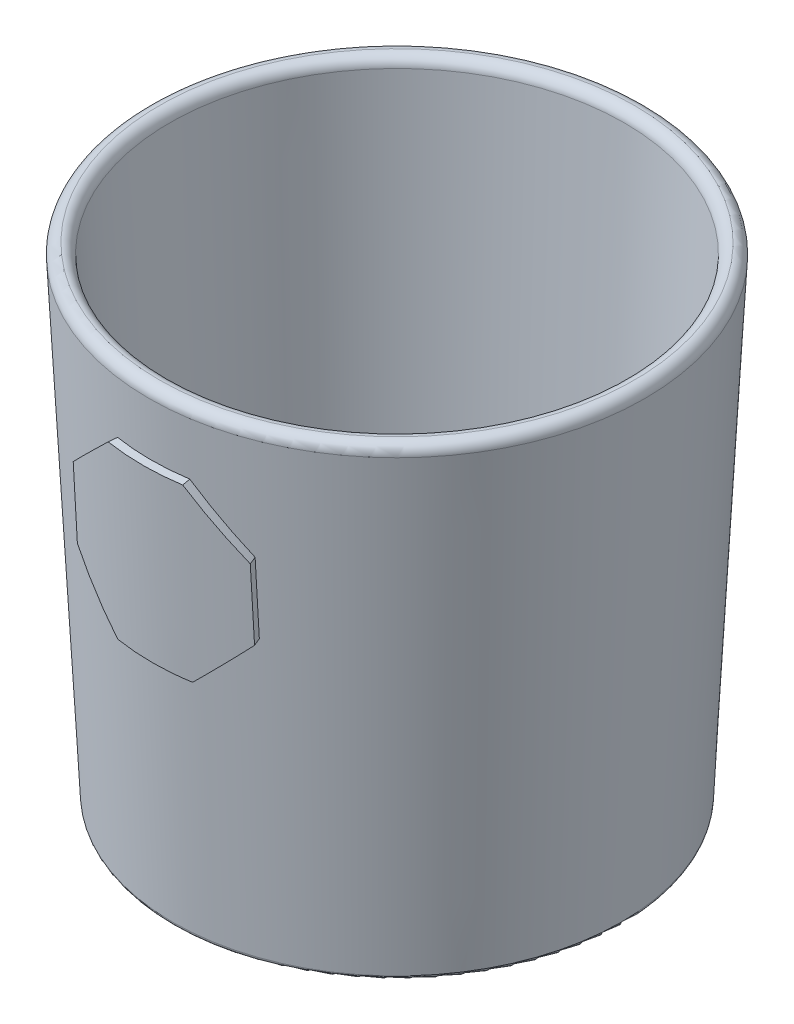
ISO-10303-21;
HEADER;
FILE_DESCRIPTION(('STEP AP214'),'2;1');
FILE_NAME('part.step','',(''),(''),'','','');
FILE_SCHEMA(('AUTOMOTIVE_DESIGN { 1 0 10303 214 1 1 1 1 }'));
ENDSEC;
DATA;
#1=APPLICATION_CONTEXT('core data for automotive mechanical design processes');
#2=APPLICATION_PROTOCOL_DEFINITION('international standard','automotive_design',2000,#1);
#3=PRODUCT_CONTEXT('',#1,'mechanical');
#4=PRODUCT('Part','Part','',(#3));
#5=PRODUCT_RELATED_PRODUCT_CATEGORY('part','',(#4));
#6=PRODUCT_DEFINITION_FORMATION('','',#4);
#7=PRODUCT_DEFINITION_CONTEXT('part definition',#1,'design');
#8=PRODUCT_DEFINITION('design','',#6,#7);
#9=PRODUCT_DEFINITION_SHAPE('','',#8);
#10=(LENGTH_UNIT() NAMED_UNIT(*) SI_UNIT(.MILLI.,.METRE.));
#11=(NAMED_UNIT(*) PLANE_ANGLE_UNIT() SI_UNIT($,.RADIAN.));
#12=(NAMED_UNIT(*) SI_UNIT($,.STERADIAN.) SOLID_ANGLE_UNIT());
#13=UNCERTAINTY_MEASURE_WITH_UNIT(LENGTH_MEASURE(1.E-05),#10,'distance_accuracy_value','');
#14=(GEOMETRIC_REPRESENTATION_CONTEXT(3) GLOBAL_UNCERTAINTY_ASSIGNED_CONTEXT((#13)) GLOBAL_UNIT_ASSIGNED_CONTEXT((#10,
#11,#12)) REPRESENTATION_CONTEXT('',''));
#15=CARTESIAN_POINT('',(0.,0.,0.));
#16=DIRECTION('',(0.,0.,1.));
#17=DIRECTION('',(1.,0.,0.));
#18=AXIS2_PLACEMENT_3D('',#15,#16,#17);
#19=CARTESIAN_POINT('',(0.,56.,0.));
#20=DIRECTION('',(0.,1.,0.));
#21=DIRECTION('',(0.,0.,1.));
#22=AXIS2_PLACEMENT_3D('',#19,#20,#21);
#23=CONICAL_SURFACE('',#22,30.,0.05167808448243);
#24=CARTESIAN_POINT('',(-10.4123290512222,33.1545920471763,26.8715496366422));
#25=CARTESIAN_POINT('',(-10.1644345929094,32.8859867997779,26.9527051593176));
#26=CARTESIAN_POINT('',(-9.91818943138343,32.6207564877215,27.0296220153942));
#27=CARTESIAN_POINT('',(-9.55151031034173,32.2279725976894,27.1389296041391));
#28=CARTESIAN_POINT('',(-9.42973189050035,32.0978882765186,27.1743541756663));
#29=CARTESIAN_POINT('',(-9.24776142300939,31.9040272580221,27.2260103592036));
#30=CARTESIAN_POINT('',(-9.18722078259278,31.8396178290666,27.2429823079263));
#31=CARTESIAN_POINT('',(-9.09658714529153,31.7433200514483,27.2680745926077));
#32=CARTESIAN_POINT('',(-9.06640548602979,31.7112735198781,27.2763777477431));
#33=CARTESIAN_POINT('',(-9.02117770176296,31.6632828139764,27.2887416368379));
#34=CARTESIAN_POINT('',(-9.00610922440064,31.6472990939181,27.2928477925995));
#35=CARTESIAN_POINT('',(-8.98351773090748,31.6233432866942,27.2989843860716));
#36=CARTESIAN_POINT('',(-8.97598910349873,31.6153613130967,27.3010261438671));
#37=CARTESIAN_POINT('',(-8.96469897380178,31.6033932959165,27.3040831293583));
#38=CARTESIAN_POINT('',(-8.9609360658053,31.5994047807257,27.3051011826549));
#39=CARTESIAN_POINT('',(-8.95341118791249,31.5914293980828,27.3071354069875));
#40=CARTESIAN_POINT('',(-8.949174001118,31.5869389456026,27.308279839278));
#41=CARTESIAN_POINT('',(-8.73556566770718,31.3605792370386,27.3659328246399));
#42=CARTESIAN_POINT('',(-8.50616503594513,31.1186316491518,27.4253302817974));
#43=CARTESIAN_POINT('',(-8.1331278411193,30.7271047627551,27.5162545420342));
#44=CARTESIAN_POINT('',(-8.00395972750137,30.5918282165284,27.5468636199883));
#45=CARTESIAN_POINT('',(-7.80293904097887,30.3817620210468,27.5929305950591));
#46=CARTESIAN_POINT('',(-7.73472077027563,30.3105480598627,27.6083115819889));
#47=CARTESIAN_POINT('',(-7.63057239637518,30.201939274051,27.6313817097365));
#48=CARTESIAN_POINT('',(-7.59555278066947,30.1654383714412,27.6390715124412));
#49=CARTESIAN_POINT('',(-7.54256766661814,30.1102400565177,27.6506008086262));
#50=CARTESIAN_POINT('',(-7.52483001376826,30.0917661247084,27.654443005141));
#51=CARTESIAN_POINT('',(-7.48920273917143,30.0546692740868,27.6621247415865));
#52=CARTESIAN_POINT('',(-7.47178044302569,30.0365327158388,27.6658644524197));
#53=CARTESIAN_POINT('',(-7.15841999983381,29.7104085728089,27.7328038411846));
#54=CARTESIAN_POINT('',(-6.88465495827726,29.4266723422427,27.7864597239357));
#55=CARTESIAN_POINT('',(-6.50634965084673,29.0358742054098,27.8558290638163));
#56=CARTESIAN_POINT('',(-6.38563570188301,28.9114091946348,27.8770951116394));
#57=CARTESIAN_POINT('',(-6.21270108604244,28.7334132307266,27.9065292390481));
#58=CARTESIAN_POINT('',(-6.15641213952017,28.6755315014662,27.9159294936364));
#59=CARTESIAN_POINT('',(-6.07401837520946,28.5908842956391,27.9294505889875));
#60=CARTESIAN_POINT('',(-6.04689372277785,28.5630311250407,27.9338610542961));
#61=CARTESIAN_POINT('',(-6.00671730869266,28.5217952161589,27.9403364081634));
#62=CARTESIAN_POINT('',(-5.99341026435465,28.5081405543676,27.942471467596));
#63=CARTESIAN_POINT('',(-5.9735774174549,28.4877945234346,27.9456395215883));
#64=CARTESIAN_POINT('',(-5.96698775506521,28.481035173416,27.9466897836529));
#65=CARTESIAN_POINT('',(-5.95385101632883,28.4675617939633,27.9487788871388));
#66=CARTESIAN_POINT('',(-5.94802780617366,28.4615899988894,27.9497031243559));
#67=CARTESIAN_POINT('',(-5.47680097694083,27.9784057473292,28.0243088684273));
#68=CARTESIAN_POINT('',(-4.96633292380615,27.4593002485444,28.0936436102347));
#69=CARTESIAN_POINT('',(-4.40948937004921,26.8968008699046,28.1514151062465));
#70=B_SPLINE_CURVE_WITH_KNOTS('',3,(#24,#25,#26,#27,#28,#29,#30,#31,#32,#33,#34,#35,#36,#37,#38,
#39,#40,#41,#42,#43,#44,#45,#46,#47,#48,#49,#50,#51,#52,#53,#54,#55,#56,#57,#58,#59,#60,#61,#62,
#63,#64,#65,#66,#67,#68,#69),.UNSPECIFIED.,.F.,.F.,(4,2,2,2,2,2,2,2,2,2,2,2,2,2,2,2,2,2,2,2,2,2,
4),(0.,0.124999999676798,0.187499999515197,0.218749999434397,0.234374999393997,
0.242187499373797,0.246093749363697,0.248046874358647,0.249999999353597,0.374999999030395,
0.437499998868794,0.468749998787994,0.484374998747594,0.492187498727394,0.499999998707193,
0.624999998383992,0.687499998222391,0.71874999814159,0.73437499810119,0.74218749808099,
0.74609374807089,0.74999999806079,0.999999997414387),.UNSPECIFIED.);
#71=CARTESIAN_POINT('',(-4.40948937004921,26.8968008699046,28.1514151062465));
#72=VERTEX_POINT('',#71);
#73=CARTESIAN_POINT('',(-10.4123290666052,33.1545920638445,26.8715496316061));
#74=VERTEX_POINT('',#73);
#75=EDGE_CURVE('E1117',#72,#74,#70,.F.);
#76=ORIENTED_EDGE('',*,*,#75,.T.);
#77=CARTESIAN_POINT('',(-10.4450443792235,41.9123858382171,27.3443198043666));
#78=CARTESIAN_POINT('',(-10.4348549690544,38.9931212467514,27.186574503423));
#79=CARTESIAN_POINT('',(-10.4239494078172,36.073856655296,27.0289827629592));
#80=CARTESIAN_POINT('',(-10.4123290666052,33.1545920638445,26.8715496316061));
#81=B_SPLINE_CURVE_WITH_KNOTS('',3,(#77,#78,#79,#80),.UNSPECIFIED.,.F.,.F.,(4,4),(0.,1.),.UNSPECIFIED.);
#82=CARTESIAN_POINT('',(-10.4450443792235,41.9123858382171,27.3443198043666));
#83=VERTEX_POINT('',#82);
#84=EDGE_CURVE('E1110',#74,#83,#81,.F.);
#85=ORIENTED_EDGE('',*,*,#84,.T.);
#86=CARTESIAN_POINT('',(-4.47605118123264,48.042201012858,29.2478678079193));
#87=CARTESIAN_POINT('',(-4.69745219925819,47.819370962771,29.2023250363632));
#88=CARTESIAN_POINT('',(-4.93531720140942,47.5797717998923,29.1507862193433));
#89=CARTESIAN_POINT('',(-5.44314856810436,47.0670422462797,29.0332637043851));
#90=CARTESIAN_POINT('',(-5.71257623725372,46.794460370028,28.9674204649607));
#91=CARTESIAN_POINT('',(-6.2846445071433,46.2135643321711,28.8179623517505));
#92=CARTESIAN_POINT('',(-6.55279615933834,45.9404027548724,28.7433494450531));
#93=CARTESIAN_POINT('',(-6.9287329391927,45.5565900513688,28.6337364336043));
#94=CARTESIAN_POINT('',(-7.0496637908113,45.4329740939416,28.5975800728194));
#95=CARTESIAN_POINT('',(-7.22455643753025,45.2540325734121,28.5441566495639));
#96=CARTESIAN_POINT('',(-7.28177005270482,45.1954658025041,28.5264838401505));
#97=CARTESIAN_POINT('',(-7.36597313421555,45.1092362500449,28.5002053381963));
#98=CARTESIAN_POINT('',(-7.39377127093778,45.0807631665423,28.491484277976));
#99=CARTESIAN_POINT('',(-7.43506520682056,45.0384586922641,28.4784637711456));
#100=CARTESIAN_POINT('',(-7.4487626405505,45.0244247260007,28.4741337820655));
#101=CARTESIAN_POINT('',(-7.4692081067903,45.0034750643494,28.4676544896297));
#102=CARTESIAN_POINT('',(-7.47600648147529,44.9965087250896,28.465497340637));
#103=CARTESIAN_POINT('',(-7.48956969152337,44.9826098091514,28.4611883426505));
#104=CARTESIAN_POINT('',(-7.49576892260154,44.9762568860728,28.4592166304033));
#105=CARTESIAN_POINT('',(-8.4392363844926,44.0093541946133,28.1587359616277));
#106=CARTESIAN_POINT('',(-9.42456261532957,42.9906358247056,27.7938275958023));
#107=CARTESIAN_POINT('',(-10.4450443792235,41.9123858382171,27.3443198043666));
#108=B_SPLINE_CURVE_WITH_KNOTS('',3,(#86,#87,#88,#89,#90,#91,#92,#93,#94,#95,#96,#97,#98,#99,
#100,#101,#102,#103,#104,#105,#106,#107),.UNSPECIFIED.,.F.,.F.,(4,2,2,2,2,2,2,2,2,2,4),(0.,
0.124999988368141,0.249999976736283,0.374999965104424,0.437499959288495,0.468749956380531,
0.484374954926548,0.492187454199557,0.496093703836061,0.499999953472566,0.999999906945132),.UNSPECIFIED.);
#109=CARTESIAN_POINT('',(-4.47605068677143,48.0422015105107,29.2478679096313));
#110=VERTEX_POINT('',#109);
#111=EDGE_CURVE('E445',#83,#110,#108,.F.);
#112=ORIENTED_EDGE('',*,*,#111,.T.);
#113=CARTESIAN_POINT('',(4.26552623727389,48.068122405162,29.2806665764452));
#114=CARTESIAN_POINT('',(1.36625676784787,48.0371211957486,29.7014036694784));
#115=CARTESIAN_POINT('',(-1.58016764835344,48.0285620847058,29.6903358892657));
#116=CARTESIAN_POINT('',(-4.47605068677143,48.0422015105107,29.2478679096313));
#117=B_SPLINE_CURVE_WITH_KNOTS('',3,(#113,#114,#115,#116),.UNSPECIFIED.,.F.,.F.,(4,4),(0.,
0.999999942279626),.UNSPECIFIED.);
#118=CARTESIAN_POINT('',(4.26552673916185,48.0681224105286,29.2806665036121));
#119=VERTEX_POINT('',#118);
#120=EDGE_CURVE('E1439',#110,#119,#117,.F.);
#121=ORIENTED_EDGE('',*,*,#120,.T.);
#122=CARTESIAN_POINT('',(10.2834304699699,41.9755159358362,27.4089950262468));
#123=CARTESIAN_POINT('',(9.79518420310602,42.4833742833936,27.6202339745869));
#124=CARTESIAN_POINT('',(9.30324515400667,42.9904577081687,27.8173617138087));
#125=CARTESIAN_POINT('',(8.56111307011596,43.7499237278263,28.0920050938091));
#126=CARTESIAN_POINT('',(8.3130315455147,44.0028856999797,28.1800456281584));
#127=CARTESIAN_POINT('',(7.94001391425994,44.3820386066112,28.3068676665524));
#128=CARTESIAN_POINT('',(7.81552545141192,44.5083745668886,28.3482686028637));
#129=CARTESIAN_POINT('',(7.62858873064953,44.6978059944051,28.4090636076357));
#130=CARTESIAN_POINT('',(7.56624248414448,44.7609377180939,28.429110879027));
#131=CARTESIAN_POINT('',(7.47267456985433,44.8556171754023,28.4588556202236));
#132=CARTESIAN_POINT('',(7.44147717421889,44.8871739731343,28.4687161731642));
#133=CARTESIAN_POINT('',(7.39466925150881,44.934504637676,28.4834255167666));
#134=CARTESIAN_POINT('',(7.37906463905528,44.9502807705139,28.4883150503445));
#135=CARTESIAN_POINT('',(7.34785152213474,44.9818315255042,28.4980669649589));
#136=CARTESIAN_POINT('',(7.3316108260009,44.9982449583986,28.5031257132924));
#137=CARTESIAN_POINT('',(6.35802568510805,45.9820235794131,28.8055344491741));
#138=CARTESIAN_POINT('',(5.34054728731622,47.0002251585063,29.068241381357));
#139=CARTESIAN_POINT('',(4.26552673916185,48.0681224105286,29.2806665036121));
#140=B_SPLINE_CURVE_WITH_KNOTS('',3,(#122,#123,#124,#125,#126,#127,#128,#129,#130,#131,#132,
#133,#134,#135,#136,#137,#138,#139),.UNSPECIFIED.,.F.,.F.,(4,2,2,2,2,2,2,2,4),(0.,
0.249999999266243,0.374999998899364,0.437499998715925,0.468749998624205,0.484374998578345,
0.492187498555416,0.499999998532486,0.999999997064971),.UNSPECIFIED.);
#141=CARTESIAN_POINT('',(10.283430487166,41.9755159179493,27.4089950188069));
#142=VERTEX_POINT('',#141);
#143=EDGE_CURVE('E1440',#119,#142,#140,.F.);
#144=ORIENTED_EDGE('',*,*,#143,.T.);
#145=CARTESIAN_POINT('',(10.3019492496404,33.2185115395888,26.9175999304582));
#146=CARTESIAN_POINT('',(10.2967809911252,36.1375129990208,27.081240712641));
#147=CARTESIAN_POINT('',(10.2906088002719,39.0565144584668,27.2450423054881));
#148=CARTESIAN_POINT('',(10.283430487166,41.9755159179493,27.4089950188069));
#149=B_SPLINE_CURVE_WITH_KNOTS('',3,(#145,#146,#147,#148),.UNSPECIFIED.,.F.,.F.,(4,4),(0.,
0.999999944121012),.UNSPECIFIED.);
#150=CARTESIAN_POINT('',(10.3019492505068,33.2185110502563,26.9175999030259));
#151=VERTEX_POINT('',#150);
#152=EDGE_CURVE('E1446',#142,#151,#149,.F.);
#153=ORIENTED_EDGE('',*,*,#152,.T.);
#154=CARTESIAN_POINT('',(4.33041260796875,26.9235556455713,28.1650876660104));
#155=CARTESIAN_POINT('',(4.60624435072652,27.2055213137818,28.1374340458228));
#156=CARTESIAN_POINT('',(4.87107329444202,27.4770686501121,28.1068509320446));
#157=CARTESIAN_POINT('',(5.25174638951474,27.8687659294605,28.057955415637));
#158=CARTESIAN_POINT('',(5.37587623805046,27.9967275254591,28.041152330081));
#159=CARTESIAN_POINT('',(5.55792654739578,28.1847636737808,28.0153522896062));
#160=CARTESIAN_POINT('',(5.61791927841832,28.246791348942,28.0066529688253));
#161=CARTESIAN_POINT('',(5.70687230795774,28.3388563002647,27.9934745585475));
#162=CARTESIAN_POINT('',(5.73635064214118,28.3693818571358,27.9890601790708));
#163=CARTESIAN_POINT('',(5.78030914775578,28.4149260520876,27.9824086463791));
#164=CARTESIAN_POINT('',(5.7949188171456,28.4300667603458,27.9801864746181));
#165=CARTESIAN_POINT('',(5.81676857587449,28.4527167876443,27.9768460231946));
#166=CARTESIAN_POINT('',(5.82404103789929,28.4602566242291,27.9757313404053));
#167=CARTESIAN_POINT('',(5.83856438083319,28.475315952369,27.9734996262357));
#168=CARTESIAN_POINT('',(5.84638812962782,28.483429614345,27.9722941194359));
#169=CARTESIAN_POINT('',(6.06640566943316,28.7116286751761,27.9383139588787));
#170=CARTESIAN_POINT('',(6.2986158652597,28.9533104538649,27.9000234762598));
#171=CARTESIAN_POINT('',(6.67487363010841,29.3464298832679,27.8324434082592));
#172=CARTESIAN_POINT('',(6.80494849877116,29.4825691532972,27.8082224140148));
#173=CARTESIAN_POINT('',(7.00698568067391,29.6944272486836,27.7690507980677));
#174=CARTESIAN_POINT('',(7.07548543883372,29.7663214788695,27.7555200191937));
#175=CARTESIAN_POINT('',(7.1799576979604,29.876075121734,27.7344741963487));
#176=CARTESIAN_POINT('',(7.21506887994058,29.9129783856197,27.7273339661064));
#177=CARTESIAN_POINT('',(7.26816516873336,29.9688113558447,27.7164311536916));
#178=CARTESIAN_POINT('',(7.2859355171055,29.9875020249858,27.712764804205));
#179=CARTESIAN_POINT('',(7.31269827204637,30.0156575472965,27.7072165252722));
#180=CARTESIAN_POINT('',(7.32163706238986,30.0250626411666,27.7053589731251));
#181=CARTESIAN_POINT('',(7.33507203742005,30.0392001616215,27.7025603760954));
#182=CARTESIAN_POINT('',(7.33955482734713,30.0439176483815,27.701625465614));
#183=CARTESIAN_POINT('',(7.34852933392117,30.0533625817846,27.6997515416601));
#184=CARTESIAN_POINT('',(7.35341090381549,30.0585003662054,27.6987309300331));
#185=CARTESIAN_POINT('',(8.40873073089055,31.1692711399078,27.4778474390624));
#186=CARTESIAN_POINT('',(9.39078875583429,32.2212327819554,27.2110886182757));
#187=CARTESIAN_POINT('',(10.3019492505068,33.2185110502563,26.9175999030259));
#188=B_SPLINE_CURVE_WITH_KNOTS('',3,(#154,#155,#156,#157,#158,#159,#160,#161,#162,#163,#164,
#165,#166,#167,#168,#169,#170,#171,#172,#173,#174,#175,#176,#177,#178,#179,#180,#181,#182,#183,
#184,#185,#186,#187),.UNSPECIFIED.,.F.,.F.,(4,2,2,2,2,2,2,2,2,2,2,2,2,2,2,2,4),(0.,
0.12499999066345,0.187499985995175,0.218749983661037,0.234374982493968,0.242187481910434,
0.246093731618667,0.249999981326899,0.374999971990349,0.437499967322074,0.468749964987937,
0.484374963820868,0.492187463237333,0.496093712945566,0.498046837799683,0.499999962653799,
0.999999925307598),.UNSPECIFIED.);
#189=CARTESIAN_POINT('',(4.33041211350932,26.9235551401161,28.1650877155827));
#190=VERTEX_POINT('',#189);
#191=EDGE_CURVE('E978',#151,#190,#188,.F.);
#192=ORIENTED_EDGE('',*,*,#191,.T.);
#193=CARTESIAN_POINT('',(-4.40948888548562,26.8968008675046,28.1514151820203));
#194=CARTESIAN_POINT('',(-2.96581771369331,26.8896503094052,28.377169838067));
#195=CARTESIAN_POINT('',(-1.50362544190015,26.8883048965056,28.4921400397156));
#196=CARTESIAN_POINT('',(1.42362783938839,26.8972243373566,28.4967104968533));
#197=CARTESIAN_POINT('',(2.8849041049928,26.9074797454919,28.3864948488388));
#198=CARTESIAN_POINT('',(4.33041211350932,26.9235551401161,28.1650877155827));
#199=B_SPLINE_CURVE_WITH_KNOTS('',3,(#193,#194,#195,#196,#197,#198),.UNSPECIFIED.,.F.,.F.,(4,2,
4),(0.,0.499999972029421,0.999999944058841),.UNSPECIFIED.);
#200=EDGE_CURVE('E1121',#190,#72,#199,.F.);
#201=ORIENTED_EDGE('',*,*,#200,.T.);
#202=EDGE_LOOP('',(#76,#85,#112,#121,#144,#153,#192,#201));
#203=FACE_BOUND('',#202,.T.);
#204=CARTESIAN_POINT('',(0.,-1.52582754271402,0.));
#205=DIRECTION('',(0.,-1.,0.));
#206=DIRECTION('',(0.,0.,-1.));
#207=AXIS2_PLACEMENT_3D('',#204,#205,#206);
#208=CIRCLE('',#207,27.0245261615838);
#209=CARTESIAN_POINT('',(0.,-1.52582754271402,-27.0245261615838));
#210=VERTEX_POINT('',#209);
#211=EDGE_CURVE('E13',#210,#210,#208,.F.);
#212=ORIENTED_EDGE('',*,*,#211,.T.);
#213=EDGE_LOOP('',(#212));
#214=FACE_BOUND('',#213,.T.);
#215=CARTESIAN_POINT('',(0.,54.685431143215,0.));
#216=DIRECTION('',(0.,-1.,0.));
#217=DIRECTION('',(0.,0.,-1.));
#218=AXIS2_PLACEMENT_3D('',#215,#216,#217);
#219=CIRCLE('',#218,29.9320050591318);
#220=CARTESIAN_POINT('',(0.,54.685431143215,-29.9320050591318));
#221=VERTEX_POINT('',#220);
#222=EDGE_CURVE('E1546',#221,#221,#219,.T.);
#223=ORIENTED_EDGE('',*,*,#222,.T.);
#224=EDGE_LOOP('',(#223));
#225=FACE_BOUND('',#224,.T.);
#226=CARTESIAN_POINT('',(-4.44385011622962,48.0512534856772,-29.2532512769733));
#227=CARTESIAN_POINT('',(-2.99778725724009,48.0398296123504,-29.4723244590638));
#228=CARTESIAN_POINT('',(-1.53544830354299,48.0340016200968,-29.5842814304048));
#229=CARTESIAN_POINT('',(1.39001781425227,48.0335371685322,-29.5914470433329));
#230=CARTESIAN_POINT('',(2.8531114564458,48.0389007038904,-29.4866554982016));
#231=CARTESIAN_POINT('',(4.30066606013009,48.0498601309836,-29.274571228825));
#232=B_SPLINE_CURVE_WITH_KNOTS('',3,(#226,#227,#228,#229,#230,#231),.UNSPECIFIED.,.F.,.F.,(4,2,
4),(0.,0.499999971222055,0.999999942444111),.UNSPECIFIED.);
#233=CARTESIAN_POINT('',(-4.44385011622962,48.0512534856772,-29.2532512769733));
#234=VERTEX_POINT('',#233);
#235=CARTESIAN_POINT('',(4.3006665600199,48.0498601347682,-29.274571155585));
#236=VERTEX_POINT('',#235);
#237=EDGE_CURVE('E1218',#234,#236,#232,.T.);
#238=ORIENTED_EDGE('',*,*,#237,.F.);
#239=CARTESIAN_POINT('',(-10.4342800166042,41.9421103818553,-27.3500747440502));
#240=CARTESIAN_POINT('',(-9.43915692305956,42.9857279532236,-27.7874976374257));
#241=CARTESIAN_POINT('',(-8.45153223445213,44.0009273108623,-28.1558406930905));
#242=CARTESIAN_POINT('',(-7.4663423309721,45.0032476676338,-28.4683976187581));
#243=CARTESIAN_POINT('',(-7.45227184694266,45.0175607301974,-28.4728491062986));
#244=CARTESIAN_POINT('',(-7.4229879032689,45.0473455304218,-28.4820896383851));
#245=CARTESIAN_POINT('',(-7.40832702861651,45.0622550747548,-28.4867033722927));
#246=CARTESIAN_POINT('',(-7.36428767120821,45.1070351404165,-28.5005247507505));
#247=CARTESIAN_POINT('',(-7.33485245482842,45.1369570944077,-28.5097125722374));
#248=CARTESIAN_POINT('',(-7.24631967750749,45.2269286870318,-28.5371949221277));
#249=CARTESIAN_POINT('',(-7.18699498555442,45.2871840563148,-28.5554083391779));
#250=CARTESIAN_POINT('',(-7.00811093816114,45.4687730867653,-28.6097094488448));
#251=CARTESIAN_POINT('',(-6.88764156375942,45.5909296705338,-28.6454580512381));
#252=CARTESIAN_POINT('',(-6.52258347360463,45.9606911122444,-28.7512280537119));
#253=CARTESIAN_POINT('',(-6.27434396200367,46.2115876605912,-28.819774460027));
#254=CARTESIAN_POINT('',(-5.51497198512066,46.9774440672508,-29.0185283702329));
#255=CARTESIAN_POINT('',(-4.98917486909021,47.5055662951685,-29.1418621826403));
#256=CARTESIAN_POINT('',(-4.44385061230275,48.0512529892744,-29.2532511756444));
#257=B_SPLINE_CURVE_WITH_KNOTS('',3,(#239,#240,#241,#242,#243,#244,#245,#246,#247,#248,#249,
#250,#251,#252,#253,#254,#255,#256),.UNSPECIFIED.,.F.,.F.,(4,2,2,2,2,2,2,2,4),(0.,
0.49999996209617,0.507812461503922,0.515624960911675,0.53124995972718,0.562499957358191,
0.624999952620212,0.749999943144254,0.999999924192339),.UNSPECIFIED.);
#258=CARTESIAN_POINT('',(-10.4342800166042,41.9421103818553,-27.3500747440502));
#259=VERTEX_POINT('',#258);
#260=EDGE_CURVE('E1219',#259,#234,#257,.T.);
#261=ORIENTED_EDGE('',*,*,#260,.F.);
#262=CARTESIAN_POINT('',(-10.4279304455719,33.1864808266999,-26.8672684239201));
#263=CARTESIAN_POINT('',(-10.4290185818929,35.1164210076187,-26.9739258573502));
#264=CARTESIAN_POINT('',(-10.4294146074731,36.4089714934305,-27.0454167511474));
#265=CARTESIAN_POINT('',(-10.4296928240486,37.2279230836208,-27.0907019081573));
#266=CARTESIAN_POINT('',(-10.4297351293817,37.351876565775,-27.0975554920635));
#267=CARTESIAN_POINT('',(-10.4297832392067,37.4780515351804,-27.1045298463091));
#268=CARTESIAN_POINT('',(-10.429796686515,37.5101506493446,-27.1063036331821));
#269=CARTESIAN_POINT('',(-10.4298132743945,37.5433605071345,-27.1081377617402));
#270=CARTESIAN_POINT('',(-10.4298182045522,37.5519406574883,-27.1086113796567));
#271=CARTESIAN_POINT('',(-10.4298268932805,37.5641213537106,-27.1092830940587));
#272=CARTESIAN_POINT('',(-10.4298305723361,37.5673852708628,-27.1094625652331));
#273=CARTESIAN_POINT('',(-10.4298654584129,37.6038402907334,-27.1114694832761));
#274=CARTESIAN_POINT('',(-10.4298970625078,37.6362561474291,-27.113253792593));
#275=CARTESIAN_POINT('',(-10.4300580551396,37.7983924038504,-27.122177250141));
#276=CARTESIAN_POINT('',(-10.4301963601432,37.9282837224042,-27.1293221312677));
#277=CARTESIAN_POINT('',(-10.4306398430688,38.3185046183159,-27.150775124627));
#278=CARTESIAN_POINT('',(-10.4309735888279,38.5793811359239,-27.1651015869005));
#279=CARTESIAN_POINT('',(-10.4317174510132,39.102592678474,-27.1938034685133));
#280=CARTESIAN_POINT('',(-10.4321275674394,39.364927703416,-27.2081788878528));
#281=CARTESIAN_POINT('',(-10.4326320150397,39.660875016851,-27.2243787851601));
#282=CARTESIAN_POINT('',(-10.4326886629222,39.6937694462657,-27.2261791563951));
#283=CARTESIAN_POINT('',(-10.4327745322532,39.7431281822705,-27.2288802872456));
#284=CARTESIAN_POINT('',(-10.432803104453,39.7587909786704,-27.229736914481));
#285=CARTESIAN_POINT('',(-10.4328622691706,39.796891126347,-27.2318246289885));
#286=CARTESIAN_POINT('',(-10.4328927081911,39.8187445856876,-27.233023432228));
#287=CARTESIAN_POINT('',(-10.4330490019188,39.9420288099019,-27.2397922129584));
#288=CARTESIAN_POINT('',(-10.4331873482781,40.0855103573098,-27.247686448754));
#289=CARTESIAN_POINT('',(-10.4336305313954,40.6505175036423,-27.2788089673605));
#290=CARTESIAN_POINT('',(-10.4339660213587,41.2066056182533,-27.3094766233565));
#291=CARTESIAN_POINT('',(-10.4342800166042,41.9421103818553,-27.3500747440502));
#292=B_SPLINE_CURVE_WITH_KNOTS('',3,(#262,#263,#264,#265,#266,#267,#268,#269,#270,#271,#272,
#273,#274,#275,#276,#277,#278,#279,#280,#281,#282,#283,#284,#285,#286,#287,#288,#289,#290,#291),
.UNSPECIFIED.,.F.,.F.,(4,2,2,2,2,2,2,2,2,2,2,2,2,2,4),(0.,0.0625,0.078125,0.0859375,0.08984375,
0.09375,0.125,0.25,0.5,0.75,0.78125,0.796875,0.8125,0.875,1.),.UNSPECIFIED.);
#293=CARTESIAN_POINT('',(-10.4279304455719,33.1864808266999,-26.8672684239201));
#294=VERTEX_POINT('',#293);
#295=EDGE_CURVE('E436',#294,#259,#292,.T.);
#296=ORIENTED_EDGE('',*,*,#295,.F.);
#297=CARTESIAN_POINT('',(-4.4440838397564,26.9097456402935,-28.1466524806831));
#298=CARTESIAN_POINT('',(-6.44876883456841,28.9507994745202,-27.9370117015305));
#299=CARTESIAN_POINT('',(-8.45908382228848,31.0429352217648,-27.5125009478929));
#300=CARTESIAN_POINT('',(-10.4279304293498,33.1864808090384,-26.8672684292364));
#301=B_SPLINE_CURVE_WITH_KNOTS('',3,(#297,#298,#299,#300),.UNSPECIFIED.,.F.,.F.,(4,4),(0.,
0.999999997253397),.UNSPECIFIED.);
#302=CARTESIAN_POINT('',(-4.4440838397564,26.9097456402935,-28.1466524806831));
#303=VERTEX_POINT('',#302);
#304=EDGE_CURVE('E544',#303,#294,#301,.T.);
#305=ORIENTED_EDGE('',*,*,#304,.F.);
#306=CARTESIAN_POINT('',(4.29946723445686,26.9083382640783,-28.169031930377));
#307=CARTESIAN_POINT('',(2.85284657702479,26.8969035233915,-28.3892327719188));
#308=CARTESIAN_POINT('',(1.38946770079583,26.8913035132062,-28.4980577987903));
#309=CARTESIAN_POINT('',(-1.53651265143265,26.8917726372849,-28.490532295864));
#310=CARTESIAN_POINT('',(-2.99907513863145,26.8978417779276,-28.3741819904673));
#311=CARTESIAN_POINT('',(-4.44408335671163,26.9097456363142,-28.1466525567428));
#312=B_SPLINE_CURVE_WITH_KNOTS('',3,(#306,#307,#308,#309,#310,#311),.UNSPECIFIED.,.F.,.F.,(4,2,
4),(0.,0.499999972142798,0.999999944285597),.UNSPECIFIED.);
#313=CARTESIAN_POINT('',(4.29946723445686,26.9083382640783,-28.169031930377));
#314=VERTEX_POINT('',#313);
#315=EDGE_CURVE('E1391',#314,#303,#312,.T.);
#316=ORIENTED_EDGE('',*,*,#315,.F.);
#317=CARTESIAN_POINT('',(10.2914305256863,33.1829764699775,-26.9196555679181));
#318=CARTESIAN_POINT('',(9.33362708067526,32.1423939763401,-27.2282030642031));
#319=CARTESIAN_POINT('',(8.34714803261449,31.0939679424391,-27.4909600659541));
#320=CARTESIAN_POINT('',(7.32081753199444,30.0212397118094,-27.7053741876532));
#321=CARTESIAN_POINT('',(7.30388285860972,30.0035438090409,-27.7088972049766));
#322=CARTESIAN_POINT('',(7.27118227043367,29.9693822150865,-27.7156694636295));
#323=CARTESIAN_POINT('',(7.25483991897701,29.9523140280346,-27.7190391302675));
#324=CARTESIAN_POINT('',(7.20583679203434,29.9011472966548,-27.7290988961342));
#325=CARTESIAN_POINT('',(7.1731999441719,29.8670865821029,-27.7357397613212));
#326=CARTESIAN_POINT('',(7.07538590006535,29.7650557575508,-27.7554666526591));
#327=CARTESIAN_POINT('',(7.01030520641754,29.6972369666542,-27.7683569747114));
#328=CARTESIAN_POINT('',(6.81545533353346,29.4943858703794,-27.806254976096));
#329=CARTESIAN_POINT('',(6.68607841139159,29.3599588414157,-27.8304896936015));
#330=CARTESIAN_POINT('',(6.29956444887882,28.9590988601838,-27.9001807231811));
#331=CARTESIAN_POINT('',(6.04404497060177,28.6950870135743,-27.9426239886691));
#332=CARTESIAN_POINT('',(5.28431079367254,27.9127358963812,-28.0585291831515));
#333=CARTESIAN_POINT('',(4.78692888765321,27.4040782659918,-28.1205688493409));
#334=CARTESIAN_POINT('',(4.29946772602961,26.9083387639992,-28.1690318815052));
#335=B_SPLINE_CURVE_WITH_KNOTS('',3,(#317,#318,#319,#320,#321,#322,#323,#324,#325,#326,#327,
#328,#329,#330,#331,#332,#333,#334),.UNSPECIFIED.,.F.,.F.,(4,2,2,2,2,2,2,2,4),(0.,
0.499999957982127,0.507812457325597,0.515624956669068,0.531249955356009,0.562499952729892,
0.624999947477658,0.74999993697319,0.999999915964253),.UNSPECIFIED.);
#336=CARTESIAN_POINT('',(10.2914305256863,33.1829764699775,-26.9196555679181));
#337=VERTEX_POINT('',#336);
#338=EDGE_CURVE('E1390',#337,#314,#335,.T.);
#339=ORIENTED_EDGE('',*,*,#338,.F.);
#340=CARTESIAN_POINT('',(10.2981625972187,41.9386583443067,-27.4014266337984));
#341=CARTESIAN_POINT('',(10.2977318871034,41.0994920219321,-27.3552191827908));
#342=CARTESIAN_POINT('',(10.2970457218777,40.257322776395,-27.308928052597));
#343=CARTESIAN_POINT('',(10.2956352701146,38.9895645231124,-27.2393664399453));
#344=CARTESIAN_POINT('',(10.2951015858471,38.5662277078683,-27.2161584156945));
#345=CARTESIAN_POINT('',(10.2943552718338,38.0361182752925,-27.1871224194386));
#346=CARTESIAN_POINT('',(10.2942020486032,37.9300494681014,-27.181313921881));
#347=CARTESIAN_POINT('',(10.2939662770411,37.7708758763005,-27.1725992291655));
#348=CARTESIAN_POINT('',(10.2938866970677,37.7178062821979,-27.1696940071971));
#349=CARTESIAN_POINT('',(10.2937658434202,37.6381842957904,-27.1653356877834));
#350=CARTESIAN_POINT('',(10.2937253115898,37.6116407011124,-27.1638828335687));
#351=CARTESIAN_POINT('',(10.2936641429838,37.5718209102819,-27.1617034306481));
#352=CARTESIAN_POINT('',(10.2936436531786,37.5593849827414,-27.1610233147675));
#353=CARTESIAN_POINT('',(10.2936028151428,37.5288023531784,-27.1593471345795));
#354=CARTESIAN_POINT('',(10.2935824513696,37.5109223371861,-27.1583658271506));
#355=CARTESIAN_POINT('',(10.2933994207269,37.3267038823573,-27.1482451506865));
#356=CARTESIAN_POINT('',(10.2932412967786,36.9972772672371,-27.1300829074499));
#357=CARTESIAN_POINT('',(10.2929600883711,36.2546220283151,-27.0890995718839));
#358=CARTESIAN_POINT('',(10.2928584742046,35.9656510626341,-27.0731485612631));
#359=CARTESIAN_POINT('',(10.2927122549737,35.5526633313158,-27.0503491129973));
#360=CARTESIAN_POINT('',(10.2926820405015,35.4674770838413,-27.0456461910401));
#361=CARTESIAN_POINT('',(10.292642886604,35.3577583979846,-27.0395887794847));
#362=CARTESIAN_POINT('',(10.2926339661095,35.3338613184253,-27.0382695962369));
#363=CARTESIAN_POINT('',(10.2926115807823,35.2781983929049,-27.0351974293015));
#364=CARTESIAN_POINT('',(10.2925984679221,35.2470484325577,-27.0334783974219));
#365=CARTESIAN_POINT('',(10.292553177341,35.1436430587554,-27.0277724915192));
#366=CARTESIAN_POINT('',(10.2925150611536,35.0614321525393,-27.0232368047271));
#367=CARTESIAN_POINT('',(10.2922815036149,34.5840076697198,-26.9969002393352));
#368=CARTESIAN_POINT('',(10.2919614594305,33.9896842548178,-26.9641241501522));
#369=CARTESIAN_POINT('',(10.2914305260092,33.1829769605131,-26.9196555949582));
#370=B_SPLINE_CURVE_WITH_KNOTS('',3,(#340,#341,#342,#343,#344,#345,#346,#347,#348,#349,#350,
#351,#352,#353,#354,#355,#356,#357,#358,#359,#360,#361,#362,#363,#364,#365,#366,#367,#368,#369),
.UNSPECIFIED.,.F.,.F.,(4,2,2,2,2,2,2,2,2,2,2,2,2,2,4),(0.,0.499999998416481,0.749999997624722,
0.812499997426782,0.843749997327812,0.859374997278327,0.867187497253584,0.874999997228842,
0.937499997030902,0.968749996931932,0.97656249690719,0.978515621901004,0.980468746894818,
0.984374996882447,0.999999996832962),.UNSPECIFIED.);
#371=CARTESIAN_POINT('',(10.2981625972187,41.9386583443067,-27.4014266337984));
#372=VERTEX_POINT('',#371);
#373=EDGE_CURVE('E1222',#372,#337,#370,.T.);
#374=ORIENTED_EDGE('',*,*,#373,.F.);
#375=CARTESIAN_POINT('',(4.3006665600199,48.0498601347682,-29.274571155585));
#376=CARTESIAN_POINT('',(5.39064161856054,46.9592046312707,-29.0574264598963));
#377=CARTESIAN_POINT('',(6.40386598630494,45.9377522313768,-28.7922692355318));
#378=CARTESIAN_POINT('',(7.35556580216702,44.9704305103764,-28.4954672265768));
#379=CARTESIAN_POINT('',(7.37126528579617,44.9544707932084,-28.4905577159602));
#380=CARTESIAN_POINT('',(7.40161955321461,44.9236080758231,-28.4810376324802));
#381=CARTESIAN_POINT('',(7.41680109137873,44.9081696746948,-28.4762627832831));
#382=CARTESIAN_POINT('',(7.46235881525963,44.8618333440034,-28.461893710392));
#383=CARTESIAN_POINT('',(7.49274811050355,44.8309142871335,-28.4522549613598));
#384=CARTESIAN_POINT('',(7.58396759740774,44.7380726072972,-28.4231597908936));
#385=CARTESIAN_POINT('',(7.64484939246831,44.6760654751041,-28.4035244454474));
#386=CARTESIAN_POINT('',(7.82769441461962,44.4897060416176,-28.343896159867));
#387=CARTESIAN_POINT('',(7.94985731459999,44.3650157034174,-28.3031809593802));
#388=CARTESIAN_POINT('',(8.31708918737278,43.989592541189,-28.1780942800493));
#389=CARTESIAN_POINT('',(8.56290191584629,43.7375075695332,-28.0907815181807));
#390=CARTESIAN_POINT('',(9.30284986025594,42.9758440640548,-27.8166687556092));
#391=CARTESIAN_POINT('',(9.79950190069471,42.4608595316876,-27.6176911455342));
#392=CARTESIAN_POINT('',(10.2981625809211,41.9386583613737,-27.4014266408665));
#393=B_SPLINE_CURVE_WITH_KNOTS('',3,(#375,#376,#377,#378,#379,#380,#381,#382,#383,#384,#385,
#386,#387,#388,#389,#390,#391,#392),.UNSPECIFIED.,.F.,.F.,(4,2,2,2,2,2,2,2,4),(0.,
0.499999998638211,0.507812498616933,0.515624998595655,0.531249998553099,0.562499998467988,
0.624999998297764,0.749999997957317,0.999999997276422),.UNSPECIFIED.);
#394=EDGE_CURVE('E1221',#236,#372,#393,.T.);
#395=ORIENTED_EDGE('',*,*,#394,.F.);
#396=EDGE_LOOP('',(#238,#261,#296,#305,#316,#339,#374,#395));
#397=FACE_BOUND('',#396,.T.);
#398=ADVANCED_FACE('F417',(#203,#214,#225,#397),#23,.T.);
#399=CARTESIAN_POINT('',(-1.45753064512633,0.,0.));
#400=DIRECTION('',(0.,1.,0.));
#401=DIRECTION('',(0.,0.,1.));
#402=AXIS2_PLACEMENT_3D('',#399,#400,#401);
#403=PLANE('',#402);
#404=CARTESIAN_POINT('',(0.,0.,0.));
#405=DIRECTION('',(0.,-1.,0.));
#406=DIRECTION('',(0.,0.,-1.));
#407=AXIS2_PLACEMENT_3D('',#404,#405,#406);
#408=CIRCLE('',#407,1.45753064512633);
#409=CARTESIAN_POINT('',(0.,0.,-1.45753064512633));
#410=VERTEX_POINT('',#409);
#411=EDGE_CURVE('E1554',#410,#410,#408,.T.);
#412=ORIENTED_EDGE('',*,*,#411,.T.);
#413=EDGE_LOOP('',(#412));
#414=FACE_BOUND('',#413,.T.);
#415=ADVANCED_FACE('F1142',(#414),#403,.F.);
#416=CARTESIAN_POINT('',(-27.,-2.,0.));
#417=DIRECTION('',(0.,1.,0.));
#418=DIRECTION('',(0.,0.,1.));
#419=AXIS2_PLACEMENT_3D('',#416,#417,#418);
#420=PLANE('',#419);
#421=CARTESIAN_POINT('',(0.,-2.,0.));
#422=DIRECTION('',(0.,1.,0.));
#423=DIRECTION('',(0.,0.,1.));
#424=AXIS2_PLACEMENT_3D('',#421,#422,#423);
#425=CIRCLE('',#424,26.5251936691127);
#426=CARTESIAN_POINT('',(0.,-2.,26.5251936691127));
#427=VERTEX_POINT('',#426);
#428=EDGE_CURVE('E428',#427,#427,#425,.F.);
#429=ORIENTED_EDGE('',*,*,#428,.T.);
#430=EDGE_LOOP('',(#429));
#431=FACE_BOUND('',#430,.T.);
#432=CARTESIAN_POINT('',(0.,-2.,0.));
#433=DIRECTION('',(0.,-1.,0.));
#434=DIRECTION('',(0.,0.,-1.));
#435=AXIS2_PLACEMENT_3D('',#432,#433,#434);
#436=CIRCLE('',#435,25.);
#437=CARTESIAN_POINT('',(0.,-2.,-25.));
#438=VERTEX_POINT('',#437);
#439=EDGE_CURVE('E1550',#438,#438,#436,.T.);
#440=ORIENTED_EDGE('',*,*,#439,.F.);
#441=EDGE_LOOP('',(#440));
#442=FACE_BOUND('',#441,.T.);
#443=ADVANCED_FACE('F1143',(#431,#442),#420,.F.);
#444=CARTESIAN_POINT('',(-25.,-2.,0.));
#445=CARTESIAN_POINT('',(-17.216673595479,0.0866103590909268,0.));
#446=CARTESIAN_POINT('',(-9.33501818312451,-0.00281261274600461,0.));
#447=CARTESIAN_POINT('',(-1.45753064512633,0.,0.));
#448=B_SPLINE_CURVE_WITH_KNOTS('',3,(#444,#445,#446,#447),.UNSPECIFIED.,.F.,.F.,(4,4),(0.,1.),.UNSPECIFIED.);
#449=CARTESIAN_POINT('',(0.,0.,0.));
#450=DIRECTION('',(0.,-1.,0.));
#451=AXIS1_PLACEMENT('',#449,#450);
#452=SURFACE_OF_REVOLUTION('',#448,#451);
#453=ORIENTED_EDGE('',*,*,#411,.F.);
#454=EDGE_LOOP('',(#453));
#455=FACE_BOUND('',#454,.T.);
#456=ORIENTED_EDGE('',*,*,#439,.T.);
#457=EDGE_LOOP('',(#456));
#458=FACE_BOUND('',#457,.T.);
#459=ADVANCED_FACE('F1084',(#455,#458),#452,.T.);
#460=CARTESIAN_POINT('',(-25.,-2.,0.));
#461=CARTESIAN_POINT('',(-17.216673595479,0.0866103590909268,0.));
#462=CARTESIAN_POINT('',(-9.33501818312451,-0.00281261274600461,0.));
#463=CARTESIAN_POINT('',(-1.45753064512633,0.,0.));
#464=B_SPLINE_CURVE_WITH_KNOTS('',3,(#460,#461,#462,#463),.UNSPECIFIED.,.F.,.F.,(4,4),(0.,1.),.UNSPECIFIED.);
#465=CARTESIAN_POINT('',(0.,0.,0.));
#466=DIRECTION('',(0.,-1.,0.));
#467=AXIS1_PLACEMENT('',#465,#466);
#468=SURFACE_OF_REVOLUTION('',#464,#467);
#469=OFFSET_SURFACE('',#468,-2.5,.F.);
#470=CARTESIAN_POINT('',(0.,2.49999984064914,-1.45842325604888));
#471=CARTESIAN_POINT('',(0.0238634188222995,2.49999984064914,-1.45842376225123));
#472=CARTESIAN_POINT('',(0.0477267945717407,2.49999984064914,-1.45783757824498));
#473=CARTESIAN_POINT('',(0.0953960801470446,2.49999984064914,-1.45549546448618));
#474=CARTESIAN_POINT('',(0.119201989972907,2.49999984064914,-1.45373953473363));
#475=CARTESIAN_POINT('',(0.166698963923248,2.49999984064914,-1.44906156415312));
#476=CARTESIAN_POINT('',(0.190390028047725,2.49999984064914,-1.44613952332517));
#477=CARTESIAN_POINT('',(0.237600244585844,2.49999984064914,-1.43913652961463));
#478=CARTESIAN_POINT('',(0.261119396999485,2.49999984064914,-1.43505557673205));
#479=CARTESIAN_POINT('',(0.307929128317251,2.49999984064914,-1.42574454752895));
#480=CARTESIAN_POINT('',(0.331219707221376,2.49999984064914,-1.42051447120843));
#481=CARTESIAN_POINT('',(0.377516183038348,2.49999984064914,-1.4089178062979));
#482=CARTESIAN_POINT('',(0.400522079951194,2.49999984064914,-1.4025512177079));
#483=CARTESIAN_POINT('',(0.446193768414,2.49999984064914,-1.38869686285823));
#484=CARTESIAN_POINT('',(0.468859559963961,2.49999984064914,-1.38120909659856));
#485=CARTESIAN_POINT('',(0.51379643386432,2.49999984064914,-1.36513042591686));
#486=CARTESIAN_POINT('',(0.536067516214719,2.49999984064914,-1.35653952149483));
#487=CARTESIAN_POINT('',(0.580161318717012,2.49999984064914,-1.33827527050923));
#488=CARTESIAN_POINT('',(0.601984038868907,2.49999984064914,-1.32860192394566));
#489=CARTESIAN_POINT('',(0.645128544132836,2.49999984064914,-1.30819609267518));
#490=CARTESIAN_POINT('',(0.66645032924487,2.49999984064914,-1.29746360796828));
#491=CARTESIAN_POINT('',(0.708541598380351,2.49999984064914,-1.27496535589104));
#492=CARTESIAN_POINT('',(0.729311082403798,2.49999984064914,-1.26319958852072));
#493=CARTESIAN_POINT('',(0.770247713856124,2.49999984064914,-1.23866311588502));
#494=CARTESIAN_POINT('',(0.790414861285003,2.49999984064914,-1.22589241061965));
#495=CARTESIAN_POINT('',(0.830098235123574,2.49999984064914,-1.1993768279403));
#496=CARTESIAN_POINT('',(0.849614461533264,2.49999984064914,-1.18563195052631));
#497=CARTESIAN_POINT('',(0.887948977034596,2.49999984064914,-1.15720113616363));
#498=CARTESIAN_POINT('',(0.906767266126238,2.49999984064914,-1.14251519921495));
#499=CARTESIAN_POINT('',(0.943660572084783,2.49999984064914,-1.11223764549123));
#500=CARTESIAN_POINT('',(0.961735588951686,2.49999984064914,-1.09664602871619));
#501=CARTESIAN_POINT('',(0.997098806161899,2.49999984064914,-1.0645946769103));
#502=CARTESIAN_POINT('',(1.01438700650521,2.49999984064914,-1.04813494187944));
#503=CARTESIAN_POINT('',(1.04813494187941,2.49999984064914,-1.01438700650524));
#504=CARTESIAN_POINT('',(1.0645946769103,2.49999984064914,-0.9970988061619));
#505=CARTESIAN_POINT('',(1.09664602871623,2.49999984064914,-0.961735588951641));
#506=CARTESIAN_POINT('',(1.11223764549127,2.49999984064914,-0.943660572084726));
#507=CARTESIAN_POINT('',(1.14251519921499,2.49999984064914,-0.906767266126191));
#508=CARTESIAN_POINT('',(1.15720113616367,2.49999984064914,-0.887948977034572));
#509=CARTESIAN_POINT('',(1.18563195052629,2.49999984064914,-0.849614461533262));
#510=CARTESIAN_POINT('',(1.19937682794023,2.49999984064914,-0.83009823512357));
#511=CARTESIAN_POINT('',(1.22589241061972,2.49999984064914,-0.790414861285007));
#512=CARTESIAN_POINT('',(1.23866311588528,2.49999984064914,-0.770247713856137));
#513=CARTESIAN_POINT('',(1.26319958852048,2.49999984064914,-0.729311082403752));
#514=CARTESIAN_POINT('',(1.27496535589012,2.49999984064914,-0.708541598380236));
#515=CARTESIAN_POINT('',(1.29746360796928,2.49999984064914,-0.666450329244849));
#516=CARTESIAN_POINT('',(1.3081960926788,2.49999984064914,-0.645128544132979));
#517=CARTESIAN_POINT('',(1.32860192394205,2.49999984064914,-0.601984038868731));
#518=CARTESIAN_POINT('',(1.33827527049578,2.49999984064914,-0.580161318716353));
#519=CARTESIAN_POINT('',(1.35653952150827,2.49999984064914,-0.536067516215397));
#520=CARTESIAN_POINT('',(1.36513042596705,2.49999984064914,-0.513796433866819));
#521=CARTESIAN_POINT('',(1.38120909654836,2.49999984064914,-0.468859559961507));
#522=CARTESIAN_POINT('',(1.3886968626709,2.49999984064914,-0.446193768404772));
#523=CARTESIAN_POINT('',(1.40255121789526,2.49999984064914,-0.400522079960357));
#524=CARTESIAN_POINT('',(1.40891780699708,2.49999984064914,-0.377516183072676));
#525=CARTESIAN_POINT('',(1.42051447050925,2.49999984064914,-0.331219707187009));
#526=CARTESIAN_POINT('',(1.4257445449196,2.49999984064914,-0.307929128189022));
#527=CARTESIAN_POINT('',(1.43505557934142,2.49999984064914,-0.261119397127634));
#528=CARTESIAN_POINT('',(1.4391365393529,2.49999984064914,-0.237600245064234));
#529=CARTESIAN_POINT('',(1.44613951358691,2.49999984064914,-0.190390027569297));
#530=CARTESIAN_POINT('',(1.44906152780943,2.49999984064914,-0.166698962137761));
#531=CARTESIAN_POINT('',(1.45373957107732,2.49999984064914,-0.119201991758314));
#532=CARTESIAN_POINT('',(1.45549560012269,2.49999984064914,-0.0953960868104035));
#533=CARTESIAN_POINT('',(1.45783744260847,2.49999984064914,-0.0477267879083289));
#534=CARTESIAN_POINT('',(1.45842325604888,2.49999984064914,-0.0238633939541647));
#535=CARTESIAN_POINT('',(1.45842325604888,2.49999984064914,0.0238633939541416));
#536=CARTESIAN_POINT('',(1.45783744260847,2.49999984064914,0.0477267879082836));
#537=CARTESIAN_POINT('',(1.45549560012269,2.49999984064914,0.0953960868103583));
#538=CARTESIAN_POINT('',(1.45373957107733,2.49999984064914,0.119201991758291));
#539=CARTESIAN_POINT('',(1.44906152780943,2.49999984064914,0.16669896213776));
#540=CARTESIAN_POINT('',(1.44613951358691,2.49999984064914,0.190390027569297));
#541=CARTESIAN_POINT('',(1.4391365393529,2.49999984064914,0.237600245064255));
#542=CARTESIAN_POINT('',(1.43505557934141,2.49999984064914,0.261119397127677));
#543=CARTESIAN_POINT('',(1.42574454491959,2.49999984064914,0.307929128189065));
#544=CARTESIAN_POINT('',(1.42051447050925,2.49999984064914,0.331219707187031));
#545=CARTESIAN_POINT('',(1.40891780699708,2.49999984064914,0.377516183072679));
#546=CARTESIAN_POINT('',(1.40255121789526,2.49999984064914,0.400522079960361));
#547=CARTESIAN_POINT('',(1.3886968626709,2.49999984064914,0.446193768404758));
#548=CARTESIAN_POINT('',(1.38120909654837,2.49999984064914,0.468859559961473));
#549=CARTESIAN_POINT('',(1.36513042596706,2.49999984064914,0.513796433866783));
#550=CARTESIAN_POINT('',(1.35653952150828,2.49999984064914,0.536067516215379));
#551=CARTESIAN_POINT('',(1.33827527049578,2.49999984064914,0.580161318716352));
#552=CARTESIAN_POINT('',(1.32860192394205,2.49999984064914,0.60198403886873));
#553=CARTESIAN_POINT('',(1.30819609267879,2.49999984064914,0.645128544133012));
#554=CARTESIAN_POINT('',(1.29746360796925,2.49999984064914,0.666450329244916));
#555=CARTESIAN_POINT('',(1.27496535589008,2.49999984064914,0.708541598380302));
#556=CARTESIAN_POINT('',(1.26319958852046,2.49999984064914,0.729311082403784));
#557=CARTESIAN_POINT('',(1.23866311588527,2.49999984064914,0.770247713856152));
#558=CARTESIAN_POINT('',(1.2258924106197,2.49999984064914,0.790414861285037));
#559=CARTESIAN_POINT('',(1.19937682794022,2.49999984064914,0.830098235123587));
#560=CARTESIAN_POINT('',(1.1856319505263,2.49999984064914,0.849614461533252));
#561=CARTESIAN_POINT('',(1.15720113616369,2.49999984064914,0.887948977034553));
#562=CARTESIAN_POINT('',(1.14251519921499,2.49999984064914,0.906767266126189));
#563=CARTESIAN_POINT('',(1.11223764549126,2.49999984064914,0.943660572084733));
#564=CARTESIAN_POINT('',(1.09664602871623,2.49999984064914,0.961735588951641));
#565=CARTESIAN_POINT('',(1.06459467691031,2.49999984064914,0.997098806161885));
#566=CARTESIAN_POINT('',(1.04813494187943,2.49999984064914,1.01438700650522));
#567=CARTESIAN_POINT('',(1.01438700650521,2.49999984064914,1.04813494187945));
#568=CARTESIAN_POINT('',(0.997098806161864,2.49999984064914,1.06459467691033));
#569=CARTESIAN_POINT('',(0.961735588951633,2.49999984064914,1.09664602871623));
#570=CARTESIAN_POINT('',(0.943660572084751,2.49999984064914,1.11223764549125));
#571=CARTESIAN_POINT('',(0.90676726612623,2.49999984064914,1.14251519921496));
#572=CARTESIAN_POINT('',(0.887948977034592,2.49999984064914,1.15720113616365));
#573=CARTESIAN_POINT('',(0.849614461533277,2.49999984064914,1.18563195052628));
#574=CARTESIAN_POINT('',(0.830098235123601,2.49999984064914,1.19937682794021));
#575=CARTESIAN_POINT('',(0.790414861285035,2.49999984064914,1.2258924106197));
#576=CARTESIAN_POINT('',(0.770247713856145,2.49999984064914,1.23866311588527));
#577=CARTESIAN_POINT('',(0.729311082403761,2.49999984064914,1.26319958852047));
#578=CARTESIAN_POINT('',(0.708541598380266,2.49999984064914,1.2749653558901));
#579=CARTESIAN_POINT('',(0.666450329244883,2.49999984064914,1.29746360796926));
#580=CARTESIAN_POINT('',(0.645128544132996,2.49999984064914,1.3081960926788));
#581=CARTESIAN_POINT('',(0.601984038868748,2.49999984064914,1.32860192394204));
#582=CARTESIAN_POINT('',(0.580161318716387,2.49999984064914,1.33827527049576));
#583=CARTESIAN_POINT('',(0.536067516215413,2.49999984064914,1.35653952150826));
#584=CARTESIAN_POINT('',(0.513796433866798,2.49999984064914,1.36513042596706));
#585=CARTESIAN_POINT('',(0.468859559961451,2.49999984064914,1.38120909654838));
#586=CARTESIAN_POINT('',(0.446193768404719,2.49999984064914,1.38869686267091));
#587=CARTESIAN_POINT('',(0.400522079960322,2.49999984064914,1.40255121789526));
#588=CARTESIAN_POINT('',(0.377516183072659,2.49999984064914,1.40891780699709));
#589=CARTESIAN_POINT('',(0.331219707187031,2.49999984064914,1.42051447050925));
#590=CARTESIAN_POINT('',(0.307929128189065,2.49999984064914,1.42574454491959));
#591=CARTESIAN_POINT('',(0.2611193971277,2.49999984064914,1.43505557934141));
#592=CARTESIAN_POINT('',(0.237600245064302,2.49999984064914,1.43913653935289));
#593=CARTESIAN_POINT('',(0.190390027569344,2.49999984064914,1.4461395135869));
#594=CARTESIAN_POINT('',(0.166698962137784,2.49999984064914,1.44906152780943));
#595=CARTESIAN_POINT('',(0.119201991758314,2.49999984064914,1.45373957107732));
#596=CARTESIAN_POINT('',(0.0953960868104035,2.49999984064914,1.45549560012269));
#597=CARTESIAN_POINT('',(0.0477267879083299,2.49999984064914,1.45783744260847));
#598=CARTESIAN_POINT('',(0.0238633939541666,2.49999984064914,1.45842325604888));
#599=CARTESIAN_POINT('',(-0.0238633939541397,2.49999984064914,1.45842325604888));
#600=CARTESIAN_POINT('',(-0.0477267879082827,2.49999984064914,1.45783744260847));
#601=CARTESIAN_POINT('',(-0.0953960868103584,2.49999984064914,1.45549560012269));
#602=CARTESIAN_POINT('',(-0.119201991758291,2.49999984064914,1.45373957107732));
#603=CARTESIAN_POINT('',(-0.166698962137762,2.49999984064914,1.44906152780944));
#604=CARTESIAN_POINT('',(-0.190390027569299,2.49999984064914,1.44613951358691));
#605=CARTESIAN_POINT('',(-0.237600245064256,2.49999984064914,1.4391365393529));
#606=CARTESIAN_POINT('',(-0.261119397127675,2.49999984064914,1.43505557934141));
#607=CARTESIAN_POINT('',(-0.307929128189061,2.49999984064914,1.42574454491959));
#608=CARTESIAN_POINT('',(-0.331219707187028,2.49999984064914,1.42051447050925));
#609=CARTESIAN_POINT('',(-0.377516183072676,2.49999984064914,1.40891780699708));
#610=CARTESIAN_POINT('',(-0.400522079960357,2.49999984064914,1.40255121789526));
#611=CARTESIAN_POINT('',(-0.44619376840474,2.49999984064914,1.38869686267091));
#612=CARTESIAN_POINT('',(-0.468859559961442,2.49999984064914,1.38120909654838));
#613=CARTESIAN_POINT('',(-0.513796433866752,2.49999984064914,1.36513042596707));
#614=CARTESIAN_POINT('',(-0.536067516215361,2.49999984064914,1.35653952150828));
#615=CARTESIAN_POINT('',(-0.580161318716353,2.49999984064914,1.33827527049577));
#616=CARTESIAN_POINT('',(-0.601984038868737,2.49999984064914,1.32860192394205));
#617=CARTESIAN_POINT('',(-0.645128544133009,2.49999984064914,1.30819609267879));
#618=CARTESIAN_POINT('',(-0.666450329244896,2.49999984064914,1.29746360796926));
#619=CARTESIAN_POINT('',(-0.708541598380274,2.49999984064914,1.2749653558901));
#620=CARTESIAN_POINT('',(-0.729311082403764,2.49999984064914,1.26319958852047));
#621=CARTESIAN_POINT('',(-0.770247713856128,2.49999984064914,1.23866311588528));
#622=CARTESIAN_POINT('',(-0.790414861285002,2.49999984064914,1.22589241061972));
#623=CARTESIAN_POINT('',(-0.830098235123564,2.49999984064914,1.19937682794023));
#624=CARTESIAN_POINT('',(-0.849614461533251,2.49999984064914,1.1856319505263));
#625=CARTESIAN_POINT('',(-0.88794897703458,2.49999984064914,1.15720113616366));
#626=CARTESIAN_POINT('',(-0.906767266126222,2.49999984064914,1.14251519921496));
#627=CARTESIAN_POINT('',(-0.943660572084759,2.49999984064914,1.11223764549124));
#628=CARTESIAN_POINT('',(-0.961735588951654,2.49999984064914,1.09664602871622));
#629=CARTESIAN_POINT('',(-0.997098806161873,2.49999984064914,1.06459467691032));
#630=CARTESIAN_POINT('',(-1.0143870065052,2.49999984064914,1.04813494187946));
#631=CARTESIAN_POINT('',(-1.04813494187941,2.49999984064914,1.01438700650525));
#632=CARTESIAN_POINT('',(-1.0645946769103,2.49999984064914,0.997098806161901));
#633=CARTESIAN_POINT('',(-1.09664602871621,2.49999984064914,0.961735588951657));
#634=CARTESIAN_POINT('',(-1.11223764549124,2.49999984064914,0.943660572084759));
#635=CARTESIAN_POINT('',(-1.14251519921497,2.49999984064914,0.906767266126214));
#636=CARTESIAN_POINT('',(-1.15720113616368,2.49999984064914,0.887948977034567));
#637=CARTESIAN_POINT('',(-1.18563195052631,2.49999984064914,0.849614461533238));
#638=CARTESIAN_POINT('',(-1.19937682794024,2.49999984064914,0.830098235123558));
#639=CARTESIAN_POINT('',(-1.22589241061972,2.49999984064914,0.790414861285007));
#640=CARTESIAN_POINT('',(-1.23866311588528,2.49999984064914,0.770247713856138));
#641=CARTESIAN_POINT('',(-1.26319958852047,2.49999984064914,0.729311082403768));
#642=CARTESIAN_POINT('',(-1.2749653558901,2.49999984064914,0.708541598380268));
#643=CARTESIAN_POINT('',(-1.29746360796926,2.49999984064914,0.666450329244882));
#644=CARTESIAN_POINT('',(-1.3081960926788,2.49999984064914,0.645128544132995));
#645=CARTESIAN_POINT('',(-1.32860192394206,2.49999984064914,0.601984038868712));
#646=CARTESIAN_POINT('',(-1.33827527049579,2.49999984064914,0.580161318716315));
#647=CARTESIAN_POINT('',(-1.3565395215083,2.49999984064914,0.536067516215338));
#648=CARTESIAN_POINT('',(-1.36513042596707,2.49999984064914,0.513796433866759));
#649=CARTESIAN_POINT('',(-1.38120909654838,2.49999984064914,0.468859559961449));
#650=CARTESIAN_POINT('',(-1.38869686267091,2.49999984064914,0.446193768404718));
#651=CARTESIAN_POINT('',(-1.40255121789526,2.49999984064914,0.400522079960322));
#652=CARTESIAN_POINT('',(-1.40891780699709,2.49999984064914,0.377516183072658));
#653=CARTESIAN_POINT('',(-1.42051447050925,2.49999984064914,0.331219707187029));
#654=CARTESIAN_POINT('',(-1.42574454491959,2.49999984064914,0.307929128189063));
#655=CARTESIAN_POINT('',(-1.43505557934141,2.49999984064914,0.261119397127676));
#656=CARTESIAN_POINT('',(-1.4391365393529,2.49999984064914,0.237600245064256));
#657=CARTESIAN_POINT('',(-1.44613951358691,2.49999984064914,0.190390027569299));
#658=CARTESIAN_POINT('',(-1.44906152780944,2.49999984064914,0.166698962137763));
#659=CARTESIAN_POINT('',(-1.45373957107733,2.49999984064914,0.119201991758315));
#660=CARTESIAN_POINT('',(-1.45549560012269,2.49999984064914,0.095396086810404));
#661=CARTESIAN_POINT('',(-1.45783744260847,2.49999984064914,0.047726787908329));
#662=CARTESIAN_POINT('',(-1.45842325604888,2.49999984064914,0.0238633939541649));
#663=CARTESIAN_POINT('',(-1.45842325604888,2.49999984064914,-0.0238633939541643));
#664=CARTESIAN_POINT('',(-1.45783744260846,2.49999984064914,-0.0477267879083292));
#665=CARTESIAN_POINT('',(-1.45549560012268,2.49999984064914,-0.095396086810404));
#666=CARTESIAN_POINT('',(-1.45373957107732,2.49999984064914,-0.119201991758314));
#667=CARTESIAN_POINT('',(-1.44906152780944,2.49999984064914,-0.166698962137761));
#668=CARTESIAN_POINT('',(-1.44613951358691,2.49999984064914,-0.190390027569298));
#669=CARTESIAN_POINT('',(-1.43913653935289,2.49999984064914,-0.237600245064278));
#670=CARTESIAN_POINT('',(-1.4350555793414,2.49999984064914,-0.261119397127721));
#671=CARTESIAN_POINT('',(-1.42574454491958,2.49999984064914,-0.307929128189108));
#672=CARTESIAN_POINT('',(-1.42051447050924,2.49999984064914,-0.331219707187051));
#673=CARTESIAN_POINT('',(-1.40891780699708,2.49999984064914,-0.377516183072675));
#674=CARTESIAN_POINT('',(-1.40255121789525,2.49999984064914,-0.400522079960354));
#675=CARTESIAN_POINT('',(-1.3886968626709,2.49999984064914,-0.446193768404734));
#676=CARTESIAN_POINT('',(-1.38120909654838,2.49999984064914,-0.468859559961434));
#677=CARTESIAN_POINT('',(-1.36513042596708,2.49999984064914,-0.513796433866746));
#678=CARTESIAN_POINT('',(-1.35653952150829,2.49999984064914,-0.536067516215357));
#679=CARTESIAN_POINT('',(-1.33827527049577,2.49999984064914,-0.580161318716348));
#680=CARTESIAN_POINT('',(-1.32860192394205,2.49999984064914,-0.601984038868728));
#681=CARTESIAN_POINT('',(-1.3081960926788,2.49999984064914,-0.645128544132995));
#682=CARTESIAN_POINT('',(-1.29746360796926,2.49999984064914,-0.666450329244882));
#683=CARTESIAN_POINT('',(-1.2749653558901,2.49999984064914,-0.708541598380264));
#684=CARTESIAN_POINT('',(-1.26319958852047,2.49999984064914,-0.729311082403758));
#685=CARTESIAN_POINT('',(-1.23866311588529,2.49999984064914,-0.770247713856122));
#686=CARTESIAN_POINT('',(-1.22589241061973,2.49999984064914,-0.790414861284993));
#687=CARTESIAN_POINT('',(-1.19937682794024,2.49999984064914,-0.830098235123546));
#688=CARTESIAN_POINT('',(-1.18563195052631,2.49999984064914,-0.849614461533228));
#689=CARTESIAN_POINT('',(-1.15720113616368,2.49999984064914,-0.887948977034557));
#690=CARTESIAN_POINT('',(-1.14251519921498,2.49999984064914,-0.906767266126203));
#691=CARTESIAN_POINT('',(-1.11223764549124,2.49999984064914,-0.943660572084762));
#692=CARTESIAN_POINT('',(-1.0966460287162,2.49999984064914,-0.961735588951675));
#693=CARTESIAN_POINT('',(-1.06459467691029,2.49999984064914,-0.99709880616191));
#694=CARTESIAN_POINT('',(-1.04813494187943,2.49999984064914,-1.01438700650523));
#695=CARTESIAN_POINT('',(-1.01438700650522,2.49999984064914,-1.04813494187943));
#696=CARTESIAN_POINT('',(-0.997098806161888,2.49999984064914,-1.06459467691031));
#697=CARTESIAN_POINT('',(-0.961735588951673,2.49999984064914,-1.0966460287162));
#698=CARTESIAN_POINT('',(-0.943660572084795,2.49999984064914,-1.11223764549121));
#699=CARTESIAN_POINT('',(-0.906767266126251,2.49999984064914,-1.14251519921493));
#700=CARTESIAN_POINT('',(-0.887948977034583,2.49999984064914,-1.15720113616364));
#701=CARTESIAN_POINT('',(-0.849614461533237,2.49999984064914,-1.18563195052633));
#702=CARTESIAN_POINT('',(-0.83009823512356,2.49999984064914,-1.1993768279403));
#703=CARTESIAN_POINT('',(-0.790414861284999,2.49999984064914,-1.22589241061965));
#704=CARTESIAN_POINT('',(-0.770247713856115,2.49999984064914,-1.23866311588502));
#705=CARTESIAN_POINT('',(-0.729311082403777,2.49999984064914,-1.26319958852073));
#706=CARTESIAN_POINT('',(-0.708541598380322,2.49999984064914,-1.27496535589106));
#707=CARTESIAN_POINT('',(-0.666450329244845,2.49999984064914,-1.29746360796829));
#708=CARTESIAN_POINT('',(-0.645128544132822,2.49999984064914,-1.30819609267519));
#709=CARTESIAN_POINT('',(-0.601984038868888,2.49999984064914,-1.32860192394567));
#710=CARTESIAN_POINT('',(-0.580161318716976,2.49999984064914,-1.33827527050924));
#711=CARTESIAN_POINT('',(-0.536067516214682,2.49999984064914,-1.35653952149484));
#712=CARTESIAN_POINT('',(-0.5137964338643,2.49999984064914,-1.36513042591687));
#713=CARTESIAN_POINT('',(-0.468859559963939,2.49999984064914,-1.38120909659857));
#714=CARTESIAN_POINT('',(-0.446193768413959,2.49999984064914,-1.38869686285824));
#715=CARTESIAN_POINT('',(-0.400522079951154,2.49999984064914,-1.40255121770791));
#716=CARTESIAN_POINT('',(-0.37751618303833,2.49999984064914,-1.40891780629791));
#717=CARTESIAN_POINT('',(-0.33121970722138,2.49999984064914,-1.42051447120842));
#718=CARTESIAN_POINT('',(-0.307929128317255,2.49999984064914,-1.42574454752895));
#719=CARTESIAN_POINT('',(-0.261119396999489,2.49999984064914,-1.43505557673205));
#720=CARTESIAN_POINT('',(-0.237600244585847,2.49999984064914,-1.43913652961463));
#721=CARTESIAN_POINT('',(-0.190390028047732,2.49999984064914,-1.44613952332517));
#722=CARTESIAN_POINT('',(-0.166698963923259,2.49999984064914,-1.44906156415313));
#723=CARTESIAN_POINT('',(-0.119201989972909,2.49999984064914,-1.45373953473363));
#724=CARTESIAN_POINT('',(-0.0953960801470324,2.49999984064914,-1.45549546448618));
#725=CARTESIAN_POINT('',(-0.0477267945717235,2.49999984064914,-1.45783757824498));
#726=CARTESIAN_POINT('',(-0.0238634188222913,2.49999984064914,-1.45842376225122));
#727=CARTESIAN_POINT('',(0.,2.49999984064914,-1.45842325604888));
#728=B_SPLINE_CURVE_WITH_KNOTS('',3,(#470,#471,#472,#473,#474,#475,#476,#477,#478,#479,#480,
#481,#482,#483,#484,#485,#486,#487,#488,#489,#490,#491,#492,#493,#494,#495,#496,#497,#498,#499,
#500,#501,#502,#503,#504,#505,#506,#507,#508,#509,#510,#511,#512,#513,#514,#515,#516,#517,#518,
#519,#520,#521,#522,#523,#524,#525,#526,#527,#528,#529,#530,#531,#532,#533,#534,#535,#536,#537,
#538,#539,#540,#541,#542,#543,#544,#545,#546,#547,#548,#549,#550,#551,#552,#553,#554,#555,#556,
#557,#558,#559,#560,#561,#562,#563,#564,#565,#566,#567,#568,#569,#570,#571,#572,#573,#574,#575,
#576,#577,#578,#579,#580,#581,#582,#583,#584,#585,#586,#587,#588,#589,#590,#591,#592,#593,#594,
#595,#596,#597,#598,#599,#600,#601,#602,#603,#604,#605,#606,#607,#608,#609,#610,#611,#612,#613,
#614,#615,#616,#617,#618,#619,#620,#621,#622,#623,#624,#625,#626,#627,#628,#629,#630,#631,#632,
#633,#634,#635,#636,#637,#638,#639,#640,#641,#642,#643,#644,#645,#646,#647,#648,#649,#650,#651,
#652,#653,#654,#655,#656,#657,#658,#659,#660,#661,#662,#663,#664,#665,#666,#667,#668,#669,#670,
#671,#672,#673,#674,#675,#676,#677,#678,#679,#680,#681,#682,#683,#684,#685,#686,#687,#688,#689,
#690,#691,#692,#693,#694,#695,#696,#697,#698,#699,#700,#701,#702,#703,#704,#705,#706,#707,#708,
#709,#710,#711,#712,#713,#714,#715,#716,#717,#718,#719,#720,#721,#722,#723,#724,#725,#726,#727),
.UNSPECIFIED.,.F.,.F.,(4,2,2,2,2,2,2,2,2,2,2,2,2,2,2,2,2,2,2,2,2,2,2,2,2,2,2,2,2,2,2,2,2,2,2,2,
2,2,2,2,2,2,2,2,2,2,2,2,2,2,2,2,2,2,2,2,2,2,2,2,2,2,2,2,2,2,2,2,2,2,2,2,2,2,2,2,2,2,2,2,2,2,2,2,
2,2,2,2,2,2,2,2,2,2,2,2,2,2,2,2,2,2,2,2,2,2,2,2,2,2,2,2,2,2,2,2,2,2,2,2,2,2,2,2,2,2,2,2,4),(0.,
0.0715829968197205,0.143165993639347,0.214748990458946,0.286331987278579,0.357914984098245,
0.429497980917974,0.501080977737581,0.57266397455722,0.644246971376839,0.715829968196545,
0.787412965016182,0.858995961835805,0.930578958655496,1.00216195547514,1.07374495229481,
1.14532794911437,1.21691094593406,1.28849394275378,1.36007693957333,1.43165993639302,
1.50324293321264,1.5748259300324,1.64640892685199,1.71799192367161,1.78957492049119,
1.86115791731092,1.93274091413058,2.00432391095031,2.07590690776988,2.14748990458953,
2.21907290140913,2.29065589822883,2.36223889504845,2.43382189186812,2.50540488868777,
2.57698788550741,2.64857088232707,2.72015387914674,2.7917368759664,2.86331987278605,
2.93490286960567,3.00648586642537,3.07806886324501,3.14965186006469,3.22123485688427,
3.29281785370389,3.36440085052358,3.43598384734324,3.50756684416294,3.57914984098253,
3.65073283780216,3.72231583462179,3.79389883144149,3.86548182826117,3.93706482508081,
4.00864782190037,4.08023081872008,4.1518138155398,4.22339681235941,4.29497980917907,
4.36656280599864,4.43814580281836,4.50972879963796,4.58131179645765,4.65289479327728,
4.72447779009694,4.7960607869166,4.86764378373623,4.9392267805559,5.01080977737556,
5.08239277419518,5.15397577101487,5.2255587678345,5.29714176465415,5.36872476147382,
5.44030775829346,5.51189075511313,5.58347375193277,5.65505674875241,5.72663974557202,
5.79822274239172,5.86980573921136,5.94138873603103,6.01297173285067,6.0845547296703,
6.15613772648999,6.22772072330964,6.29930372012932,6.37088671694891,6.44246971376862,
6.51405271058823,6.5856357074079,6.65721870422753,6.72880170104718,6.80038469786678,
6.87196769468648,6.94355069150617,7.01513368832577,7.08671668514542,7.15829968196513,
7.22988267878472,7.30146567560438,7.373048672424,7.44463166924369,7.51621466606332,
7.58779766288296,7.65938065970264,7.73096365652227,7.80254665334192,7.87412965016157,
7.94571264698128,8.01729564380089,8.08887864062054,8.16046163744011,8.23204463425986,
8.3036276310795,8.37521062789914,8.4467936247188,8.51837662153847,8.58995961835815,
8.66154261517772,8.7331256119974,8.80470860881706,8.87629160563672,8.94787460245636,
9.01945759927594,9.09104059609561,9.1626235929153),.UNSPECIFIED.);
#729=CARTESIAN_POINT('',(0.,2.49999984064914,-1.45842325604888));
#730=VERTEX_POINT('',#729);
#731=EDGE_CURVE('E1532',#730,#730,#728,.T.);
#732=ORIENTED_EDGE('',*,*,#731,.T.);
#733=EDGE_LOOP('',(#732));
#734=FACE_BOUND('',#733,.T.);
#735=CARTESIAN_POINT('',(0.,0.674530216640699,0.));
#736=DIRECTION('',(0.,-1.,0.));
#737=DIRECTION('',(0.,0.,-1.));
#738=AXIS2_PLACEMENT_3D('',#735,#736,#737);
#739=CIRCLE('',#738,24.634995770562);
#740=CARTESIAN_POINT('',(0.,0.674530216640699,-24.634995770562));
#741=VERTEX_POINT('',#740);
#742=EDGE_CURVE('E1537',#741,#741,#739,.T.);
#743=ORIENTED_EDGE('',*,*,#742,.F.);
#744=EDGE_LOOP('',(#743));
#745=FACE_BOUND('',#744,.T.);
#746=ADVANCED_FACE('F1566',(#734,#745),#469,.F.);
#747=CARTESIAN_POINT('',(-1.45753064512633,2.5,0.));
#748=DIRECTION('',(0.,1.,0.));
#749=DIRECTION('',(0.,0.,1.));
#750=AXIS2_PLACEMENT_3D('',#747,#748,#749);
#751=PLANE('',#750);
#752=ORIENTED_EDGE('',*,*,#731,.F.);
#753=EDGE_LOOP('',(#752));
#754=FACE_BOUND('',#753,.T.);
#755=ADVANCED_FACE('F1574',(#754),#751,.T.);
#756=CARTESIAN_POINT('',(0.,56.1291377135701,0.));
#757=DIRECTION('',(0.,1.,0.));
#758=DIRECTION('',(0.,0.,1.));
#759=AXIS2_PLACEMENT_3D('',#756,#757,#758);
#760=CONICAL_SURFACE('',#759,27.5033375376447,0.05167808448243);
#761=CARTESIAN_POINT('',(0.,54.814568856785,0.));
#762=DIRECTION('',(0.,1.,0.));
#763=DIRECTION('',(0.,0.,1.));
#764=AXIS2_PLACEMENT_3D('',#761,#762,#763);
#765=CIRCLE('',#764,27.4353425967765);
#766=CARTESIAN_POINT('',(0.,54.814568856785,27.4353425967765));
#767=VERTEX_POINT('',#766);
#768=EDGE_CURVE('E1540',#767,#767,#765,.T.);
#769=ORIENTED_EDGE('',*,*,#768,.T.);
#770=EDGE_LOOP('',(#769));
#771=FACE_BOUND('',#770,.T.);
#772=ORIENTED_EDGE('',*,*,#742,.T.);
#773=EDGE_LOOP('',(#772));
#774=FACE_BOUND('',#773,.T.);
#775=ADVANCED_FACE('F1577',(#771,#774),#760,.F.);
#776=CARTESIAN_POINT('',(0.,54.75,0.));
#777=DIRECTION('',(0.,-1.,0.));
#778=DIRECTION('',(0.,0.,-1.));
#779=AXIS2_PLACEMENT_3D('',#776,#777,#778);
#780=TOROIDAL_SURFACE('',#779,28.6836738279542,1.25);
#781=ORIENTED_EDGE('',*,*,#768,.F.);
#782=EDGE_LOOP('',(#781));
#783=FACE_BOUND('',#782,.T.);
#784=CARTESIAN_POINT('',(0.,56.,0.));
#785=DIRECTION('',(0.,-1.,0.));
#786=DIRECTION('',(0.,0.,-1.));
#787=AXIS2_PLACEMENT_3D('',#784,#785,#786);
#788=CIRCLE('',#787,28.6836738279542);
#789=CARTESIAN_POINT('',(0.,56.,-28.6836738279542));
#790=VERTEX_POINT('',#789);
#791=EDGE_CURVE('E1530',#790,#790,#788,.T.);
#792=ORIENTED_EDGE('',*,*,#791,.F.);
#793=EDGE_LOOP('',(#792));
#794=FACE_BOUND('',#793,.T.);
#795=ADVANCED_FACE('F1579',(#783,#794),#780,.T.);
#796=CARTESIAN_POINT('',(0.,54.75,0.));
#797=DIRECTION('',(0.,-1.,0.));
#798=DIRECTION('',(0.,0.,-1.));
#799=AXIS2_PLACEMENT_3D('',#796,#797,#798);
#800=TOROIDAL_SURFACE('',#799,28.6836738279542,1.25);
#801=ORIENTED_EDGE('',*,*,#791,.T.);
#802=EDGE_LOOP('',(#801));
#803=FACE_BOUND('',#802,.T.);
#804=ORIENTED_EDGE('',*,*,#222,.F.);
#805=EDGE_LOOP('',(#804));
#806=FACE_BOUND('',#805,.T.);
#807=ADVANCED_FACE('F1584',(#803,#806),#800,.T.);
#808=CARTESIAN_POINT('',(0.,-1.5,0.));
#809=DIRECTION('',(0.,1.,0.));
#810=DIRECTION('',(0.,0.,1.));
#811=AXIS2_PLACEMENT_3D('',#808,#809,#810);
#812=TOROIDAL_SURFACE('',#811,26.5251936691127,0.5);
#813=ORIENTED_EDGE('',*,*,#211,.F.);
#814=EDGE_LOOP('',(#813));
#815=FACE_BOUND('',#814,.T.);
#816=ORIENTED_EDGE('',*,*,#428,.F.);
#817=EDGE_LOOP('',(#816));
#818=FACE_BOUND('',#817,.T.);
#819=ADVANCED_FACE('F419',(#815,#818),#812,.T.);
#820=CARTESIAN_POINT('',(-4.56403068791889,26.8451457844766,29.1380501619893));
#821=CARTESIAN_POINT('',(-5.1402328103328,27.4076455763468,29.077246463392));
#822=CARTESIAN_POINT('',(-5.66838653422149,27.9267506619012,29.0045616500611));
#823=CARTESIAN_POINT('',(-6.15590051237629,28.4099349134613,28.9264941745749));
#824=CARTESIAN_POINT('',(-6.161924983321,28.4159067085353,28.9255270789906));
#825=CARTESIAN_POINT('',(-6.17551573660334,28.4293800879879,28.9233411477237));
#826=CARTESIAN_POINT('',(-6.18233313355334,28.4361394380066,28.9222422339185));
#827=CARTESIAN_POINT('',(-6.20285136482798,28.4564854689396,28.918927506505));
#828=CARTESIAN_POINT('',(-6.21661823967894,28.4701401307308,28.9166937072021));
#829=CARTESIAN_POINT('',(-6.25818285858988,28.5113760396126,28.9099192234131));
#830=CARTESIAN_POINT('',(-6.28624459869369,28.5392292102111,28.9053054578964));
#831=CARTESIAN_POINT('',(-6.37148440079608,28.6238764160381,28.891162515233));
#832=CARTESIAN_POINT('',(-6.42971707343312,28.6817581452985,28.8813317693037));
#833=CARTESIAN_POINT('',(-6.60862129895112,28.8597541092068,28.8505558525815));
#834=CARTESIAN_POINT('',(-6.73349958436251,28.9842191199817,28.82832823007));
#835=CARTESIAN_POINT('',(-7.12484558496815,29.3750172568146,28.7558513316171));
#836=CARTESIAN_POINT('',(-7.40803508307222,29.6587534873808,28.6998272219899));
#837=CARTESIAN_POINT('',(-7.73216324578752,29.9848776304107,28.6299873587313));
#838=CARTESIAN_POINT('',(-7.75018414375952,30.0030141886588,28.6260857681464));
#839=CARTESIAN_POINT('',(-7.78703539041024,30.0401110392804,28.6180718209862));
#840=CARTESIAN_POINT('',(-7.80538235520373,30.0585849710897,28.6140636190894));
#841=CARTESIAN_POINT('',(-7.86018739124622,30.1137832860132,28.6020366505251));
#842=CARTESIAN_POINT('',(-7.89640960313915,30.150284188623,28.5940155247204));
#843=CARTESIAN_POINT('',(-8.00413377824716,30.2588929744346,28.5699531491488));
#844=CARTESIAN_POINT('',(-8.07469326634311,30.3301069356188,28.553912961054));
#845=CARTESIAN_POINT('',(-8.28261021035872,30.5401731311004,28.5058779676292));
#846=CARTESIAN_POINT('',(-8.41620596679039,30.6754496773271,28.4739696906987));
#847=CARTESIAN_POINT('',(-8.80202107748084,31.0669765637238,28.3792066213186));
#848=CARTESIAN_POINT('',(-9.03926697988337,31.3089241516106,28.3173288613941));
#849=CARTESIAN_POINT('',(-9.26017192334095,31.5352838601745,28.2572856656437));
#850=CARTESIAN_POINT('',(-9.26455384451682,31.5397743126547,28.2560937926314));
#851=CARTESIAN_POINT('',(-9.27233575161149,31.5477496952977,28.2539752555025));
#852=CARTESIAN_POINT('',(-9.27622718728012,31.5517382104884,28.2529150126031));
#853=CARTESIAN_POINT('',(-9.28790293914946,31.5637062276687,28.2497313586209));
#854=CARTESIAN_POINT('',(-9.29568870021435,31.5716882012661,28.2476050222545));
#855=CARTESIAN_POINT('',(-9.31905175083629,31.5956440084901,28.2412142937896));
#856=CARTESIAN_POINT('',(-9.33463480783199,31.6116277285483,28.2369381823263));
#857=CARTESIAN_POINT('',(-9.38140695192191,31.65961843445,28.2240628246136));
#858=CARTESIAN_POINT('',(-9.41261901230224,31.6916649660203,28.2154165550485));
#859=CARTESIAN_POINT('',(-9.50634630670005,31.7879627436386,28.1892884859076));
#860=CARTESIAN_POINT('',(-9.56895265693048,31.8523721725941,28.1716174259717));
#861=CARTESIAN_POINT('',(-9.75712982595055,32.0462331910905,28.1178378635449));
#862=CARTESIAN_POINT('',(-9.88305881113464,32.1763175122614,28.080962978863));
#863=CARTESIAN_POINT('',(-10.2622259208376,32.5691014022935,27.9671980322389));
#864=CARTESIAN_POINT('',(-10.5168448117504,32.8343317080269,27.8871677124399));
#865=CARTESIAN_POINT('',(-10.7731558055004,33.1029369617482,27.8027509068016));
#866=CARTESIAN_POINT('',(-4.40948937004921,26.8968008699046,28.1514151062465));
#867=CARTESIAN_POINT('',(-4.96633292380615,27.4593002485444,28.0936436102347));
#868=CARTESIAN_POINT('',(-5.47680097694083,27.9784057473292,28.0243088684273));
#869=CARTESIAN_POINT('',(-5.94802780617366,28.4615899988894,27.9497031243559));
#870=CARTESIAN_POINT('',(-5.95385101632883,28.4675617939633,27.9487788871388));
#871=CARTESIAN_POINT('',(-5.96698775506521,28.481035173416,27.9466897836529));
#872=CARTESIAN_POINT('',(-5.9735774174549,28.4877945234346,27.9456395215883));
#873=CARTESIAN_POINT('',(-5.99341026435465,28.5081405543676,27.942471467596));
#874=CARTESIAN_POINT('',(-6.00671730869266,28.5217952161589,27.9403364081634));
#875=CARTESIAN_POINT('',(-6.04689372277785,28.5630311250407,27.9338610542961));
#876=CARTESIAN_POINT('',(-6.07401837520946,28.5908842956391,27.9294505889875));
#877=CARTESIAN_POINT('',(-6.15641213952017,28.6755315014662,27.9159294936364));
#878=CARTESIAN_POINT('',(-6.21270108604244,28.7334132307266,27.9065292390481));
#879=CARTESIAN_POINT('',(-6.38563570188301,28.9114091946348,27.8770951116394));
#880=CARTESIAN_POINT('',(-6.50634965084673,29.0358742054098,27.8558290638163));
#881=CARTESIAN_POINT('',(-6.88465495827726,29.4266723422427,27.7864597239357));
#882=CARTESIAN_POINT('',(-7.15841999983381,29.7104085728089,27.7328038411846));
#883=CARTESIAN_POINT('',(-7.47178044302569,30.0365327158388,27.6658644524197));
#884=CARTESIAN_POINT('',(-7.48920273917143,30.0546692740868,27.6621247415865));
#885=CARTESIAN_POINT('',(-7.52483001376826,30.0917661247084,27.654443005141));
#886=CARTESIAN_POINT('',(-7.54256766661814,30.1102400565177,27.6506008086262));
#887=CARTESIAN_POINT('',(-7.59555278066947,30.1654383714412,27.6390715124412));
#888=CARTESIAN_POINT('',(-7.63057239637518,30.201939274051,27.6313817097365));
#889=CARTESIAN_POINT('',(-7.73472077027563,30.3105480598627,27.6083115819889));
#890=CARTESIAN_POINT('',(-7.80293904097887,30.3817620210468,27.5929305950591));
#891=CARTESIAN_POINT('',(-8.00395972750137,30.5918282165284,27.5468636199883));
#892=CARTESIAN_POINT('',(-8.1331278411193,30.7271047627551,27.5162545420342));
#893=CARTESIAN_POINT('',(-8.50616503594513,31.1186316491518,27.4253302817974));
#894=CARTESIAN_POINT('',(-8.73556566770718,31.3605792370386,27.3659328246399));
#895=CARTESIAN_POINT('',(-8.949174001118,31.5869389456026,27.308279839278));
#896=CARTESIAN_POINT('',(-8.95341118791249,31.5914293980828,27.3071354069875));
#897=CARTESIAN_POINT('',(-8.9609360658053,31.5994047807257,27.3051011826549));
#898=CARTESIAN_POINT('',(-8.96469897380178,31.6033932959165,27.3040831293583));
#899=CARTESIAN_POINT('',(-8.97598910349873,31.6153613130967,27.3010261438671));
#900=CARTESIAN_POINT('',(-8.98351773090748,31.6233432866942,27.2989843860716));
#901=CARTESIAN_POINT('',(-9.00610922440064,31.6472990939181,27.2928477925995));
#902=CARTESIAN_POINT('',(-9.02117770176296,31.6632828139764,27.2887416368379));
#903=CARTESIAN_POINT('',(-9.06640548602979,31.7112735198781,27.2763777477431));
#904=CARTESIAN_POINT('',(-9.09658714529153,31.7433200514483,27.2680745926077));
#905=CARTESIAN_POINT('',(-9.18722078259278,31.8396178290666,27.2429823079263));
#906=CARTESIAN_POINT('',(-9.24776142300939,31.9040272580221,27.2260103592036));
#907=CARTESIAN_POINT('',(-9.42973189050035,32.0978882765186,27.1743541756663));
#908=CARTESIAN_POINT('',(-9.55151031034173,32.2279725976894,27.1389296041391));
#909=CARTESIAN_POINT('',(-9.91818943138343,32.6207564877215,27.0296220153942));
#910=CARTESIAN_POINT('',(-10.1644345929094,32.8859867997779,26.9527051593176));
#911=CARTESIAN_POINT('',(-10.4123290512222,33.1545920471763,26.8715496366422));
#912=B_SPLINE_SURFACE_WITH_KNOTS('',1,3,((#820,#821,#822,#823,#824,#825,#826,#827,#828,#829,
#830,#831,#832,#833,#834,#835,#836,#837,#838,#839,#840,#841,#842,#843,#844,#845,#846,#847,#848,
#849,#850,#851,#852,#853,#854,#855,#856,#857,#858,#859,#860,#861,#862,#863,#864,#865),(#866,
#867,#868,#869,#870,#871,#872,#873,#874,#875,#876,#877,#878,#879,#880,#881,#882,#883,#884,#885,
#886,#887,#888,#889,#890,#891,#892,#893,#894,#895,#896,#897,#898,#899,#900,#901,#902,#903,#904,
#905,#906,#907,#908,#909,#910,#911)),.UNSPECIFIED.,.F.,.F.,.F.,(2,2),(4,2,2,2,2,2,2,2,2,2,2,2,2,
2,2,2,2,2,2,2,2,2,4),(0.,1.),(0.,0.249999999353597,0.253906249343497,0.257812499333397,
0.265624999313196,0.281249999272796,0.312499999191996,0.374999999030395,0.499999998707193,
0.507812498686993,0.515624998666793,0.531249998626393,0.562499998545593,0.624999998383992,
0.74999999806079,0.75195312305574,0.75390624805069,0.75781249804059,0.76562499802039,
0.78124999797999,0.812499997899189,0.874999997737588,0.999999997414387),.UNSPECIFIED.);
#913=CARTESIAN_POINT('',(-10.4123290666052,33.1545920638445,26.8715496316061));
#914=CARTESIAN_POINT('',(-10.7731558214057,33.1029369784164,27.8027509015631));
#915=B_SPLINE_CURVE_WITH_KNOTS('',1,(#913,#914),.UNSPECIFIED.,.F.,.F.,(2,2),(0.,1.),.UNSPECIFIED.);
#916=CARTESIAN_POINT('',(-10.7731558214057,33.1029369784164,27.8027509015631));
#917=VERTEX_POINT('',#916);
#918=EDGE_CURVE('E1069',#74,#917,#915,.T.);
#919=CARTESIAN_POINT('',(-4.40948937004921,26.8968008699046,28.1514151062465));
#920=CARTESIAN_POINT('',(-4.56403068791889,26.8451457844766,29.1380501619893));
#921=B_SPLINE_CURVE_WITH_KNOTS('',1,(#919,#920),.UNSPECIFIED.,.F.,.F.,(2,2),(0.,1.),.UNSPECIFIED.);
#922=CARTESIAN_POINT('',(-4.56403068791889,26.8451457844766,29.1380501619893));
#923=VERTEX_POINT('',#922);
#924=EDGE_CURVE('E1049',#72,#923,#921,.T.);
#925=CARTESIAN_POINT('',(-4.56403068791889,26.8451457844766,29.1380501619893));
#926=CARTESIAN_POINT('',(-5.1402328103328,27.4076455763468,29.077246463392));
#927=CARTESIAN_POINT('',(-5.66838653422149,27.9267506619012,29.0045616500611));
#928=CARTESIAN_POINT('',(-6.15590051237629,28.4099349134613,28.9264941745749));
#929=CARTESIAN_POINT('',(-6.161924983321,28.4159067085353,28.9255270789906));
#930=CARTESIAN_POINT('',(-6.17551573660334,28.4293800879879,28.9233411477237));
#931=CARTESIAN_POINT('',(-6.18233313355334,28.4361394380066,28.9222422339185));
#932=CARTESIAN_POINT('',(-6.20285136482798,28.4564854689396,28.918927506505));
#933=CARTESIAN_POINT('',(-6.21661823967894,28.4701401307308,28.9166937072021));
#934=CARTESIAN_POINT('',(-6.25818285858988,28.5113760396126,28.9099192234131));
#935=CARTESIAN_POINT('',(-6.28624459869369,28.5392292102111,28.9053054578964));
#936=CARTESIAN_POINT('',(-6.37148440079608,28.6238764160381,28.891162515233));
#937=CARTESIAN_POINT('',(-6.42971707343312,28.6817581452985,28.8813317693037));
#938=CARTESIAN_POINT('',(-6.60862129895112,28.8597541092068,28.8505558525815));
#939=CARTESIAN_POINT('',(-6.73349958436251,28.9842191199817,28.82832823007));
#940=CARTESIAN_POINT('',(-7.12484558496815,29.3750172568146,28.7558513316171));
#941=CARTESIAN_POINT('',(-7.40803508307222,29.6587534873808,28.6998272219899));
#942=CARTESIAN_POINT('',(-7.73216324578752,29.9848776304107,28.6299873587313));
#943=CARTESIAN_POINT('',(-7.75018414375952,30.0030141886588,28.6260857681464));
#944=CARTESIAN_POINT('',(-7.78703539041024,30.0401110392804,28.6180718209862));
#945=CARTESIAN_POINT('',(-7.80538235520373,30.0585849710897,28.6140636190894));
#946=CARTESIAN_POINT('',(-7.86018739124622,30.1137832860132,28.6020366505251));
#947=CARTESIAN_POINT('',(-7.89640960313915,30.150284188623,28.5940155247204));
#948=CARTESIAN_POINT('',(-8.00413377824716,30.2588929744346,28.5699531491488));
#949=CARTESIAN_POINT('',(-8.07469326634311,30.3301069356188,28.553912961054));
#950=CARTESIAN_POINT('',(-8.28261021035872,30.5401731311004,28.5058779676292));
#951=CARTESIAN_POINT('',(-8.41620596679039,30.6754496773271,28.4739696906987));
#952=CARTESIAN_POINT('',(-8.80202107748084,31.0669765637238,28.3792066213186));
#953=CARTESIAN_POINT('',(-9.03926697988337,31.3089241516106,28.3173288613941));
#954=CARTESIAN_POINT('',(-9.26017192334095,31.5352838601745,28.2572856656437));
#955=CARTESIAN_POINT('',(-9.26455384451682,31.5397743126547,28.2560937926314));
#956=CARTESIAN_POINT('',(-9.27233575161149,31.5477496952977,28.2539752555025));
#957=CARTESIAN_POINT('',(-9.27622718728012,31.5517382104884,28.2529150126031));
#958=CARTESIAN_POINT('',(-9.28790293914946,31.5637062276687,28.2497313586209));
#959=CARTESIAN_POINT('',(-9.29568870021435,31.5716882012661,28.2476050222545));
#960=CARTESIAN_POINT('',(-9.31905175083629,31.5956440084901,28.2412142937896));
#961=CARTESIAN_POINT('',(-9.33463480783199,31.6116277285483,28.2369381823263));
#962=CARTESIAN_POINT('',(-9.38140695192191,31.65961843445,28.2240628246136));
#963=CARTESIAN_POINT('',(-9.41261901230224,31.6916649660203,28.2154165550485));
#964=CARTESIAN_POINT('',(-9.50634630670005,31.7879627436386,28.1892884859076));
#965=CARTESIAN_POINT('',(-9.56895265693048,31.8523721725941,28.1716174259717));
#966=CARTESIAN_POINT('',(-9.75712982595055,32.0462331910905,28.1178378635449));
#967=CARTESIAN_POINT('',(-9.88305881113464,32.1763175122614,28.080962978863));
#968=CARTESIAN_POINT('',(-10.2622259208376,32.5691014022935,27.9671980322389));
#969=CARTESIAN_POINT('',(-10.5168448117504,32.8343317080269,27.8871677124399));
#970=CARTESIAN_POINT('',(-10.7731558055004,33.1029369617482,27.8027509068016));
#971=B_SPLINE_CURVE_WITH_KNOTS('',3,(#925,#926,#927,#928,#929,#930,#931,#932,#933,#934,#935,
#936,#937,#938,#939,#940,#941,#942,#943,#944,#945,#946,#947,#948,#949,#950,#951,#952,#953,#954,
#955,#956,#957,#958,#959,#960,#961,#962,#963,#964,#965,#966,#967,#968,#969,#970),.UNSPECIFIED.,
.F.,.F.,(4,2,2,2,2,2,2,2,2,2,2,2,2,2,2,2,2,2,2,2,2,2,4),(0.,0.249999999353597,0.253906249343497,
0.257812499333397,0.265624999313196,0.281249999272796,0.312499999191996,0.374999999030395,
0.499999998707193,0.507812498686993,0.515624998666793,0.531249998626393,0.562499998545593,
0.624999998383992,0.74999999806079,0.75195312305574,0.75390624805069,0.75781249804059,
0.76562499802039,0.78124999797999,0.812499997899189,0.874999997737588,0.999999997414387),.UNSPECIFIED.);
#972=EDGE_CURVE('E1503',#923,#917,#971,.T.);
#973=ORIENTED_EDGE('',*,*,#918,.F.);
#974=ORIENTED_EDGE('',*,*,#75,.F.);
#975=ORIENTED_EDGE('',*,*,#924,.T.);
#976=ORIENTED_EDGE('',*,*,#972,.T.);
#977=EDGE_LOOP('',(#973,#974,#975,#976));
#978=FACE_BOUND('',#977,.T.);
#979=ADVANCED_FACE('F1009',(#978),#912,.F.);
#980=CARTESIAN_POINT('',(4.48217460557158,26.8719000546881,29.1521540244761));
#981=CARTESIAN_POINT('',(2.98601212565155,26.8558246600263,29.3813493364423));
#982=CARTESIAN_POINT('',(1.47352272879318,26.8455692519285,29.4954465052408));
#983=CARTESIAN_POINT('',(-1.5563240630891,26.8366498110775,29.4907320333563));
#984=CARTESIAN_POINT('',(-3.06976403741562,26.8379952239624,29.3717298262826));
#985=CARTESIAN_POINT('',(-4.56403018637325,26.8451457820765,29.1380502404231));
#986=CARTESIAN_POINT('',(4.33041211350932,26.9235551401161,28.1650877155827));
#987=CARTESIAN_POINT('',(2.8849041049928,26.9074797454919,28.3864948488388));
#988=CARTESIAN_POINT('',(1.42362783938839,26.8972243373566,28.4967104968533));
#989=CARTESIAN_POINT('',(-1.50362544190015,26.8883048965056,28.4921400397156));
#990=CARTESIAN_POINT('',(-2.96581771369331,26.8896503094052,28.377169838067));
#991=CARTESIAN_POINT('',(-4.40948888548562,26.8968008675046,28.1514151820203));
#992=B_SPLINE_SURFACE_WITH_KNOTS('',1,3,((#980,#981,#982,#983,#984,#985),(#986,#987,#988,#989,
#990,#991)),.UNSPECIFIED.,.F.,.F.,.F.,(2,2),(4,2,4),(0.,1.),(0.,0.499999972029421,
0.999999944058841),.UNSPECIFIED.);
#993=CARTESIAN_POINT('',(4.33041211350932,26.9235551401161,28.1650877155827));
#994=CARTESIAN_POINT('',(4.48217460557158,26.8719000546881,29.1521540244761));
#995=B_SPLINE_CURVE_WITH_KNOTS('',1,(#993,#994),.UNSPECIFIED.,.F.,.F.,(2,2),(0.,1.),.UNSPECIFIED.);
#996=CARTESIAN_POINT('',(4.48217460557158,26.8719000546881,29.1521540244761));
#997=VERTEX_POINT('',#996);
#998=EDGE_CURVE('E1037',#190,#997,#995,.T.);
#999=CARTESIAN_POINT('',(4.48217460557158,26.8719000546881,29.1521540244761));
#1000=CARTESIAN_POINT('',(2.98601212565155,26.8558246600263,29.3813493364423));
#1001=CARTESIAN_POINT('',(1.47352272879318,26.8455692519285,29.4954465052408));
#1002=CARTESIAN_POINT('',(-1.5563240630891,26.8366498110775,29.4907320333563));
#1003=CARTESIAN_POINT('',(-3.06976403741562,26.8379952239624,29.3717298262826));
#1004=CARTESIAN_POINT('',(-4.56403018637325,26.8451457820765,29.1380502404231));
#1005=B_SPLINE_CURVE_WITH_KNOTS('',3,(#999,#1000,#1001,#1002,#1003,#1004),.UNSPECIFIED.,.F.,.F.,
(4,2,4),(0.,0.499999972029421,0.999999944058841),.UNSPECIFIED.);
#1006=EDGE_CURVE('E992',#997,#923,#1005,.T.);
#1007=ORIENTED_EDGE('',*,*,#924,.F.);
#1008=ORIENTED_EDGE('',*,*,#200,.F.);
#1009=ORIENTED_EDGE('',*,*,#998,.T.);
#1010=ORIENTED_EDGE('',*,*,#1006,.T.);
#1011=EDGE_LOOP('',(#1007,#1008,#1009,#1010));
#1012=FACE_BOUND('',#1011,.T.);
#1013=ADVANCED_FACE('F998',(#1012),#992,.F.);
#1014=CARTESIAN_POINT('',(10.6589099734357,33.1668559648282,27.850289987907));
#1015=CARTESIAN_POINT('',(9.71681898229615,32.1695800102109,28.1556166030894));
#1016=CARTESIAN_POINT('',(8.70123922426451,31.1176160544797,28.4334452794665));
#1017=CARTESIAN_POINT('',(7.60965848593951,30.0068452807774,28.6639609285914));
#1018=CARTESIAN_POINT('',(7.60460918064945,30.0017074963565,28.6650260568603));
#1019=CARTESIAN_POINT('',(7.59532629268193,29.9922625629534,28.6669817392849));
#1020=CARTESIAN_POINT('',(7.59068946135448,29.9875450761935,28.6679574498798));
#1021=CARTESIAN_POINT('',(7.57679281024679,29.9734075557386,28.6708782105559));
#1022=CARTESIAN_POINT('',(7.56754683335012,29.9640024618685,28.672816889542));
#1023=CARTESIAN_POINT('',(7.53986431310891,29.9358469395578,28.6786076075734));
#1024=CARTESIAN_POINT('',(7.5214831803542,29.9171562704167,28.6824343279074));
#1025=CARTESIAN_POINT('',(7.46656173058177,29.8613233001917,28.6938145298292));
#1026=CARTESIAN_POINT('',(7.43024336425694,29.8244200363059,28.7012680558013));
#1027=CARTESIAN_POINT('',(7.32217843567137,29.7146663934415,28.7232392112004));
#1028=CARTESIAN_POINT('',(7.25132207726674,29.6427721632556,28.7373674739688));
#1029=CARTESIAN_POINT('',(7.04233150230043,29.4309140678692,28.7782759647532));
#1030=CARTESIAN_POINT('',(6.90777626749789,29.2947747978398,28.8035808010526));
#1031=CARTESIAN_POINT('',(6.51854932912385,28.9016553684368,28.8742102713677));
#1032=CARTESIAN_POINT('',(6.27832250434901,28.659973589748,28.9142646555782));
#1033=CARTESIAN_POINT('',(6.05070063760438,28.431774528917,28.9498360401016));
#1034=CARTESIAN_POINT('',(6.04260647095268,28.4236608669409,28.9510980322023));
#1035=CARTESIAN_POINT('',(6.02758112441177,28.408601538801,28.9534343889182));
#1036=CARTESIAN_POINT('',(6.02005727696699,28.4010617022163,28.9546013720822));
#1037=CARTESIAN_POINT('',(5.99745221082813,28.3784116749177,28.9580986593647));
#1038=CARTESIAN_POINT('',(5.98233746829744,28.3632709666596,28.9604253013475));
#1039=CARTESIAN_POINT('',(5.93685913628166,28.3177267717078,28.9673899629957));
#1040=CARTESIAN_POINT('',(5.90636144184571,28.2872012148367,28.972012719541));
#1041=CARTESIAN_POINT('',(5.81433188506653,28.1951362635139,28.9858149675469));
#1042=CARTESIAN_POINT('',(5.75226354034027,28.1331085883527,28.9949284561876));
#1043=CARTESIAN_POINT('',(5.56391246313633,27.945072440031,29.021964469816));
#1044=CARTESIAN_POINT('',(5.43548352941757,27.8171108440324,29.0395828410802));
#1045=CARTESIAN_POINT('',(5.04161648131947,27.4254135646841,29.0908868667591));
#1046=CARTESIAN_POINT('',(4.76759594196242,27.1538662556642,29.1230260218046));
#1047=CARTESIAN_POINT('',(4.48217511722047,26.8719005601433,29.1521539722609));
#1048=CARTESIAN_POINT('',(10.3019492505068,33.2185110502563,26.9175999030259));
#1049=CARTESIAN_POINT('',(9.39078875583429,32.2212327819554,27.2110886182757));
#1050=CARTESIAN_POINT('',(8.40873073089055,31.1692711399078,27.4778474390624));
#1051=CARTESIAN_POINT('',(7.35341090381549,30.0585003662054,27.6987309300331));
#1052=CARTESIAN_POINT('',(7.34852933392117,30.0533625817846,27.6997515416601));
#1053=CARTESIAN_POINT('',(7.33955482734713,30.0439176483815,27.701625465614));
#1054=CARTESIAN_POINT('',(7.33507203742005,30.0392001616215,27.7025603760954));
#1055=CARTESIAN_POINT('',(7.32163706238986,30.0250626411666,27.7053589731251));
#1056=CARTESIAN_POINT('',(7.31269827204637,30.0156575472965,27.7072165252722));
#1057=CARTESIAN_POINT('',(7.2859355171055,29.9875020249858,27.712764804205));
#1058=CARTESIAN_POINT('',(7.26816516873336,29.9688113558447,27.7164311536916));
#1059=CARTESIAN_POINT('',(7.21506887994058,29.9129783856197,27.7273339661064));
#1060=CARTESIAN_POINT('',(7.1799576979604,29.876075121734,27.7344741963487));
#1061=CARTESIAN_POINT('',(7.07548543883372,29.7663214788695,27.7555200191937));
#1062=CARTESIAN_POINT('',(7.00698568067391,29.6944272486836,27.7690507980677));
#1063=CARTESIAN_POINT('',(6.80494849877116,29.4825691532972,27.8082224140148));
#1064=CARTESIAN_POINT('',(6.67487363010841,29.3464298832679,27.8324434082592));
#1065=CARTESIAN_POINT('',(6.2986158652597,28.9533104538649,27.9000234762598));
#1066=CARTESIAN_POINT('',(6.06640566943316,28.7116286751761,27.9383139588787));
#1067=CARTESIAN_POINT('',(5.84638812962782,28.483429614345,27.9722941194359));
#1068=CARTESIAN_POINT('',(5.83856438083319,28.475315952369,27.9734996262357));
#1069=CARTESIAN_POINT('',(5.82404103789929,28.4602566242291,27.9757313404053));
#1070=CARTESIAN_POINT('',(5.81676857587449,28.4527167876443,27.9768460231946));
#1071=CARTESIAN_POINT('',(5.7949188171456,28.4300667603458,27.9801864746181));
#1072=CARTESIAN_POINT('',(5.78030914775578,28.4149260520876,27.9824086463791));
#1073=CARTESIAN_POINT('',(5.73635064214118,28.3693818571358,27.9890601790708));
#1074=CARTESIAN_POINT('',(5.70687230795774,28.3388563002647,27.9934745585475));
#1075=CARTESIAN_POINT('',(5.61791927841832,28.246791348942,28.0066529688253));
#1076=CARTESIAN_POINT('',(5.55792654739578,28.1847636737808,28.0153522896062));
#1077=CARTESIAN_POINT('',(5.37587623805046,27.9967275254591,28.041152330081));
#1078=CARTESIAN_POINT('',(5.25174638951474,27.8687659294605,28.057955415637));
#1079=CARTESIAN_POINT('',(4.87107329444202,27.4770686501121,28.1068509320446));
#1080=CARTESIAN_POINT('',(4.60624435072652,27.2055213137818,28.1374340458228));
#1081=CARTESIAN_POINT('',(4.33041260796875,26.9235556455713,28.1650876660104));
#1082=B_SPLINE_SURFACE_WITH_KNOTS('',1,3,((#1014,#1015,#1016,#1017,#1018,#1019,#1020,#1021,
#1022,#1023,#1024,#1025,#1026,#1027,#1028,#1029,#1030,#1031,#1032,#1033,#1034,#1035,#1036,#1037,
#1038,#1039,#1040,#1041,#1042,#1043,#1044,#1045,#1046,#1047),(#1048,#1049,#1050,#1051,#1052,
#1053,#1054,#1055,#1056,#1057,#1058,#1059,#1060,#1061,#1062,#1063,#1064,#1065,#1066,#1067,#1068,
#1069,#1070,#1071,#1072,#1073,#1074,#1075,#1076,#1077,#1078,#1079,#1080,#1081)),.UNSPECIFIED.,
.F.,.F.,.F.,(2,2),(4,2,2,2,2,2,2,2,2,2,2,2,2,2,2,2,4),(0.,1.),(0.,0.499999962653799,
0.501953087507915,0.503906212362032,0.507812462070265,0.51562496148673,0.531249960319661,
0.562499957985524,0.624999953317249,0.749999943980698,0.753906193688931,0.757812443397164,
0.76562494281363,0.781249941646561,0.812499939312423,0.874999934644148,0.999999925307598),.UNSPECIFIED.);
#1083=CARTESIAN_POINT('',(10.3019492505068,33.2185110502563,26.9175999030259));
#1084=CARTESIAN_POINT('',(10.6589099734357,33.1668559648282,27.850289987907));
#1085=B_SPLINE_CURVE_WITH_KNOTS('',1,(#1083,#1084),.UNSPECIFIED.,.F.,.F.,(2,2),(0.,1.),.UNSPECIFIED.);
#1086=CARTESIAN_POINT('',(10.6589099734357,33.1668559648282,27.850289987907));
#1087=VERTEX_POINT('',#1086);
#1088=EDGE_CURVE('E1462',#151,#1087,#1085,.T.);
#1089=CARTESIAN_POINT('',(10.6589099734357,33.1668559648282,27.850289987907));
#1090=CARTESIAN_POINT('',(9.71681898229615,32.1695800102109,28.1556166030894));
#1091=CARTESIAN_POINT('',(8.70123922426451,31.1176160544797,28.4334452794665));
#1092=CARTESIAN_POINT('',(7.60965848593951,30.0068452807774,28.6639609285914));
#1093=CARTESIAN_POINT('',(7.60460918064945,30.0017074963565,28.6650260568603));
#1094=CARTESIAN_POINT('',(7.59532629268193,29.9922625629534,28.6669817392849));
#1095=CARTESIAN_POINT('',(7.59068946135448,29.9875450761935,28.6679574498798));
#1096=CARTESIAN_POINT('',(7.57679281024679,29.9734075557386,28.6708782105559));
#1097=CARTESIAN_POINT('',(7.56754683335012,29.9640024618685,28.672816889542));
#1098=CARTESIAN_POINT('',(7.53986431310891,29.9358469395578,28.6786076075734));
#1099=CARTESIAN_POINT('',(7.5214831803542,29.9171562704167,28.6824343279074));
#1100=CARTESIAN_POINT('',(7.46656173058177,29.8613233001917,28.6938145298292));
#1101=CARTESIAN_POINT('',(7.43024336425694,29.8244200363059,28.7012680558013));
#1102=CARTESIAN_POINT('',(7.32217843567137,29.7146663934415,28.7232392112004));
#1103=CARTESIAN_POINT('',(7.25132207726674,29.6427721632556,28.7373674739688));
#1104=CARTESIAN_POINT('',(7.04233150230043,29.4309140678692,28.7782759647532));
#1105=CARTESIAN_POINT('',(6.90777626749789,29.2947747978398,28.8035808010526));
#1106=CARTESIAN_POINT('',(6.51854932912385,28.9016553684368,28.8742102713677));
#1107=CARTESIAN_POINT('',(6.27832250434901,28.659973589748,28.9142646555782));
#1108=CARTESIAN_POINT('',(6.05070063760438,28.431774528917,28.9498360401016));
#1109=CARTESIAN_POINT('',(6.04260647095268,28.4236608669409,28.9510980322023));
#1110=CARTESIAN_POINT('',(6.02758112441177,28.408601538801,28.9534343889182));
#1111=CARTESIAN_POINT('',(6.02005727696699,28.4010617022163,28.9546013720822));
#1112=CARTESIAN_POINT('',(5.99745221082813,28.3784116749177,28.9580986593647));
#1113=CARTESIAN_POINT('',(5.98233746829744,28.3632709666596,28.9604253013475));
#1114=CARTESIAN_POINT('',(5.93685913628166,28.3177267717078,28.9673899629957));
#1115=CARTESIAN_POINT('',(5.90636144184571,28.2872012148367,28.972012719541));
#1116=CARTESIAN_POINT('',(5.81433188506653,28.1951362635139,28.9858149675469));
#1117=CARTESIAN_POINT('',(5.75226354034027,28.1331085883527,28.9949284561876));
#1118=CARTESIAN_POINT('',(5.56391246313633,27.945072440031,29.021964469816));
#1119=CARTESIAN_POINT('',(5.43548352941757,27.8171108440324,29.0395828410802));
#1120=CARTESIAN_POINT('',(5.04161648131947,27.4254135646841,29.0908868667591));
#1121=CARTESIAN_POINT('',(4.76759594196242,27.1538662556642,29.1230260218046));
#1122=CARTESIAN_POINT('',(4.48217511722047,26.8719005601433,29.1521539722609));
#1123=B_SPLINE_CURVE_WITH_KNOTS('',3,(#1089,#1090,#1091,#1092,#1093,#1094,#1095,#1096,#1097,
#1098,#1099,#1100,#1101,#1102,#1103,#1104,#1105,#1106,#1107,#1108,#1109,#1110,#1111,#1112,#1113,
#1114,#1115,#1116,#1117,#1118,#1119,#1120,#1121,#1122),.UNSPECIFIED.,.F.,.F.,(4,2,2,2,2,2,2,2,2,
2,2,2,2,2,2,2,4),(0.,0.499999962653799,0.501953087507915,0.503906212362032,0.507812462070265,
0.51562496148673,0.531249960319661,0.562499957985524,0.624999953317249,0.749999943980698,
0.753906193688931,0.757812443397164,0.76562494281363,0.781249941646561,0.812499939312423,
0.874999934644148,0.999999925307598),.UNSPECIFIED.);
#1124=EDGE_CURVE('E966',#1087,#997,#1123,.T.);
#1125=ORIENTED_EDGE('',*,*,#998,.F.);
#1126=ORIENTED_EDGE('',*,*,#191,.F.);
#1127=ORIENTED_EDGE('',*,*,#1088,.T.);
#1128=ORIENTED_EDGE('',*,*,#1124,.T.);
#1129=EDGE_LOOP('',(#1125,#1126,#1127,#1128));
#1130=FACE_BOUND('',#1129,.T.);
#1131=ADVANCED_FACE('F934',(#1130),#1082,.F.);
#1132=CARTESIAN_POINT('',(10.6342364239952,41.9238608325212,28.3440174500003));
#1133=CARTESIAN_POINT('',(10.6434688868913,39.004859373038,28.1792940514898));
#1134=CARTESIAN_POINT('',(10.6516926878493,36.0858579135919,28.0147150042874));
#1135=CARTESIAN_POINT('',(10.6589099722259,33.1668564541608,27.8502900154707));
#1136=CARTESIAN_POINT('',(10.283430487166,41.9755159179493,27.4089950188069));
#1137=CARTESIAN_POINT('',(10.2906088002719,39.0565144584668,27.2450423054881));
#1138=CARTESIAN_POINT('',(10.2967809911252,36.1375129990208,27.081240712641));
#1139=CARTESIAN_POINT('',(10.3019492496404,33.2185115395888,26.9175999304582));
#1140=B_SPLINE_SURFACE_WITH_KNOTS('',1,3,((#1132,#1133,#1134,#1135),(#1136,#1137,#1138,#1139)),
.UNSPECIFIED.,.F.,.F.,.F.,(2,2),(4,4),(0.,1.),(0.,0.999999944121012),.UNSPECIFIED.);
#1141=CARTESIAN_POINT('',(10.283430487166,41.9755159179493,27.4089950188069));
#1142=CARTESIAN_POINT('',(10.6342364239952,41.9238608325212,28.3440174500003));
#1143=B_SPLINE_CURVE_WITH_KNOTS('',1,(#1141,#1142),.UNSPECIFIED.,.F.,.F.,(2,2),(0.,1.),.UNSPECIFIED.);
#1144=CARTESIAN_POINT('',(10.6342364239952,41.9238608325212,28.3440174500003));
#1145=VERTEX_POINT('',#1144);
#1146=EDGE_CURVE('E917',#142,#1145,#1143,.T.);
#1147=CARTESIAN_POINT('',(10.6342364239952,41.9238608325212,28.3440174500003));
#1148=CARTESIAN_POINT('',(10.6434688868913,39.004859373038,28.1792940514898));
#1149=CARTESIAN_POINT('',(10.6516926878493,36.0858579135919,28.0147150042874));
#1150=CARTESIAN_POINT('',(10.6589099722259,33.1668564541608,27.8502900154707));
#1151=B_SPLINE_CURVE_WITH_KNOTS('',3,(#1147,#1148,#1149,#1150),.UNSPECIFIED.,.F.,.F.,(4,4),(0.,
0.999999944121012),.UNSPECIFIED.);
#1152=EDGE_CURVE('E1464',#1145,#1087,#1151,.T.);
#1153=ORIENTED_EDGE('',*,*,#1088,.F.);
#1154=ORIENTED_EDGE('',*,*,#152,.F.);
#1155=ORIENTED_EDGE('',*,*,#1146,.T.);
#1156=ORIENTED_EDGE('',*,*,#1152,.T.);
#1157=EDGE_LOOP('',(#1153,#1154,#1155,#1156));
#1158=FACE_BOUND('',#1157,.T.);
#1159=ADVANCED_FACE('F923',(#1158),#1140,.F.);
#1160=CARTESIAN_POINT('',(4.40948993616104,48.0164673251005,30.2689004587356));
#1161=CARTESIAN_POINT('',(5.52106311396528,46.9485686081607,30.0511503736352));
#1162=CARTESIAN_POINT('',(6.57334091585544,45.9303684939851,29.7813050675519));
#1163=CARTESIAN_POINT('',(7.58039056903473,44.9465898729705,29.4703075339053));
#1164=CARTESIAN_POINT('',(7.59718954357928,44.9301764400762,29.4651050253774));
#1165=CARTESIAN_POINT('',(7.62947571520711,44.8986256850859,29.4550758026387));
#1166=CARTESIAN_POINT('',(7.64561683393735,44.882849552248,29.4500471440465));
#1167=CARTESIAN_POINT('',(7.69403420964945,44.8355188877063,29.4349190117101));
#1168=CARTESIAN_POINT('',(7.72630448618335,44.8039620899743,29.4247773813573));
#1169=CARTESIAN_POINT('',(7.82309075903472,44.7092826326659,29.3941837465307));
#1170=CARTESIAN_POINT('',(7.88758219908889,44.646150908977,29.3735629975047));
#1171=CARTESIAN_POINT('',(8.08095319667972,44.4567194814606,29.3110248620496));
#1172=CARTESIAN_POINT('',(8.20972943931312,44.3303835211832,29.2684315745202));
#1173=CARTESIAN_POINT('',(8.59560384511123,43.9512306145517,29.1379412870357));
#1174=CARTESIAN_POINT('',(8.85224780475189,43.6982686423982,29.0473336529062));
#1175=CARTESIAN_POINT('',(9.62002996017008,42.9388026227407,28.7646211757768));
#1176=CARTESIAN_POINT('',(10.1290194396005,42.431719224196,28.5616235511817));
#1177=CARTESIAN_POINT('',(10.6342364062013,41.9238608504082,28.3440174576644));
#1178=CARTESIAN_POINT('',(4.26552673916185,48.0681224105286,29.2806665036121));
#1179=CARTESIAN_POINT('',(5.34054728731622,47.0002251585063,29.068241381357));
#1180=CARTESIAN_POINT('',(6.35802568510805,45.9820235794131,28.8055344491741));
#1181=CARTESIAN_POINT('',(7.3316108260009,44.9982449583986,28.5031257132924));
#1182=CARTESIAN_POINT('',(7.34785152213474,44.9818315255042,28.4980669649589));
#1183=CARTESIAN_POINT('',(7.37906463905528,44.9502807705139,28.4883150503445));
#1184=CARTESIAN_POINT('',(7.39466925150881,44.934504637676,28.4834255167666));
#1185=CARTESIAN_POINT('',(7.44147717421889,44.8871739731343,28.4687161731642));
#1186=CARTESIAN_POINT('',(7.47267456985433,44.8556171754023,28.4588556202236));
#1187=CARTESIAN_POINT('',(7.56624248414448,44.7609377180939,28.429110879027));
#1188=CARTESIAN_POINT('',(7.62858873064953,44.6978059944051,28.4090636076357));
#1189=CARTESIAN_POINT('',(7.81552545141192,44.5083745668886,28.3482686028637));
#1190=CARTESIAN_POINT('',(7.94001391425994,44.3820386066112,28.3068676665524));
#1191=CARTESIAN_POINT('',(8.3130315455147,44.0028856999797,28.1800456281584));
#1192=CARTESIAN_POINT('',(8.56111307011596,43.7499237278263,28.0920050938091));
#1193=CARTESIAN_POINT('',(9.30324515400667,42.9904577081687,27.8173617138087));
#1194=CARTESIAN_POINT('',(9.79518420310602,42.4833742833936,27.6202339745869));
#1195=CARTESIAN_POINT('',(10.2834304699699,41.9755159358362,27.4089950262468));
#1196=B_SPLINE_SURFACE_WITH_KNOTS('',1,3,((#1160,#1161,#1162,#1163,#1164,#1165,#1166,#1167,
#1168,#1169,#1170,#1171,#1172,#1173,#1174,#1175,#1176,#1177),(#1178,#1179,#1180,#1181,#1182,
#1183,#1184,#1185,#1186,#1187,#1188,#1189,#1190,#1191,#1192,#1193,#1194,#1195)),.UNSPECIFIED.,
.F.,.F.,.F.,(2,2),(4,2,2,2,2,2,2,2,4),(0.,1.),(0.,0.499999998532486,0.507812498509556,
0.515624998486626,0.531249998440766,0.562499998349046,0.624999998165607,0.749999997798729,
0.999999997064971),.UNSPECIFIED.);
#1197=CARTESIAN_POINT('',(4.26552673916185,48.0681224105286,29.2806665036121));
#1198=CARTESIAN_POINT('',(4.40948993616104,48.0164673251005,30.2689004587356));
#1199=B_SPLINE_CURVE_WITH_KNOTS('',1,(#1197,#1198),.UNSPECIFIED.,.F.,.F.,(2,2),(0.,1.),.UNSPECIFIED.);
#1200=CARTESIAN_POINT('',(4.40948993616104,48.0164673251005,30.2689004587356));
#1201=VERTEX_POINT('',#1200);
#1202=EDGE_CURVE('E895',#119,#1201,#1199,.T.);
#1203=CARTESIAN_POINT('',(4.40948993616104,48.0164673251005,30.2689004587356));
#1204=CARTESIAN_POINT('',(5.52106311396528,46.9485686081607,30.0511503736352));
#1205=CARTESIAN_POINT('',(6.57334091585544,45.9303684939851,29.7813050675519));
#1206=CARTESIAN_POINT('',(7.58039056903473,44.9465898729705,29.4703075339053));
#1207=CARTESIAN_POINT('',(7.59718954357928,44.9301764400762,29.4651050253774));
#1208=CARTESIAN_POINT('',(7.62947571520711,44.8986256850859,29.4550758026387));
#1209=CARTESIAN_POINT('',(7.64561683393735,44.882849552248,29.4500471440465));
#1210=CARTESIAN_POINT('',(7.69403420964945,44.8355188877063,29.4349190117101));
#1211=CARTESIAN_POINT('',(7.72630448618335,44.8039620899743,29.4247773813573));
#1212=CARTESIAN_POINT('',(7.82309075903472,44.7092826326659,29.3941837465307));
#1213=CARTESIAN_POINT('',(7.88758219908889,44.646150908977,29.3735629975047));
#1214=CARTESIAN_POINT('',(8.08095319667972,44.4567194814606,29.3110248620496));
#1215=CARTESIAN_POINT('',(8.20972943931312,44.3303835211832,29.2684315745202));
#1216=CARTESIAN_POINT('',(8.59560384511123,43.9512306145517,29.1379412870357));
#1217=CARTESIAN_POINT('',(8.85224780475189,43.6982686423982,29.0473336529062));
#1218=CARTESIAN_POINT('',(9.62002996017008,42.9388026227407,28.7646211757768));
#1219=CARTESIAN_POINT('',(10.1290194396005,42.431719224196,28.5616235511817));
#1220=CARTESIAN_POINT('',(10.6342364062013,41.9238608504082,28.3440174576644));
#1221=B_SPLINE_CURVE_WITH_KNOTS('',3,(#1203,#1204,#1205,#1206,#1207,#1208,#1209,#1210,#1211,
#1212,#1213,#1214,#1215,#1216,#1217,#1218,#1219,#1220),.UNSPECIFIED.,.F.,.F.,(4,2,2,2,2,2,2,2,
4),(0.,0.499999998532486,0.507812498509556,0.515624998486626,0.531249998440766,
0.562499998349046,0.624999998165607,0.749999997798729,0.999999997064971),.UNSPECIFIED.);
#1222=EDGE_CURVE('E1490',#1201,#1145,#1221,.T.);
#1223=ORIENTED_EDGE('',*,*,#1146,.F.);
#1224=ORIENTED_EDGE('',*,*,#143,.F.);
#1225=ORIENTED_EDGE('',*,*,#1202,.T.);
#1226=ORIENTED_EDGE('',*,*,#1222,.T.);
#1227=EDGE_LOOP('',(#1223,#1224,#1225,#1226));
#1228=FACE_BOUND('',#1227,.T.);
#1229=ADVANCED_FACE('F853',(#1228),#1196,.F.);
#1230=CARTESIAN_POINT('',(-4.62712599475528,47.9905464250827,30.2350396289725));
#1231=CARTESIAN_POINT('',(-1.63350460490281,47.9769069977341,30.6924653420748));
#1232=CARTESIAN_POINT('',(1.41237593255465,47.9854661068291,30.7038912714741));
#1233=CARTESIAN_POINT('',(4.40948941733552,48.016467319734,30.2689005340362));
#1234=CARTESIAN_POINT('',(-4.47605068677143,48.0422015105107,29.2478679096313));
#1235=CARTESIAN_POINT('',(-1.58016764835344,48.0285620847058,29.6903358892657));
#1236=CARTESIAN_POINT('',(1.36625676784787,48.0371211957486,29.7014036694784));
#1237=CARTESIAN_POINT('',(4.26552623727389,48.068122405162,29.2806665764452));
#1238=B_SPLINE_SURFACE_WITH_KNOTS('',1,3,((#1230,#1231,#1232,#1233),(#1234,#1235,#1236,#1237)),
.UNSPECIFIED.,.F.,.F.,.F.,(2,2),(4,4),(0.,1.),(0.,0.999999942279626),.UNSPECIFIED.);
#1239=CARTESIAN_POINT('',(-4.47605068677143,48.0422015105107,29.2478679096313));
#1240=CARTESIAN_POINT('',(-4.62712599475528,47.9905464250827,30.2350396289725));
#1241=B_SPLINE_CURVE_WITH_KNOTS('',1,(#1239,#1240),.UNSPECIFIED.,.F.,.F.,(2,2),(0.,1.),.UNSPECIFIED.);
#1242=CARTESIAN_POINT('',(-4.62712599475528,47.9905464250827,30.2350396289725));
#1243=VERTEX_POINT('',#1242);
#1244=EDGE_CURVE('E882',#110,#1243,#1241,.T.);
#1245=CARTESIAN_POINT('',(-4.62712599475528,47.9905464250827,30.2350396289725));
#1246=CARTESIAN_POINT('',(-1.63350460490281,47.9769069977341,30.6924653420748));
#1247=CARTESIAN_POINT('',(1.41237593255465,47.9854661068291,30.7038912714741));
#1248=CARTESIAN_POINT('',(4.40948941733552,48.016467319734,30.2689005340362));
#1249=B_SPLINE_CURVE_WITH_KNOTS('',3,(#1245,#1246,#1247,#1248),.UNSPECIFIED.,.F.,.F.,(4,4),(0.,
0.999999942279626),.UNSPECIFIED.);
#1250=EDGE_CURVE('E836',#1243,#1201,#1249,.T.);
#1251=ORIENTED_EDGE('',*,*,#1202,.F.);
#1252=ORIENTED_EDGE('',*,*,#120,.F.);
#1253=ORIENTED_EDGE('',*,*,#1244,.T.);
#1254=ORIENTED_EDGE('',*,*,#1250,.T.);
#1255=EDGE_LOOP('',(#1251,#1252,#1253,#1254));
#1256=FACE_BOUND('',#1255,.T.);
#1257=ADVANCED_FACE('F842',(#1256),#1238,.F.);
#1258=CARTESIAN_POINT('',(-10.8014033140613,41.860730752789,28.2772399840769));
#1259=CARTESIAN_POINT('',(-9.74542399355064,42.9389830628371,28.7403073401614));
#1260=CARTESIAN_POINT('',(-8.72604479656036,43.9576991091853,29.1159096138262));
#1261=CARTESIAN_POINT('',(-7.75012879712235,44.9246018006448,29.4249458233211));
#1262=CARTESIAN_POINT('',(-7.7437163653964,44.9309547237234,29.4269736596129));
#1263=CARTESIAN_POINT('',(-7.72968671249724,44.9448536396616,29.4314052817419));
#1264=CARTESIAN_POINT('',(-7.72265454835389,44.9518199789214,29.4336238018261));
#1265=CARTESIAN_POINT('',(-7.701506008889,44.9727696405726,29.4402873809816));
#1266=CARTESIAN_POINT('',(-7.68733758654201,44.9868036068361,29.4447404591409));
#1267=CARTESIAN_POINT('',(-7.64462385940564,45.0291080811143,29.458130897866));
#1268=CARTESIAN_POINT('',(-7.61587009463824,45.0575811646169,29.4670994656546));
#1269=CARTESIAN_POINT('',(-7.52877277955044,45.1438107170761,29.4941229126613));
#1270=CARTESIAN_POINT('',(-7.46959320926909,45.2023774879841,29.5122955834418));
#1271=CARTESIAN_POINT('',(-7.28869292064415,45.3813190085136,29.5672263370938));
#1272=CARTESIAN_POINT('',(-7.16361060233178,45.5049349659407,29.6043979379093));
#1273=CARTESIAN_POINT('',(-6.77477737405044,45.8887476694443,29.7170712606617));
#1274=CARTESIAN_POINT('',(-6.49743859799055,46.1619092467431,29.7937442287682));
#1275=CARTESIAN_POINT('',(-5.90580315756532,46.7428052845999,29.947264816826));
#1276=CARTESIAN_POINT('',(-5.62717511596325,47.0153871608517,30.0148661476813));
#1277=CARTESIAN_POINT('',(-5.10202451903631,47.5281167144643,30.1354779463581));
#1278=CARTESIAN_POINT('',(-4.85605904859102,47.7677159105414,30.1883441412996));
#1279=CARTESIAN_POINT('',(-4.62712650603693,47.99054592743,30.2350395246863));
#1280=CARTESIAN_POINT('',(-10.4450443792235,41.9123858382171,27.3443198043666));
#1281=CARTESIAN_POINT('',(-9.42456261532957,42.9906358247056,27.7938275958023));
#1282=CARTESIAN_POINT('',(-8.4392363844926,44.0093541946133,28.1587359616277));
#1283=CARTESIAN_POINT('',(-7.49576892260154,44.9762568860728,28.4592166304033));
#1284=CARTESIAN_POINT('',(-7.48956969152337,44.9826098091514,28.4611883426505));
#1285=CARTESIAN_POINT('',(-7.47600648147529,44.9965087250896,28.465497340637));
#1286=CARTESIAN_POINT('',(-7.4692081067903,45.0034750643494,28.4676544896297));
#1287=CARTESIAN_POINT('',(-7.4487626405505,45.0244247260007,28.4741337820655));
#1288=CARTESIAN_POINT('',(-7.43506520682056,45.0384586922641,28.4784637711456));
#1289=CARTESIAN_POINT('',(-7.39377127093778,45.0807631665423,28.491484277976));
#1290=CARTESIAN_POINT('',(-7.36597313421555,45.1092362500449,28.5002053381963));
#1291=CARTESIAN_POINT('',(-7.28177005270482,45.1954658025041,28.5264838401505));
#1292=CARTESIAN_POINT('',(-7.22455643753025,45.2540325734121,28.5441566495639));
#1293=CARTESIAN_POINT('',(-7.0496637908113,45.4329740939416,28.5975800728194));
#1294=CARTESIAN_POINT('',(-6.9287329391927,45.5565900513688,28.6337364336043));
#1295=CARTESIAN_POINT('',(-6.55279615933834,45.9404027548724,28.7433494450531));
#1296=CARTESIAN_POINT('',(-6.2846445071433,46.2135643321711,28.8179623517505));
#1297=CARTESIAN_POINT('',(-5.71257623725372,46.794460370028,28.9674204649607));
#1298=CARTESIAN_POINT('',(-5.44314856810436,47.0670422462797,29.0332637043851));
#1299=CARTESIAN_POINT('',(-4.93531720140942,47.5797717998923,29.1507862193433));
#1300=CARTESIAN_POINT('',(-4.69745219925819,47.819370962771,29.2023250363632));
#1301=CARTESIAN_POINT('',(-4.47605118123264,48.042201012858,29.2478678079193));
#1302=B_SPLINE_SURFACE_WITH_KNOTS('',1,3,((#1258,#1259,#1260,#1261,#1262,#1263,#1264,#1265,
#1266,#1267,#1268,#1269,#1270,#1271,#1272,#1273,#1274,#1275,#1276,#1277,#1278,#1279),(#1280,
#1281,#1282,#1283,#1284,#1285,#1286,#1287,#1288,#1289,#1290,#1291,#1292,#1293,#1294,#1295,#1296,
#1297,#1298,#1299,#1300,#1301)),.UNSPECIFIED.,.F.,.F.,.F.,(2,2),(4,2,2,2,2,2,2,2,2,2,4),(0.,1.),
(0.,0.499999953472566,0.50390620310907,0.507812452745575,0.515624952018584,0.531249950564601,
0.562499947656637,0.624999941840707,0.749999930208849,0.87499991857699,0.999999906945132),.UNSPECIFIED.);
#1303=CARTESIAN_POINT('',(-10.4450443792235,41.9123858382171,27.3443198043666));
#1304=CARTESIAN_POINT('',(-10.8014033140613,41.860730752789,28.2772399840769));
#1305=B_SPLINE_CURVE_WITH_KNOTS('',1,(#1303,#1304),.UNSPECIFIED.,.F.,.F.,(2,2),(0.,1.),.UNSPECIFIED.);
#1306=CARTESIAN_POINT('',(-10.8014033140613,41.860730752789,28.2772399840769));
#1307=VERTEX_POINT('',#1306);
#1308=EDGE_CURVE('E1112',#83,#1307,#1305,.T.);
#1309=CARTESIAN_POINT('',(-10.8014033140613,41.860730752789,28.2772399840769));
#1310=CARTESIAN_POINT('',(-9.74542399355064,42.9389830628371,28.7403073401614));
#1311=CARTESIAN_POINT('',(-8.72604479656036,43.9576991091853,29.1159096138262));
#1312=CARTESIAN_POINT('',(-7.75012879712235,44.9246018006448,29.4249458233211));
#1313=CARTESIAN_POINT('',(-7.7437163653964,44.9309547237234,29.4269736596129));
#1314=CARTESIAN_POINT('',(-7.72968671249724,44.9448536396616,29.4314052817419));
#1315=CARTESIAN_POINT('',(-7.72265454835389,44.9518199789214,29.4336238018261));
#1316=CARTESIAN_POINT('',(-7.701506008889,44.9727696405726,29.4402873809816));
#1317=CARTESIAN_POINT('',(-7.68733758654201,44.9868036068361,29.4447404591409));
#1318=CARTESIAN_POINT('',(-7.64462385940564,45.0291080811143,29.458130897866));
#1319=CARTESIAN_POINT('',(-7.61587009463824,45.0575811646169,29.4670994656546));
#1320=CARTESIAN_POINT('',(-7.52877277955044,45.1438107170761,29.4941229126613));
#1321=CARTESIAN_POINT('',(-7.46959320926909,45.2023774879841,29.5122955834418));
#1322=CARTESIAN_POINT('',(-7.28869292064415,45.3813190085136,29.5672263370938));
#1323=CARTESIAN_POINT('',(-7.16361060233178,45.5049349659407,29.6043979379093));
#1324=CARTESIAN_POINT('',(-6.77477737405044,45.8887476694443,29.7170712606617));
#1325=CARTESIAN_POINT('',(-6.49743859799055,46.1619092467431,29.7937442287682));
#1326=CARTESIAN_POINT('',(-5.90580315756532,46.7428052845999,29.947264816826));
#1327=CARTESIAN_POINT('',(-5.62717511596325,47.0153871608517,30.0148661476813));
#1328=CARTESIAN_POINT('',(-5.10202451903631,47.5281167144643,30.1354779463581));
#1329=CARTESIAN_POINT('',(-4.85605904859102,47.7677159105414,30.1883441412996));
#1330=CARTESIAN_POINT('',(-4.62712650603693,47.99054592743,30.2350395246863));
#1331=B_SPLINE_CURVE_WITH_KNOTS('',3,(#1309,#1310,#1311,#1312,#1313,#1314,#1315,#1316,#1317,
#1318,#1319,#1320,#1321,#1322,#1323,#1324,#1325,#1326,#1327,#1328,#1329,#1330),.UNSPECIFIED.,
.F.,.F.,(4,2,2,2,2,2,2,2,2,2,4),(0.,0.499999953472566,0.50390620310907,0.507812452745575,
0.515624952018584,0.531249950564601,0.562499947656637,0.624999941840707,0.749999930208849,
0.87499991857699,0.999999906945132),.UNSPECIFIED.);
#1332=EDGE_CURVE('E749',#1307,#1243,#1331,.T.);
#1333=ORIENTED_EDGE('',*,*,#1244,.F.);
#1334=ORIENTED_EDGE('',*,*,#111,.F.);
#1335=ORIENTED_EDGE('',*,*,#1308,.T.);
#1336=ORIENTED_EDGE('',*,*,#1332,.T.);
#1337=EDGE_LOOP('',(#1333,#1334,#1335,#1336));
#1338=FACE_BOUND('',#1337,.T.);
#1339=ADVANCED_FACE('F764',(#1338),#1302,.F.);
#1340=CARTESIAN_POINT('',(-10.7731558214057,33.1029369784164,27.8027509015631));
#1341=CARTESIAN_POINT('',(-10.7832882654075,36.0222015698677,27.9607605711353));
#1342=CARTESIAN_POINT('',(-10.7927045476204,38.9414661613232,28.1189252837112));
#1343=CARTESIAN_POINT('',(-10.8014033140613,41.860730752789,28.2772399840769));
#1344=CARTESIAN_POINT('',(-10.4123290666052,33.1545920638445,26.8715496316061));
#1345=CARTESIAN_POINT('',(-10.4239494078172,36.073856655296,27.0289827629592));
#1346=CARTESIAN_POINT('',(-10.4348549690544,38.9931212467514,27.186574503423));
#1347=CARTESIAN_POINT('',(-10.4450443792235,41.9123858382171,27.3443198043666));
#1348=B_SPLINE_SURFACE_WITH_KNOTS('',1,3,((#1340,#1341,#1342,#1343),(#1344,#1345,#1346,#1347)),
.UNSPECIFIED.,.F.,.F.,.F.,(2,2),(4,4),(0.,1.),(0.,1.),.UNSPECIFIED.);
#1349=CARTESIAN_POINT('',(-10.7731558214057,33.1029369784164,27.8027509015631));
#1350=CARTESIAN_POINT('',(-10.7832882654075,36.0222015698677,27.9607605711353));
#1351=CARTESIAN_POINT('',(-10.7927045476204,38.9414661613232,28.1189252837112));
#1352=CARTESIAN_POINT('',(-10.8014033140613,41.860730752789,28.2772399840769));
#1353=B_SPLINE_CURVE_WITH_KNOTS('',3,(#1349,#1350,#1351,#1352),.UNSPECIFIED.,.F.,.F.,(4,4),(0.,
1.),.UNSPECIFIED.);
#1354=EDGE_CURVE('E806',#917,#1307,#1353,.T.);
#1355=ORIENTED_EDGE('',*,*,#84,.F.);
#1356=ORIENTED_EDGE('',*,*,#918,.T.);
#1357=ORIENTED_EDGE('',*,*,#1354,.T.);
#1358=ORIENTED_EDGE('',*,*,#1308,.F.);
#1359=EDGE_LOOP('',(#1355,#1356,#1357,#1358));
#1360=FACE_BOUND('',#1359,.T.);
#1361=ADVANCED_FACE('F763',(#1360),#1348,.F.);
#1362=CARTESIAN_POINT('',(0.,55.9483449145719,0.));
#1363=DIRECTION('',(0.,1.,0.));
#1364=DIRECTION('',(0.,0.,1.));
#1365=AXIS2_PLACEMENT_3D('',#1362,#1363,#1364);
#1366=CONICAL_SURFACE('',#1365,30.9986649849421,0.05167808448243);
#1367=ORIENTED_EDGE('',*,*,#1332,.F.);
#1368=ORIENTED_EDGE('',*,*,#1354,.F.);
#1369=ORIENTED_EDGE('',*,*,#972,.F.);
#1370=ORIENTED_EDGE('',*,*,#1006,.F.);
#1371=ORIENTED_EDGE('',*,*,#1124,.F.);
#1372=ORIENTED_EDGE('',*,*,#1152,.F.);
#1373=ORIENTED_EDGE('',*,*,#1222,.F.);
#1374=ORIENTED_EDGE('',*,*,#1250,.F.);
#1375=EDGE_LOOP('',(#1367,#1368,#1369,#1370,#1371,#1372,#1373,#1374));
#1376=FACE_BOUND('',#1375,.T.);
#1377=ADVANCED_FACE('F668',(#1376),#1366,.T.);
#1378=CARTESIAN_POINT('',(-4.59383621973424,47.9995984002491,-30.2405890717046));
#1379=CARTESIAN_POINT('',(-3.09896972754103,47.988174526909,-30.467075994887));
#1380=CARTESIAN_POINT('',(-1.58727339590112,47.9823465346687,-30.5828220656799));
#1381=CARTESIAN_POINT('',(1.43693427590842,47.9818820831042,-30.5902303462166));
#1382=CARTESIAN_POINT('',(2.94941093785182,47.9872456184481,-30.4818923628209));
#1383=CARTESIAN_POINT('',(4.44581985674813,47.9982050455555,-30.2626310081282));
#1384=CARTESIAN_POINT('',(-4.44385011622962,48.0512534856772,-29.2532512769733));
#1385=CARTESIAN_POINT('',(-2.99778725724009,48.0398296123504,-29.4723244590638));
#1386=CARTESIAN_POINT('',(-1.53544830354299,48.0340016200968,-29.5842814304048));
#1387=CARTESIAN_POINT('',(1.39001781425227,48.0335371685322,-29.5914470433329));
#1388=CARTESIAN_POINT('',(2.8531114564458,48.0389007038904,-29.4866554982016));
#1389=CARTESIAN_POINT('',(4.30066606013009,48.0498601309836,-29.274571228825));
#1390=B_SPLINE_SURFACE_WITH_KNOTS('',1,3,((#1378,#1379,#1380,#1381,#1382,#1383),(#1384,#1385,
#1386,#1387,#1388,#1389)),.UNSPECIFIED.,.F.,.F.,.F.,(2,2),(4,2,4),(0.,1.),(0.,0.499999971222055,
0.999999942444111),.UNSPECIFIED.);
#1391=CARTESIAN_POINT('',(-4.44385061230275,48.0512529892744,-29.2532511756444));
#1392=CARTESIAN_POINT('',(-4.59383673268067,47.9995979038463,-30.2405889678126));
#1393=B_SPLINE_CURVE_WITH_KNOTS('',1,(#1391,#1392),.UNSPECIFIED.,.F.,.F.,(2,2),(0.,1.),.UNSPECIFIED.);
#1394=CARTESIAN_POINT('',(-4.59383621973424,47.9995984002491,-30.2405890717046));
#1395=VERTEX_POINT('',#1394);
#1396=EDGE_CURVE('E640',#234,#1395,#1393,.T.);
#1397=CARTESIAN_POINT('',(4.30066606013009,48.0498601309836,-29.274571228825));
#1398=CARTESIAN_POINT('',(4.44581985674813,47.9982050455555,-30.2626310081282));
#1399=B_SPLINE_CURVE_WITH_KNOTS('',1,(#1397,#1398),.UNSPECIFIED.,.F.,.F.,(2,2),(0.,1.),.UNSPECIFIED.);
#1400=CARTESIAN_POINT('',(4.44582037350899,47.9982050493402,-30.2626309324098));
#1401=VERTEX_POINT('',#1400);
#1402=EDGE_CURVE('E643',#236,#1401,#1399,.T.);
#1403=CARTESIAN_POINT('',(4.44581985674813,47.9982050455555,-30.2626310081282));
#1404=CARTESIAN_POINT('',(2.94941093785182,47.9872456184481,-30.4818923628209));
#1405=CARTESIAN_POINT('',(1.43693427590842,47.9818820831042,-30.5902303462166));
#1406=CARTESIAN_POINT('',(-1.58727339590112,47.9823465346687,-30.5828220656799));
#1407=CARTESIAN_POINT('',(-3.09896972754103,47.988174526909,-30.467075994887));
#1408=CARTESIAN_POINT('',(-4.59383621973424,47.9995984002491,-30.2405890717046));
#1409=B_SPLINE_CURVE_WITH_KNOTS('',3,(#1403,#1404,#1405,#1406,#1407,#1408),.UNSPECIFIED.,.F.,
.F.,(4,2,4),(0.,0.499999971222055,0.999999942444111),.UNSPECIFIED.);
#1410=EDGE_CURVE('E632',#1395,#1401,#1409,.F.);
#1411=ORIENTED_EDGE('',*,*,#1396,.F.);
#1412=ORIENTED_EDGE('',*,*,#237,.T.);
#1413=ORIENTED_EDGE('',*,*,#1402,.T.);
#1414=ORIENTED_EDGE('',*,*,#1410,.F.);
#1415=EDGE_LOOP('',(#1411,#1412,#1413,#1414));
#1416=FACE_BOUND('',#1415,.T.);
#1417=ADVANCED_FACE('F638',(#1416),#1390,.T.);
#1418=CARTESIAN_POINT('',(4.44582037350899,47.9982050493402,-30.2626309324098));
#1419=CARTESIAN_POINT('',(5.5728625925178,46.9075474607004,-30.04004066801));
#1420=CARTESIAN_POINT('',(6.62075301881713,45.8860971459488,-29.7676657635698));
#1421=CARTESIAN_POINT('',(7.6051705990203,44.9187754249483,-29.4624364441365));
#1422=CARTESIAN_POINT('',(7.6214098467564,44.9028157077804,-29.4573874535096));
#1423=CARTESIAN_POINT('',(7.65280781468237,44.871952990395,-29.447596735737));
#1424=CARTESIAN_POINT('',(7.66851139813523,44.8565145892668,-29.4426860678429));
#1425=CARTESIAN_POINT('',(7.71563583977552,44.8101782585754,-29.4279080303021));
#1426=CARTESIAN_POINT('',(7.74707038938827,44.7792592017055,-29.417994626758));
#1427=CARTESIAN_POINT('',(7.8414279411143,44.6864175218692,-29.3880694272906));
#1428=CARTESIAN_POINT('',(7.90440484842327,44.624410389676,-29.3678726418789));
#1429=CARTESIAN_POINT('',(8.09354420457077,44.4380509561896,-29.3065355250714));
#1430=CARTESIAN_POINT('',(8.21991532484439,44.3133606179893,-29.2646484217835));
#1431=CARTESIAN_POINT('',(8.59980612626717,43.937937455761,-29.1359459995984));
#1432=CARTESIAN_POINT('',(8.85410385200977,43.6858524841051,-29.0460893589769));
#1433=CARTESIAN_POINT('',(9.61962936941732,42.9241889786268,-28.7639290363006));
#1434=CARTESIAN_POINT('',(10.1334967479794,42.4092045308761,-28.5590317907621));
#1435=CARTESIAN_POINT('',(10.649493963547,41.8870032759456,-28.336251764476));
#1436=CARTESIAN_POINT('',(4.3006665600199,48.0498601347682,-29.274571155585));
#1437=CARTESIAN_POINT('',(5.39064161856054,46.9592046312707,-29.0574264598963));
#1438=CARTESIAN_POINT('',(6.40386598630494,45.9377522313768,-28.7922692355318));
#1439=CARTESIAN_POINT('',(7.35556580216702,44.9704305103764,-28.4954672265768));
#1440=CARTESIAN_POINT('',(7.37126528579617,44.9544707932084,-28.4905577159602));
#1441=CARTESIAN_POINT('',(7.40161955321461,44.9236080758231,-28.4810376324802));
#1442=CARTESIAN_POINT('',(7.41680109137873,44.9081696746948,-28.4762627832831));
#1443=CARTESIAN_POINT('',(7.46235881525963,44.8618333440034,-28.461893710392));
#1444=CARTESIAN_POINT('',(7.49274811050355,44.8309142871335,-28.4522549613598));
#1445=CARTESIAN_POINT('',(7.58396759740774,44.7380726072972,-28.4231597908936));
#1446=CARTESIAN_POINT('',(7.64484939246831,44.6760654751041,-28.4035244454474));
#1447=CARTESIAN_POINT('',(7.82769441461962,44.4897060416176,-28.343896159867));
#1448=CARTESIAN_POINT('',(7.94985731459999,44.3650157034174,-28.3031809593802));
#1449=CARTESIAN_POINT('',(8.31708918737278,43.989592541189,-28.1780942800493));
#1450=CARTESIAN_POINT('',(8.56290191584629,43.7375075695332,-28.0907815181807));
#1451=CARTESIAN_POINT('',(9.30284986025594,42.9758440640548,-27.8166687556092));
#1452=CARTESIAN_POINT('',(9.79950190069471,42.4608595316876,-27.6176911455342));
#1453=CARTESIAN_POINT('',(10.2981625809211,41.9386583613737,-27.4014266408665));
#1454=B_SPLINE_SURFACE_WITH_KNOTS('',1,3,((#1418,#1419,#1420,#1421,#1422,#1423,#1424,#1425,
#1426,#1427,#1428,#1429,#1430,#1431,#1432,#1433,#1434,#1435),(#1436,#1437,#1438,#1439,#1440,
#1441,#1442,#1443,#1444,#1445,#1446,#1447,#1448,#1449,#1450,#1451,#1452,#1453)),.UNSPECIFIED.,
.F.,.F.,.F.,(2,2),(4,2,2,2,2,2,2,2,4),(0.,1.),(0.,0.499999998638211,0.507812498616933,
0.515624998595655,0.531249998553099,0.562499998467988,0.624999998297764,0.749999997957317,
0.999999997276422),.UNSPECIFIED.);
#1455=CARTESIAN_POINT('',(10.2981625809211,41.9386583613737,-27.4014266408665));
#1456=CARTESIAN_POINT('',(10.649493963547,41.8870032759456,-28.336251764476));
#1457=B_SPLINE_CURVE_WITH_KNOTS('',1,(#1455,#1456),.UNSPECIFIED.,.F.,.F.,(2,2),(0.,1.),.UNSPECIFIED.);
#1458=CARTESIAN_POINT('',(10.6494939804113,41.8870032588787,-28.336251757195));
#1459=VERTEX_POINT('',#1458);
#1460=EDGE_CURVE('E1387',#372,#1459,#1457,.T.);
#1461=CARTESIAN_POINT('',(10.649493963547,41.8870032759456,-28.336251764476));
#1462=CARTESIAN_POINT('',(10.1334967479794,42.4092045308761,-28.5590317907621));
#1463=CARTESIAN_POINT('',(9.61962936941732,42.9241889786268,-28.7639290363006));
#1464=CARTESIAN_POINT('',(8.85410385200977,43.6858524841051,-29.0460893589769));
#1465=CARTESIAN_POINT('',(8.59980612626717,43.937937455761,-29.1359459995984));
#1466=CARTESIAN_POINT('',(8.21991532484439,44.3133606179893,-29.2646484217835));
#1467=CARTESIAN_POINT('',(8.09354420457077,44.4380509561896,-29.3065355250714));
#1468=CARTESIAN_POINT('',(7.90440484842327,44.624410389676,-29.3678726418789));
#1469=CARTESIAN_POINT('',(7.8414279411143,44.6864175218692,-29.3880694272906));
#1470=CARTESIAN_POINT('',(7.74707038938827,44.7792592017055,-29.417994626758));
#1471=CARTESIAN_POINT('',(7.71563583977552,44.8101782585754,-29.4279080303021));
#1472=CARTESIAN_POINT('',(7.66851139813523,44.8565145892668,-29.4426860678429));
#1473=CARTESIAN_POINT('',(7.65280781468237,44.871952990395,-29.447596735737));
#1474=CARTESIAN_POINT('',(7.6214098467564,44.9028157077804,-29.4573874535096));
#1475=CARTESIAN_POINT('',(7.6051705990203,44.9187754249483,-29.4624364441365));
#1476=CARTESIAN_POINT('',(6.62075301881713,45.8860971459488,-29.7676657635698));
#1477=CARTESIAN_POINT('',(5.5728625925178,46.9075474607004,-30.04004066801));
#1478=CARTESIAN_POINT('',(4.44582037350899,47.9982050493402,-30.2626309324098));
#1479=B_SPLINE_CURVE_WITH_KNOTS('',3,(#1461,#1462,#1463,#1464,#1465,#1466,#1467,#1468,#1469,
#1470,#1471,#1472,#1473,#1474,#1475,#1476,#1477,#1478),.UNSPECIFIED.,.F.,.F.,(4,2,2,2,2,2,2,2,
4),(0.,0.249999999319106,0.374999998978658,0.437499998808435,0.468749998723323,
0.484374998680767,0.492187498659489,0.499999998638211,0.999999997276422),.UNSPECIFIED.);
#1480=EDGE_CURVE('E645',#1401,#1459,#1479,.F.);
#1481=ORIENTED_EDGE('',*,*,#1402,.F.);
#1482=ORIENTED_EDGE('',*,*,#394,.T.);
#1483=ORIENTED_EDGE('',*,*,#1460,.T.);
#1484=ORIENTED_EDGE('',*,*,#1480,.F.);
#1485=EDGE_LOOP('',(#1481,#1482,#1483,#1484));
#1486=FACE_BOUND('',#1485,.T.);
#1487=ADVANCED_FACE('F667',(#1486),#1454,.T.);
#1488=CARTESIAN_POINT('',(10.6494939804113,41.8870032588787,-28.336251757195));
#1489=CARTESIAN_POINT('',(10.6495695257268,41.0478369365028,-28.289854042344));
#1490=CARTESIAN_POINT('',(10.6493850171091,40.205667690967,-28.2433739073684));
#1491=CARTESIAN_POINT('',(10.6487201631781,38.9379094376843,-28.1735307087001));
#1492=CARTESIAN_POINT('',(10.6484338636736,38.5145726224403,-28.1502291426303));
#1493=CARTESIAN_POINT('',(10.6479953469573,37.9844631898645,-28.121076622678));
#1494=CARTESIAN_POINT('',(10.6479036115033,37.8783943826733,-28.11524484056));
#1495=CARTESIAN_POINT('',(10.6477599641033,37.7192207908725,-28.1064952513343));
#1496=CARTESIAN_POINT('',(10.6477110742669,37.6661511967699,-28.1035784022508));
#1497=CARTESIAN_POINT('',(10.6476362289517,37.5865292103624,-28.0992026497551));
#1498=CARTESIAN_POINT('',(10.6476110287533,37.5599856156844,-28.0977439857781));
#1499=CARTESIAN_POINT('',(10.6475728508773,37.5201658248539,-28.0955558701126));
#1500=CARTESIAN_POINT('',(10.6475594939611,37.5077298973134,-28.0948730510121));
#1501=CARTESIAN_POINT('',(10.6475365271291,37.4771472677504,-28.093190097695));
#1502=CARTESIAN_POINT('',(10.6475267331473,37.459267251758,-28.0922047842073));
#1503=CARTESIAN_POINT('',(10.6474535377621,37.2750487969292,-28.082042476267));
#1504=CARTESIAN_POINT('',(10.6474976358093,36.9456221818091,-28.0638035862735));
#1505=CARTESIAN_POINT('',(10.6476765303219,36.202966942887,-28.0226455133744));
#1506=CARTESIAN_POINT('',(10.6477544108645,35.9139959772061,-28.0066262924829));
#1507=CARTESIAN_POINT('',(10.6478651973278,35.5010082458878,-27.9837290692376));
#1508=CARTESIAN_POINT('',(10.6478880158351,35.4158219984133,-27.9790059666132));
#1509=CARTESIAN_POINT('',(10.6479171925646,35.3061033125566,-27.972922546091));
#1510=CARTESIAN_POINT('',(10.6479231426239,35.2822062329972,-27.9715977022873));
#1511=CARTESIAN_POINT('',(10.6479353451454,35.2265433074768,-27.9685123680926));
#1512=CARTESIAN_POINT('',(10.6479415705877,35.1953933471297,-27.9667859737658));
#1513=CARTESIAN_POINT('',(10.6479604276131,35.0919879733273,-27.9610556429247));
#1514=CARTESIAN_POINT('',(10.6479732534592,35.0097770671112,-27.9565005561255));
#1515=CARTESIAN_POINT('',(10.6480352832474,34.5323525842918,-27.9300513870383));
#1516=CARTESIAN_POINT('',(10.6480825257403,33.9380291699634,-27.8971353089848));
#1517=CARTESIAN_POINT('',(10.6480495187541,33.1313218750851,-27.8524763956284));
#1518=CARTESIAN_POINT('',(10.2981625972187,41.9386583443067,-27.4014266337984));
#1519=CARTESIAN_POINT('',(10.2977318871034,41.0994920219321,-27.3552191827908));
#1520=CARTESIAN_POINT('',(10.2970457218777,40.257322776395,-27.308928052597));
#1521=CARTESIAN_POINT('',(10.2956352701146,38.9895645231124,-27.2393664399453));
#1522=CARTESIAN_POINT('',(10.2951015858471,38.5662277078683,-27.2161584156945));
#1523=CARTESIAN_POINT('',(10.2943552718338,38.0361182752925,-27.1871224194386));
#1524=CARTESIAN_POINT('',(10.2942020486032,37.9300494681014,-27.181313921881));
#1525=CARTESIAN_POINT('',(10.2939662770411,37.7708758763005,-27.1725992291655));
#1526=CARTESIAN_POINT('',(10.2938866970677,37.7178062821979,-27.1696940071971));
#1527=CARTESIAN_POINT('',(10.2937658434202,37.6381842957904,-27.1653356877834));
#1528=CARTESIAN_POINT('',(10.2937253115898,37.6116407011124,-27.1638828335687));
#1529=CARTESIAN_POINT('',(10.2936641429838,37.5718209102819,-27.1617034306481));
#1530=CARTESIAN_POINT('',(10.2936436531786,37.5593849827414,-27.1610233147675));
#1531=CARTESIAN_POINT('',(10.2936028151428,37.5288023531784,-27.1593471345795));
#1532=CARTESIAN_POINT('',(10.2935824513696,37.5109223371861,-27.1583658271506));
#1533=CARTESIAN_POINT('',(10.2933994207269,37.3267038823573,-27.1482451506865));
#1534=CARTESIAN_POINT('',(10.2932412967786,36.9972772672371,-27.1300829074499));
#1535=CARTESIAN_POINT('',(10.2929600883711,36.2546220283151,-27.0890995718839));
#1536=CARTESIAN_POINT('',(10.2928584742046,35.9656510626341,-27.0731485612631));
#1537=CARTESIAN_POINT('',(10.2927122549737,35.5526633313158,-27.0503491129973));
#1538=CARTESIAN_POINT('',(10.2926820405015,35.4674770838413,-27.0456461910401));
#1539=CARTESIAN_POINT('',(10.292642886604,35.3577583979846,-27.0395887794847));
#1540=CARTESIAN_POINT('',(10.2926339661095,35.3338613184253,-27.0382695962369));
#1541=CARTESIAN_POINT('',(10.2926115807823,35.2781983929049,-27.0351974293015));
#1542=CARTESIAN_POINT('',(10.2925984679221,35.2470484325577,-27.0334783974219));
#1543=CARTESIAN_POINT('',(10.292553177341,35.1436430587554,-27.0277724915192));
#1544=CARTESIAN_POINT('',(10.2925150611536,35.0614321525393,-27.0232368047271));
#1545=CARTESIAN_POINT('',(10.2922815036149,34.5840076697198,-26.9969002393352));
#1546=CARTESIAN_POINT('',(10.2919614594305,33.9896842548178,-26.9641241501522));
#1547=CARTESIAN_POINT('',(10.2914305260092,33.1829769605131,-26.9196555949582));
#1548=B_SPLINE_SURFACE_WITH_KNOTS('',1,3,((#1488,#1489,#1490,#1491,#1492,#1493,#1494,#1495,
#1496,#1497,#1498,#1499,#1500,#1501,#1502,#1503,#1504,#1505,#1506,#1507,#1508,#1509,#1510,#1511,
#1512,#1513,#1514,#1515,#1516,#1517),(#1518,#1519,#1520,#1521,#1522,#1523,#1524,#1525,#1526,
#1527,#1528,#1529,#1530,#1531,#1532,#1533,#1534,#1535,#1536,#1537,#1538,#1539,#1540,#1541,#1542,
#1543,#1544,#1545,#1546,#1547)),.UNSPECIFIED.,.F.,.F.,.F.,(2,2),(4,2,2,2,2,2,2,2,2,2,2,2,2,2,4),
(0.,1.),(0.,0.499999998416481,0.749999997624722,0.812499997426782,0.843749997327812,
0.859374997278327,0.867187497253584,0.874999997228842,0.937499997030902,0.968749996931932,
0.97656249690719,0.978515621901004,0.980468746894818,0.984374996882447,0.999999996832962),.UNSPECIFIED.);
#1549=CARTESIAN_POINT('',(10.2914305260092,33.1829769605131,-26.9196555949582));
#1550=CARTESIAN_POINT('',(10.6480495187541,33.1313218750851,-27.8524763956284));
#1551=B_SPLINE_CURVE_WITH_KNOTS('',1,(#1549,#1550),.UNSPECIFIED.,.F.,.F.,(2,2),(0.,1.),.UNSPECIFIED.);
#1552=CARTESIAN_POINT('',(10.648049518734,33.1313213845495,-27.8524763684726));
#1553=VERTEX_POINT('',#1552);
#1554=EDGE_CURVE('E1405',#337,#1553,#1551,.T.);
#1555=CARTESIAN_POINT('',(10.6480495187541,33.1313218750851,-27.8524763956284));
#1556=CARTESIAN_POINT('',(10.6480825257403,33.9380291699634,-27.8971353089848));
#1557=CARTESIAN_POINT('',(10.6480352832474,34.5323525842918,-27.9300513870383));
#1558=CARTESIAN_POINT('',(10.6479732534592,35.0097770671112,-27.9565005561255));
#1559=CARTESIAN_POINT('',(10.6479604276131,35.0919879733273,-27.9610556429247));
#1560=CARTESIAN_POINT('',(10.6479415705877,35.1953933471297,-27.9667859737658));
#1561=CARTESIAN_POINT('',(10.6479353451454,35.2265433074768,-27.9685123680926));
#1562=CARTESIAN_POINT('',(10.6479231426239,35.2822062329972,-27.9715977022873));
#1563=CARTESIAN_POINT('',(10.6479171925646,35.3061033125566,-27.972922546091));
#1564=CARTESIAN_POINT('',(10.6478880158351,35.4158219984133,-27.9790059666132));
#1565=CARTESIAN_POINT('',(10.6478651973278,35.5010082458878,-27.9837290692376));
#1566=CARTESIAN_POINT('',(10.6477544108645,35.9139959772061,-28.0066262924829));
#1567=CARTESIAN_POINT('',(10.6476765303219,36.202966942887,-28.0226455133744));
#1568=CARTESIAN_POINT('',(10.6474976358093,36.9456221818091,-28.0638035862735));
#1569=CARTESIAN_POINT('',(10.6474535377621,37.2750487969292,-28.082042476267));
#1570=CARTESIAN_POINT('',(10.6475267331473,37.459267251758,-28.0922047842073));
#1571=CARTESIAN_POINT('',(10.6475365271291,37.4771472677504,-28.093190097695));
#1572=CARTESIAN_POINT('',(10.6475594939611,37.5077298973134,-28.0948730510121));
#1573=CARTESIAN_POINT('',(10.6475728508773,37.5201658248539,-28.0955558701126));
#1574=CARTESIAN_POINT('',(10.6476110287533,37.5599856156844,-28.0977439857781));
#1575=CARTESIAN_POINT('',(10.6476362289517,37.5865292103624,-28.0992026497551));
#1576=CARTESIAN_POINT('',(10.6477110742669,37.6661511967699,-28.1035784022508));
#1577=CARTESIAN_POINT('',(10.6477599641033,37.7192207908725,-28.1064952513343));
#1578=CARTESIAN_POINT('',(10.6479036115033,37.8783943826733,-28.11524484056));
#1579=CARTESIAN_POINT('',(10.6479953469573,37.9844631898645,-28.121076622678));
#1580=CARTESIAN_POINT('',(10.6484338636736,38.5145726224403,-28.1502291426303));
#1581=CARTESIAN_POINT('',(10.6487201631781,38.9379094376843,-28.1735307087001));
#1582=CARTESIAN_POINT('',(10.6493850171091,40.205667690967,-28.2433739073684));
#1583=CARTESIAN_POINT('',(10.6495695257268,41.0478369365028,-28.289854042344));
#1584=CARTESIAN_POINT('',(10.6494939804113,41.8870032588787,-28.336251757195));
#1585=B_SPLINE_CURVE_WITH_KNOTS('',3,(#1555,#1556,#1557,#1558,#1559,#1560,#1561,#1562,#1563,
#1564,#1565,#1566,#1567,#1568,#1569,#1570,#1571,#1572,#1573,#1574,#1575,#1576,#1577,#1578,#1579,
#1580,#1581,#1582,#1583,#1584),.UNSPECIFIED.,.F.,.F.,(4,2,2,2,2,2,2,2,2,2,2,2,2,2,4),(0.,
0.015624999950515,0.0195312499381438,0.0214843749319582,0.0234374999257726,0.0312499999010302,
0.0624999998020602,0.12499999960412,0.132812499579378,0.140624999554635,0.15624999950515,
0.18749999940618,0.249999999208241,0.499999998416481,0.999999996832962),.UNSPECIFIED.);
#1586=EDGE_CURVE('E1359',#1459,#1553,#1585,.F.);
#1587=ORIENTED_EDGE('',*,*,#1460,.F.);
#1588=ORIENTED_EDGE('',*,*,#373,.T.);
#1589=ORIENTED_EDGE('',*,*,#1554,.T.);
#1590=ORIENTED_EDGE('',*,*,#1586,.F.);
#1591=EDGE_LOOP('',(#1587,#1588,#1589,#1590));
#1592=FACE_BOUND('',#1591,.T.);
#1593=ADVANCED_FACE('F1328',(#1592),#1548,.T.);
#1594=CARTESIAN_POINT('',(10.648049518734,33.1313213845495,-27.8524763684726));
#1595=CARTESIAN_POINT('',(9.65772280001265,32.0907394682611,-28.1734576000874));
#1596=CARTESIAN_POINT('',(8.63754829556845,31.042312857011,-28.4471452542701));
#1597=CARTESIAN_POINT('',(7.57594649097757,29.9695846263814,-28.6709006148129));
#1598=CARTESIAN_POINT('',(7.55842977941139,29.9518887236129,-28.6745772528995));
#1599=CARTESIAN_POINT('',(7.52460517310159,29.9177271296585,-28.6816450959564));
#1600=CARTESIAN_POINT('',(7.50770103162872,29.9006589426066,-28.6851619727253));
#1601=CARTESIAN_POINT('',(7.45701319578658,29.8494922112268,-28.6956616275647));
#1602=CARTESIAN_POINT('',(7.42325409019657,29.8154314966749,-28.7025934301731));
#1603=CARTESIAN_POINT('',(7.32207594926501,29.7134006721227,-28.7231862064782));
#1604=CARTESIAN_POINT('',(7.25475609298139,29.6455818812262,-28.7366445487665));
#1605=CARTESIAN_POINT('',(7.05319968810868,29.4427307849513,-28.7762192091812));
#1606=CARTESIAN_POINT('',(6.91936635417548,29.3083037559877,-28.8015351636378));
#1607=CARTESIAN_POINT('',(6.51952892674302,28.9074437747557,-28.8743627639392));
#1608=CARTESIAN_POINT('',(6.25518819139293,28.6434319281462,-28.9187542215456));
#1609=CARTESIAN_POINT('',(5.46918800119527,27.8610808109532,-29.0400952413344));
#1610=CARTESIAN_POINT('',(4.95455929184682,27.3524230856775,-29.1052138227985));
#1611=CARTESIAN_POINT('',(4.45014991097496,26.8566836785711,-29.1562636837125));
#1612=CARTESIAN_POINT('',(10.2914305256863,33.1829764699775,-26.9196555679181));
#1613=CARTESIAN_POINT('',(9.33362708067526,32.1423939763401,-27.2282030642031));
#1614=CARTESIAN_POINT('',(8.34714803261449,31.0939679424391,-27.4909600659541));
#1615=CARTESIAN_POINT('',(7.32081753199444,30.0212397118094,-27.7053741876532));
#1616=CARTESIAN_POINT('',(7.30388285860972,30.0035438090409,-27.7088972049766));
#1617=CARTESIAN_POINT('',(7.27118227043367,29.9693822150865,-27.7156694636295));
#1618=CARTESIAN_POINT('',(7.25483991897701,29.9523140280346,-27.7190391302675));
#1619=CARTESIAN_POINT('',(7.20583679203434,29.9011472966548,-27.7290988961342));
#1620=CARTESIAN_POINT('',(7.1731999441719,29.8670865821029,-27.7357397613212));
#1621=CARTESIAN_POINT('',(7.07538590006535,29.7650557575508,-27.7554666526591));
#1622=CARTESIAN_POINT('',(7.01030520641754,29.6972369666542,-27.7683569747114));
#1623=CARTESIAN_POINT('',(6.81545533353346,29.4943858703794,-27.806254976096));
#1624=CARTESIAN_POINT('',(6.68607841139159,29.3599588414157,-27.8304896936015));
#1625=CARTESIAN_POINT('',(6.29956444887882,28.9590988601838,-27.9001807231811));
#1626=CARTESIAN_POINT('',(6.04404497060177,28.6950870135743,-27.9426239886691));
#1627=CARTESIAN_POINT('',(5.28431079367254,27.9127358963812,-28.0585291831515));
#1628=CARTESIAN_POINT('',(4.78692888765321,27.4040782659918,-28.1205688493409));
#1629=CARTESIAN_POINT('',(4.29946772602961,26.9083387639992,-28.1690318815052));
#1630=B_SPLINE_SURFACE_WITH_KNOTS('',1,3,((#1594,#1595,#1596,#1597,#1598,#1599,#1600,#1601,
#1602,#1603,#1604,#1605,#1606,#1607,#1608,#1609,#1610,#1611),(#1612,#1613,#1614,#1615,#1616,
#1617,#1618,#1619,#1620,#1621,#1622,#1623,#1624,#1625,#1626,#1627,#1628,#1629)),.UNSPECIFIED.,
.F.,.F.,.F.,(2,2),(4,2,2,2,2,2,2,2,4),(0.,1.),(0.,0.499999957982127,0.507812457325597,
0.515624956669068,0.531249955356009,0.562499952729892,0.624999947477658,0.74999993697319,
0.999999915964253),.UNSPECIFIED.);
#1631=CARTESIAN_POINT('',(4.29946772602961,26.9083387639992,-28.1690318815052));
#1632=CARTESIAN_POINT('',(4.45014991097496,26.8566836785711,-29.1562636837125));
#1633=B_SPLINE_CURVE_WITH_KNOTS('',1,(#1631,#1632),.UNSPECIFIED.,.F.,.F.,(2,2),(0.,1.),.UNSPECIFIED.);
#1634=CARTESIAN_POINT('',(4.45014940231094,26.8566831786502,-29.156263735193));
#1635=VERTEX_POINT('',#1634);
#1636=EDGE_CURVE('E1314',#314,#1635,#1633,.T.);
#1637=CARTESIAN_POINT('',(4.45014991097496,26.8566836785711,-29.1562636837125));
#1638=CARTESIAN_POINT('',(4.95455929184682,27.3524230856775,-29.1052138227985));
#1639=CARTESIAN_POINT('',(5.46918800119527,27.8610808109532,-29.0400952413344));
#1640=CARTESIAN_POINT('',(6.25518819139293,28.6434319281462,-28.9187542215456));
#1641=CARTESIAN_POINT('',(6.51952892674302,28.9074437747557,-28.8743627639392));
#1642=CARTESIAN_POINT('',(6.91936635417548,29.3083037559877,-28.8015351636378));
#1643=CARTESIAN_POINT('',(7.05319968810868,29.4427307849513,-28.7762192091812));
#1644=CARTESIAN_POINT('',(7.25475609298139,29.6455818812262,-28.7366445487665));
#1645=CARTESIAN_POINT('',(7.32207594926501,29.7134006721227,-28.7231862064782));
#1646=CARTESIAN_POINT('',(7.42325409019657,29.8154314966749,-28.7025934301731));
#1647=CARTESIAN_POINT('',(7.45701319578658,29.8494922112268,-28.6956616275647));
#1648=CARTESIAN_POINT('',(7.50770103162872,29.9006589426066,-28.6851619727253));
#1649=CARTESIAN_POINT('',(7.52460517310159,29.9177271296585,-28.6816450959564));
#1650=CARTESIAN_POINT('',(7.55842977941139,29.9518887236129,-28.6745772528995));
#1651=CARTESIAN_POINT('',(7.57594649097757,29.9695846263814,-28.6709006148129));
#1652=CARTESIAN_POINT('',(8.63754829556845,31.042312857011,-28.4471452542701));
#1653=CARTESIAN_POINT('',(9.65772280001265,32.0907394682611,-28.1734576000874));
#1654=CARTESIAN_POINT('',(10.648049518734,33.1313213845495,-27.8524763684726));
#1655=B_SPLINE_CURVE_WITH_KNOTS('',3,(#1637,#1638,#1639,#1640,#1641,#1642,#1643,#1644,#1645,
#1646,#1647,#1648,#1649,#1650,#1651,#1652,#1653,#1654),.UNSPECIFIED.,.F.,.F.,(4,2,2,2,2,2,2,2,
4),(0.,0.249999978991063,0.374999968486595,0.437499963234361,0.468749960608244,
0.484374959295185,0.492187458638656,0.499999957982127,0.999999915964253),.UNSPECIFIED.);
#1656=EDGE_CURVE('E1404',#1553,#1635,#1655,.F.);
#1657=ORIENTED_EDGE('',*,*,#1554,.F.);
#1658=ORIENTED_EDGE('',*,*,#338,.T.);
#1659=ORIENTED_EDGE('',*,*,#1636,.T.);
#1660=ORIENTED_EDGE('',*,*,#1656,.F.);
#1661=EDGE_LOOP('',(#1657,#1658,#1659,#1660));
#1662=FACE_BOUND('',#1661,.T.);
#1663=ADVANCED_FACE('F1250',(#1662),#1630,.T.);
#1664=CARTESIAN_POINT('',(4.45014940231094,26.8566831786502,-29.156263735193));
#1665=CARTESIAN_POINT('',(2.95283257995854,26.8452484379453,-29.3842023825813));
#1666=CARTESIAN_POINT('',(1.43816545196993,26.8396484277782,-29.4968517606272));
#1667=CARTESIAN_POINT('',(-1.59036400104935,26.8401175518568,-29.4890616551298));
#1668=CARTESIAN_POINT('',(-3.10418594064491,26.8461866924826,-29.3686224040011));
#1669=CARTESIAN_POINT('',(-4.59983344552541,26.8580905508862,-29.1330975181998));
#1670=CARTESIAN_POINT('',(4.29946723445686,26.9083382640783,-28.169031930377));
#1671=CARTESIAN_POINT('',(2.85284657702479,26.8969035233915,-28.3892327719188));
#1672=CARTESIAN_POINT('',(1.38946770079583,26.8913035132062,-28.4980577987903));
#1673=CARTESIAN_POINT('',(-1.53651265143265,26.8917726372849,-28.490532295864));
#1674=CARTESIAN_POINT('',(-2.99907513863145,26.8978417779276,-28.3741819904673));
#1675=CARTESIAN_POINT('',(-4.44408335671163,26.9097456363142,-28.1466525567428));
#1676=B_SPLINE_SURFACE_WITH_KNOTS('',1,3,((#1664,#1665,#1666,#1667,#1668,#1669),(#1670,#1671,
#1672,#1673,#1674,#1675)),.UNSPECIFIED.,.F.,.F.,.F.,(2,2),(4,2,4),(0.,1.),(0.,0.499999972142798,
0.999999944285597),.UNSPECIFIED.);
#1677=CARTESIAN_POINT('',(-4.44408335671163,26.9097456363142,-28.1466525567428));
#1678=CARTESIAN_POINT('',(-4.59983344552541,26.8580905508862,-29.1330975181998));
#1679=B_SPLINE_CURVE_WITH_KNOTS('',1,(#1677,#1678),.UNSPECIFIED.,.F.,.F.,(2,2),(0.,1.),.UNSPECIFIED.);
#1680=CARTESIAN_POINT('',(-4.59983394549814,26.8580905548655,-29.1330974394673));
#1681=VERTEX_POINT('',#1680);
#1682=EDGE_CURVE('E547',#303,#1681,#1679,.T.);
#1683=CARTESIAN_POINT('',(-4.59983344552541,26.8580905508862,-29.1330975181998));
#1684=CARTESIAN_POINT('',(-3.10418594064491,26.8461866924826,-29.3686224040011));
#1685=CARTESIAN_POINT('',(-1.59036400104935,26.8401175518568,-29.4890616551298));
#1686=CARTESIAN_POINT('',(1.43816545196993,26.8396484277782,-29.4968517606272));
#1687=CARTESIAN_POINT('',(2.95283257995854,26.8452484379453,-29.3842023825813));
#1688=CARTESIAN_POINT('',(4.45014940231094,26.8566831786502,-29.156263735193));
#1689=B_SPLINE_CURVE_WITH_KNOTS('',3,(#1683,#1684,#1685,#1686,#1687,#1688),.UNSPECIFIED.,.F.,
.F.,(4,2,4),(0.,0.499999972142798,0.999999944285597),.UNSPECIFIED.);
#1690=EDGE_CURVE('E568',#1635,#1681,#1689,.F.);
#1691=ORIENTED_EDGE('',*,*,#1636,.F.);
#1692=ORIENTED_EDGE('',*,*,#315,.T.);
#1693=ORIENTED_EDGE('',*,*,#1682,.T.);
#1694=ORIENTED_EDGE('',*,*,#1690,.F.);
#1695=EDGE_LOOP('',(#1691,#1692,#1693,#1694));
#1696=FACE_BOUND('',#1695,.T.);
#1697=ADVANCED_FACE('F1246',(#1696),#1676,.T.);
#1698=CARTESIAN_POINT('',(-4.59983394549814,26.8580905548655,-29.1330974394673));
#1699=CARTESIAN_POINT('',(-6.67420000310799,28.8991450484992,-28.9124547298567));
#1700=CARTESIAN_POINT('',(-8.75359322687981,30.9912766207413,-28.46944178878));
#1701=CARTESIAN_POINT('',(-10.7892771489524,33.1348257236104,-27.7982680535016));
#1702=CARTESIAN_POINT('',(-4.4440838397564,26.9097456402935,-28.1466524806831));
#1703=CARTESIAN_POINT('',(-6.44876883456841,28.9507994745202,-27.9370117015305));
#1704=CARTESIAN_POINT('',(-8.45908382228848,31.0429352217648,-27.5125009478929));
#1705=CARTESIAN_POINT('',(-10.4279304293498,33.1864808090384,-26.8672684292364));
#1706=B_SPLINE_SURFACE_WITH_KNOTS('',1,3,((#1698,#1699,#1700,#1701),(#1702,#1703,#1704,#1705)),
.UNSPECIFIED.,.F.,.F.,.F.,(2,2),(4,4),(0.,1.),(0.,0.999999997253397),.UNSPECIFIED.);
#1707=CARTESIAN_POINT('',(-10.4279304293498,33.1864808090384,-26.8672684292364));
#1708=CARTESIAN_POINT('',(-10.7892771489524,33.1348257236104,-27.7982680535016));
#1709=B_SPLINE_CURVE_WITH_KNOTS('',1,(#1707,#1708),.UNSPECIFIED.,.F.,.F.,(2,2),(0.,1.),.UNSPECIFIED.);
#1710=CARTESIAN_POINT('',(-10.7892771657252,33.1348257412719,-27.7982680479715));
#1711=VERTEX_POINT('',#1710);
#1712=EDGE_CURVE('E536',#294,#1711,#1709,.T.);
#1713=CARTESIAN_POINT('',(-10.7892771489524,33.1348257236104,-27.7982680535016));
#1714=CARTESIAN_POINT('',(-8.75359322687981,30.9912766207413,-28.46944178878));
#1715=CARTESIAN_POINT('',(-6.67420000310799,28.8991450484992,-28.9124547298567));
#1716=CARTESIAN_POINT('',(-4.59983394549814,26.8580905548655,-29.1330974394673));
#1717=B_SPLINE_CURVE_WITH_KNOTS('',3,(#1713,#1714,#1715,#1716),.UNSPECIFIED.,.F.,.F.,(4,4),(0.,
0.999999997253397),.UNSPECIFIED.);
#1718=EDGE_CURVE('E541',#1681,#1711,#1717,.F.);
#1719=ORIENTED_EDGE('',*,*,#1682,.F.);
#1720=ORIENTED_EDGE('',*,*,#304,.T.);
#1721=ORIENTED_EDGE('',*,*,#1712,.T.);
#1722=ORIENTED_EDGE('',*,*,#1718,.F.);
#1723=EDGE_LOOP('',(#1719,#1720,#1721,#1722));
#1724=FACE_BOUND('',#1723,.T.);
#1725=ADVANCED_FACE('F539',(#1724),#1706,.T.);
#1726=CARTESIAN_POINT('',(-10.7892771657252,33.1348257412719,-27.7982680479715));
#1727=CARTESIAN_POINT('',(-10.7891514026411,35.0647659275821,-27.9053966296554));
#1728=CARTESIAN_POINT('',(-10.7887341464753,36.3573164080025,-27.9772007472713));
#1729=CARTESIAN_POINT('',(-10.788498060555,37.1762679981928,-28.0226839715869));
#1730=CARTESIAN_POINT('',(-10.7884626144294,37.3002214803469,-28.0295674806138));
#1731=CARTESIAN_POINT('',(-10.7884317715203,37.4263964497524,-28.0365722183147));
#1732=CARTESIAN_POINT('',(-10.7884251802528,37.4584955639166,-28.0383537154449));
#1733=CARTESIAN_POINT('',(-10.7884211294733,37.4917054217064,-28.0401957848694));
#1734=CARTESIAN_POINT('',(-10.7884207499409,37.5002855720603,-28.0406714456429));
#1735=CARTESIAN_POINT('',(-10.7884219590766,37.5124662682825,-28.041346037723));
#1736=CARTESIAN_POINT('',(-10.7884236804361,37.5157301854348,-28.0415262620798));
#1737=CARTESIAN_POINT('',(-10.7884364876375,37.5521852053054,-28.0435416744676));
#1738=CARTESIAN_POINT('',(-10.7884484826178,37.5846010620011,-28.0453335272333));
#1739=CARTESIAN_POINT('',(-10.7885115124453,37.7467373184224,-28.0542946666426));
#1740=CARTESIAN_POINT('',(-10.788571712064,37.8766286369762,-28.0614695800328));
#1741=CARTESIAN_POINT('',(-10.7887816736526,38.2668495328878,-28.0830123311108));
#1742=CARTESIAN_POINT('',(-10.7889607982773,38.5277260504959,-28.0973981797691));
#1743=CARTESIAN_POINT('',(-10.7893975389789,39.0509375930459,-28.1262179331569));
#1744=CARTESIAN_POINT('',(-10.7896551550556,39.3132726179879,-28.1406518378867));
#1745=CARTESIAN_POINT('',(-10.7899892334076,39.609219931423,-28.1569170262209));
#1746=CARTESIAN_POINT('',(-10.790026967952,39.6421143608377,-28.158724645));
#1747=CARTESIAN_POINT('',(-10.7900844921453,39.6914730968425,-28.1614366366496));
#1748=CARTESIAN_POINT('',(-10.7901041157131,39.7071358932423,-28.162296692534));
#1749=CARTESIAN_POINT('',(-10.7901411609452,39.745236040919,-28.1643928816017));
#1750=CARTESIAN_POINT('',(-10.7901587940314,39.7670895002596,-28.1655965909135));
#1751=CARTESIAN_POINT('',(-10.7902423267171,39.8903737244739,-28.1723932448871));
#1752=CARTESIAN_POINT('',(-10.790294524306,40.0338552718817,-28.1803204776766));
#1753=CARTESIAN_POINT('',(-10.7903954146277,40.5988624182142,-28.2115740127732));
#1754=CARTESIAN_POINT('',(-10.7903909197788,41.1549505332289,-28.2423717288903));
#1755=CARTESIAN_POINT('',(-10.7902530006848,41.8904552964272,-28.2831422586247));
#1756=CARTESIAN_POINT('',(-10.4279304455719,33.1864808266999,-26.8672684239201));
#1757=CARTESIAN_POINT('',(-10.4290185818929,35.1164210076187,-26.9739258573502));
#1758=CARTESIAN_POINT('',(-10.4294146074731,36.4089714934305,-27.0454167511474));
#1759=CARTESIAN_POINT('',(-10.4296928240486,37.2279230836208,-27.0907019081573));
#1760=CARTESIAN_POINT('',(-10.4297351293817,37.351876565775,-27.0975554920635));
#1761=CARTESIAN_POINT('',(-10.4297832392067,37.4780515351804,-27.1045298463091));
#1762=CARTESIAN_POINT('',(-10.429796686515,37.5101506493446,-27.1063036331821));
#1763=CARTESIAN_POINT('',(-10.4298132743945,37.5433605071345,-27.1081377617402));
#1764=CARTESIAN_POINT('',(-10.4298182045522,37.5519406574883,-27.1086113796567));
#1765=CARTESIAN_POINT('',(-10.4298268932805,37.5641213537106,-27.1092830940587));
#1766=CARTESIAN_POINT('',(-10.4298305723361,37.5673852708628,-27.1094625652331));
#1767=CARTESIAN_POINT('',(-10.4298654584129,37.6038402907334,-27.1114694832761));
#1768=CARTESIAN_POINT('',(-10.4298970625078,37.6362561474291,-27.113253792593));
#1769=CARTESIAN_POINT('',(-10.4300580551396,37.7983924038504,-27.122177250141));
#1770=CARTESIAN_POINT('',(-10.4301963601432,37.9282837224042,-27.1293221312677));
#1771=CARTESIAN_POINT('',(-10.4306398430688,38.3185046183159,-27.150775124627));
#1772=CARTESIAN_POINT('',(-10.4309735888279,38.5793811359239,-27.1651015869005));
#1773=CARTESIAN_POINT('',(-10.4317174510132,39.102592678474,-27.1938034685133));
#1774=CARTESIAN_POINT('',(-10.4321275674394,39.364927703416,-27.2081788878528));
#1775=CARTESIAN_POINT('',(-10.4326320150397,39.660875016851,-27.2243787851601));
#1776=CARTESIAN_POINT('',(-10.4326886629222,39.6937694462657,-27.2261791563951));
#1777=CARTESIAN_POINT('',(-10.4327745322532,39.7431281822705,-27.2288802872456));
#1778=CARTESIAN_POINT('',(-10.432803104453,39.7587909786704,-27.229736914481));
#1779=CARTESIAN_POINT('',(-10.4328622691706,39.796891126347,-27.2318246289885));
#1780=CARTESIAN_POINT('',(-10.4328927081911,39.8187445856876,-27.233023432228));
#1781=CARTESIAN_POINT('',(-10.4330490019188,39.9420288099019,-27.2397922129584));
#1782=CARTESIAN_POINT('',(-10.4331873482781,40.0855103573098,-27.247686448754));
#1783=CARTESIAN_POINT('',(-10.4336305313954,40.6505175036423,-27.2788089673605));
#1784=CARTESIAN_POINT('',(-10.4339660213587,41.2066056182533,-27.3094766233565));
#1785=CARTESIAN_POINT('',(-10.4342800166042,41.9421103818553,-27.3500747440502));
#1786=B_SPLINE_SURFACE_WITH_KNOTS('',1,3,((#1726,#1727,#1728,#1729,#1730,#1731,#1732,#1733,
#1734,#1735,#1736,#1737,#1738,#1739,#1740,#1741,#1742,#1743,#1744,#1745,#1746,#1747,#1748,#1749,
#1750,#1751,#1752,#1753,#1754,#1755),(#1756,#1757,#1758,#1759,#1760,#1761,#1762,#1763,#1764,
#1765,#1766,#1767,#1768,#1769,#1770,#1771,#1772,#1773,#1774,#1775,#1776,#1777,#1778,#1779,#1780,
#1781,#1782,#1783,#1784,#1785)),.UNSPECIFIED.,.F.,.F.,.F.,(2,2),(4,2,2,2,2,2,2,2,2,2,2,2,2,2,4),
(0.,1.),(0.,0.0625,0.078125,0.0859375,0.08984375,0.09375,0.125,0.25,0.5,0.75,0.78125,0.796875,
0.8125,0.875,1.),.UNSPECIFIED.);
#1787=CARTESIAN_POINT('',(-10.4342800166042,41.9421103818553,-27.3500747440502));
#1788=CARTESIAN_POINT('',(-10.7902530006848,41.8904552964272,-28.2831422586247));
#1789=B_SPLINE_CURVE_WITH_KNOTS('',1,(#1787,#1788),.UNSPECIFIED.,.F.,.F.,(2,2),(0.,1.),.UNSPECIFIED.);
#1790=CARTESIAN_POINT('',(-10.7902530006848,41.8904552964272,-28.2831422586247));
#1791=VERTEX_POINT('',#1790);
#1792=EDGE_CURVE('E548',#259,#1791,#1789,.T.);
#1793=CARTESIAN_POINT('',(-10.7902530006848,41.8904552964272,-28.2831422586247));
#1794=CARTESIAN_POINT('',(-10.7903909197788,41.1549505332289,-28.2423717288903));
#1795=CARTESIAN_POINT('',(-10.7903954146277,40.5988624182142,-28.2115740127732));
#1796=CARTESIAN_POINT('',(-10.790294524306,40.0338552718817,-28.1803204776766));
#1797=CARTESIAN_POINT('',(-10.7902423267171,39.8903737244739,-28.1723932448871));
#1798=CARTESIAN_POINT('',(-10.7901587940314,39.7670895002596,-28.1655965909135));
#1799=CARTESIAN_POINT('',(-10.7901411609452,39.745236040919,-28.1643928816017));
#1800=CARTESIAN_POINT('',(-10.7901041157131,39.7071358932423,-28.162296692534));
#1801=CARTESIAN_POINT('',(-10.7900844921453,39.6914730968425,-28.1614366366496));
#1802=CARTESIAN_POINT('',(-10.790026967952,39.6421143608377,-28.158724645));
#1803=CARTESIAN_POINT('',(-10.7899892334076,39.609219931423,-28.1569170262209));
#1804=CARTESIAN_POINT('',(-10.7896551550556,39.3132726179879,-28.1406518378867));
#1805=CARTESIAN_POINT('',(-10.7893975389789,39.0509375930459,-28.1262179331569));
#1806=CARTESIAN_POINT('',(-10.7889607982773,38.5277260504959,-28.0973981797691));
#1807=CARTESIAN_POINT('',(-10.7887816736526,38.2668495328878,-28.0830123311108));
#1808=CARTESIAN_POINT('',(-10.788571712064,37.8766286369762,-28.0614695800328));
#1809=CARTESIAN_POINT('',(-10.7885115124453,37.7467373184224,-28.0542946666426));
#1810=CARTESIAN_POINT('',(-10.7884484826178,37.5846010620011,-28.0453335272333));
#1811=CARTESIAN_POINT('',(-10.7884364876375,37.5521852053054,-28.0435416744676));
#1812=CARTESIAN_POINT('',(-10.7884236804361,37.5157301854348,-28.0415262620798));
#1813=CARTESIAN_POINT('',(-10.7884219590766,37.5124662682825,-28.041346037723));
#1814=CARTESIAN_POINT('',(-10.7884207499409,37.5002855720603,-28.0406714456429));
#1815=CARTESIAN_POINT('',(-10.7884211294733,37.4917054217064,-28.0401957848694));
#1816=CARTESIAN_POINT('',(-10.7884251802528,37.4584955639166,-28.0383537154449));
#1817=CARTESIAN_POINT('',(-10.7884317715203,37.4263964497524,-28.0365722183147));
#1818=CARTESIAN_POINT('',(-10.7884626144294,37.3002214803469,-28.0295674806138));
#1819=CARTESIAN_POINT('',(-10.788498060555,37.1762679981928,-28.0226839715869));
#1820=CARTESIAN_POINT('',(-10.7887341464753,36.3573164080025,-27.9772007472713));
#1821=CARTESIAN_POINT('',(-10.7891514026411,35.0647659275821,-27.9053966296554));
#1822=CARTESIAN_POINT('',(-10.7892771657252,33.1348257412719,-27.7982680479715));
#1823=B_SPLINE_CURVE_WITH_KNOTS('',3,(#1793,#1794,#1795,#1796,#1797,#1798,#1799,#1800,#1801,
#1802,#1803,#1804,#1805,#1806,#1807,#1808,#1809,#1810,#1811,#1812,#1813,#1814,#1815,#1816,#1817,
#1818,#1819,#1820,#1821,#1822),.UNSPECIFIED.,.F.,.F.,(4,2,2,2,2,2,2,2,2,2,2,2,2,2,4),(0.,0.125,
0.1875,0.203125,0.21875,0.25,0.5,0.75,0.875,0.90625,0.91015625,0.9140625,0.921875,0.9375,1.),.UNSPECIFIED.);
#1824=EDGE_CURVE('E552',#1711,#1791,#1823,.F.);
#1825=ORIENTED_EDGE('',*,*,#1712,.F.);
#1826=ORIENTED_EDGE('',*,*,#295,.T.);
#1827=ORIENTED_EDGE('',*,*,#1792,.T.);
#1828=ORIENTED_EDGE('',*,*,#1824,.F.);
#1829=EDGE_LOOP('',(#1825,#1826,#1827,#1828));
#1830=FACE_BOUND('',#1829,.T.);
#1831=ADVANCED_FACE('F554',(#1830),#1786,.T.);
#1832=CARTESIAN_POINT('',(-10.7902530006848,41.8904552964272,-28.2831422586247));
#1833=CARTESIAN_POINT('',(-9.76052286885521,42.9340741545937,-28.7337680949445));
#1834=CARTESIAN_POINT('',(-8.73875928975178,43.9492722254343,-29.1129310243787));
#1835=CARTESIAN_POINT('',(-7.71969162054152,44.9515925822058,-29.4343925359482));
#1836=CARTESIAN_POINT('',(-7.70513733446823,44.9659056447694,-29.4389707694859));
#1837=CARTESIAN_POINT('',(-7.67484656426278,44.9956904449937,-29.4484742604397));
#1838=CARTESIAN_POINT('',(-7.65968166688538,45.0105999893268,-29.4532192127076));
#1839=CARTESIAN_POINT('',(-7.61412841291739,45.0553800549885,-29.4674334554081));
#1840=CARTESIAN_POINT('',(-7.58368149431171,45.0853020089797,-29.476882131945));
#1841=CARTESIAN_POINT('',(-7.49210629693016,45.1752736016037,-29.5051438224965));
#1842=CARTESIAN_POINT('',(-7.43074357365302,45.2355289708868,-29.5238725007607));
#1843=CARTESIAN_POINT('',(-7.2457161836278,45.4171180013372,-29.5797060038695));
#1844=CARTESIAN_POINT('',(-7.12111224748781,45.5392745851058,-29.6164583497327));
#1845=CARTESIAN_POINT('',(-6.74353357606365,45.9090360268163,-29.7251820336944));
#1846=CARTESIAN_POINT('',(-6.48679111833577,46.1599325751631,-29.7956208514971));
#1847=CARTESIAN_POINT('',(-5.70144451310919,46.9257889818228,-29.9997891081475));
#1848=CARTESIAN_POINT('',(-5.15770966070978,47.4539110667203,-30.126382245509));
#1849=CARTESIAN_POINT('',(-4.59383673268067,47.9995979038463,-30.2405889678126));
#1850=CARTESIAN_POINT('',(-10.4342800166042,41.9421103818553,-27.3500747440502));
#1851=CARTESIAN_POINT('',(-9.43915692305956,42.9857279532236,-27.7874976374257));
#1852=CARTESIAN_POINT('',(-8.45153223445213,44.0009273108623,-28.1558406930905));
#1853=CARTESIAN_POINT('',(-7.4663423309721,45.0032476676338,-28.4683976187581));
#1854=CARTESIAN_POINT('',(-7.45227184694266,45.0175607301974,-28.4728491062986));
#1855=CARTESIAN_POINT('',(-7.4229879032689,45.0473455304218,-28.4820896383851));
#1856=CARTESIAN_POINT('',(-7.40832702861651,45.0622550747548,-28.4867033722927));
#1857=CARTESIAN_POINT('',(-7.36428767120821,45.1070351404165,-28.5005247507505));
#1858=CARTESIAN_POINT('',(-7.33485245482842,45.1369570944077,-28.5097125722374));
#1859=CARTESIAN_POINT('',(-7.24631967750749,45.2269286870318,-28.5371949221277));
#1860=CARTESIAN_POINT('',(-7.18699498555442,45.2871840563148,-28.5554083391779));
#1861=CARTESIAN_POINT('',(-7.00811093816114,45.4687730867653,-28.6097094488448));
#1862=CARTESIAN_POINT('',(-6.88764156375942,45.5909296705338,-28.6454580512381));
#1863=CARTESIAN_POINT('',(-6.52258347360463,45.9606911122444,-28.7512280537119));
#1864=CARTESIAN_POINT('',(-6.27434396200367,46.2115876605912,-28.819774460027));
#1865=CARTESIAN_POINT('',(-5.51497198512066,46.9774440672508,-29.0185283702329));
#1866=CARTESIAN_POINT('',(-4.98917486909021,47.5055662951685,-29.1418621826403));
#1867=CARTESIAN_POINT('',(-4.44385061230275,48.0512529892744,-29.2532511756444));
#1868=B_SPLINE_SURFACE_WITH_KNOTS('',1,3,((#1832,#1833,#1834,#1835,#1836,#1837,#1838,#1839,
#1840,#1841,#1842,#1843,#1844,#1845,#1846,#1847,#1848,#1849),(#1850,#1851,#1852,#1853,#1854,
#1855,#1856,#1857,#1858,#1859,#1860,#1861,#1862,#1863,#1864,#1865,#1866,#1867)),.UNSPECIFIED.,
.F.,.F.,.F.,(2,2),(4,2,2,2,2,2,2,2,4),(0.,1.),(0.,0.49999996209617,0.507812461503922,
0.515624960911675,0.53124995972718,0.562499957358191,0.624999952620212,0.749999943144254,
0.999999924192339),.UNSPECIFIED.);
#1869=CARTESIAN_POINT('',(-4.59383673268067,47.9995979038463,-30.2405889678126));
#1870=CARTESIAN_POINT('',(-5.15770966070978,47.4539110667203,-30.126382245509));
#1871=CARTESIAN_POINT('',(-5.70144451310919,46.9257889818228,-29.9997891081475));
#1872=CARTESIAN_POINT('',(-6.48679111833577,46.1599325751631,-29.7956208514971));
#1873=CARTESIAN_POINT('',(-6.74353357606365,45.9090360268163,-29.7251820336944));
#1874=CARTESIAN_POINT('',(-7.12111224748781,45.5392745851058,-29.6164583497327));
#1875=CARTESIAN_POINT('',(-7.2457161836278,45.4171180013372,-29.5797060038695));
#1876=CARTESIAN_POINT('',(-7.43074357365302,45.2355289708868,-29.5238725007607));
#1877=CARTESIAN_POINT('',(-7.49210629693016,45.1752736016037,-29.5051438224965));
#1878=CARTESIAN_POINT('',(-7.58368149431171,45.0853020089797,-29.476882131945));
#1879=CARTESIAN_POINT('',(-7.61412841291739,45.0553800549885,-29.4674334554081));
#1880=CARTESIAN_POINT('',(-7.65968166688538,45.0105999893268,-29.4532192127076));
#1881=CARTESIAN_POINT('',(-7.67484656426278,44.9956904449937,-29.4484742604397));
#1882=CARTESIAN_POINT('',(-7.70513733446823,44.9659056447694,-29.4389707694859));
#1883=CARTESIAN_POINT('',(-7.71969162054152,44.9515925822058,-29.4343925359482));
#1884=CARTESIAN_POINT('',(-8.73875928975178,43.9492722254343,-29.1129310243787));
#1885=CARTESIAN_POINT('',(-9.76052286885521,42.9340741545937,-28.7337680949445));
#1886=CARTESIAN_POINT('',(-10.7902530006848,41.8904552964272,-28.2831422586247));
#1887=B_SPLINE_CURVE_WITH_KNOTS('',3,(#1869,#1870,#1871,#1872,#1873,#1874,#1875,#1876,#1877,
#1878,#1879,#1880,#1881,#1882,#1883,#1884,#1885,#1886),.UNSPECIFIED.,.F.,.F.,(4,2,2,2,2,2,2,2,
4),(0.,0.249999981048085,0.374999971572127,0.437499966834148,0.468749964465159,
0.484374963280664,0.492187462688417,0.49999996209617,0.999999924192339),.UNSPECIFIED.);
#1888=EDGE_CURVE('E560',#1791,#1395,#1887,.F.);
#1889=ORIENTED_EDGE('',*,*,#260,.T.);
#1890=ORIENTED_EDGE('',*,*,#1396,.T.);
#1891=ORIENTED_EDGE('',*,*,#1888,.F.);
#1892=ORIENTED_EDGE('',*,*,#1792,.F.);
#1893=EDGE_LOOP('',(#1889,#1890,#1891,#1892));
#1894=FACE_BOUND('',#1893,.T.);
#1895=ADVANCED_FACE('F586',(#1894),#1868,.T.);
#1896=CARTESIAN_POINT('',(0.,55.9483449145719,0.));
#1897=DIRECTION('',(0.,1.,0.));
#1898=DIRECTION('',(0.,0.,1.));
#1899=AXIS2_PLACEMENT_3D('',#1896,#1897,#1898);
#1900=CONICAL_SURFACE('',#1899,30.9986649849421,0.05167808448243);
#1901=ORIENTED_EDGE('',*,*,#1824,.T.);
#1902=ORIENTED_EDGE('',*,*,#1888,.T.);
#1903=ORIENTED_EDGE('',*,*,#1410,.T.);
#1904=ORIENTED_EDGE('',*,*,#1480,.T.);
#1905=ORIENTED_EDGE('',*,*,#1586,.T.);
#1906=ORIENTED_EDGE('',*,*,#1656,.T.);
#1907=ORIENTED_EDGE('',*,*,#1690,.T.);
#1908=ORIENTED_EDGE('',*,*,#1718,.T.);
#1909=EDGE_LOOP('',(#1901,#1902,#1903,#1904,#1905,#1906,#1907,#1908));
#1910=FACE_BOUND('',#1909,.T.);
#1911=ADVANCED_FACE('F565',(#1910),#1900,.T.);
#1912=CLOSED_SHELL('',(#398,#415,#443,#459,#746,#755,#775,#795,#807,#819,#979,#1013,#1131,#1159,
#1229,#1257,#1339,#1361,#1377,#1417,#1487,#1593,#1663,#1697,#1725,#1831,#1895,#1911));
#1913=MANIFOLD_SOLID_BREP('B2',#1912);
#1914=ADVANCED_BREP_SHAPE_REPRESENTATION('',(#18,#1913),#14);
#1915=SHAPE_DEFINITION_REPRESENTATION(#9,#1914);
ENDSEC;
END-ISO-10303-21;
